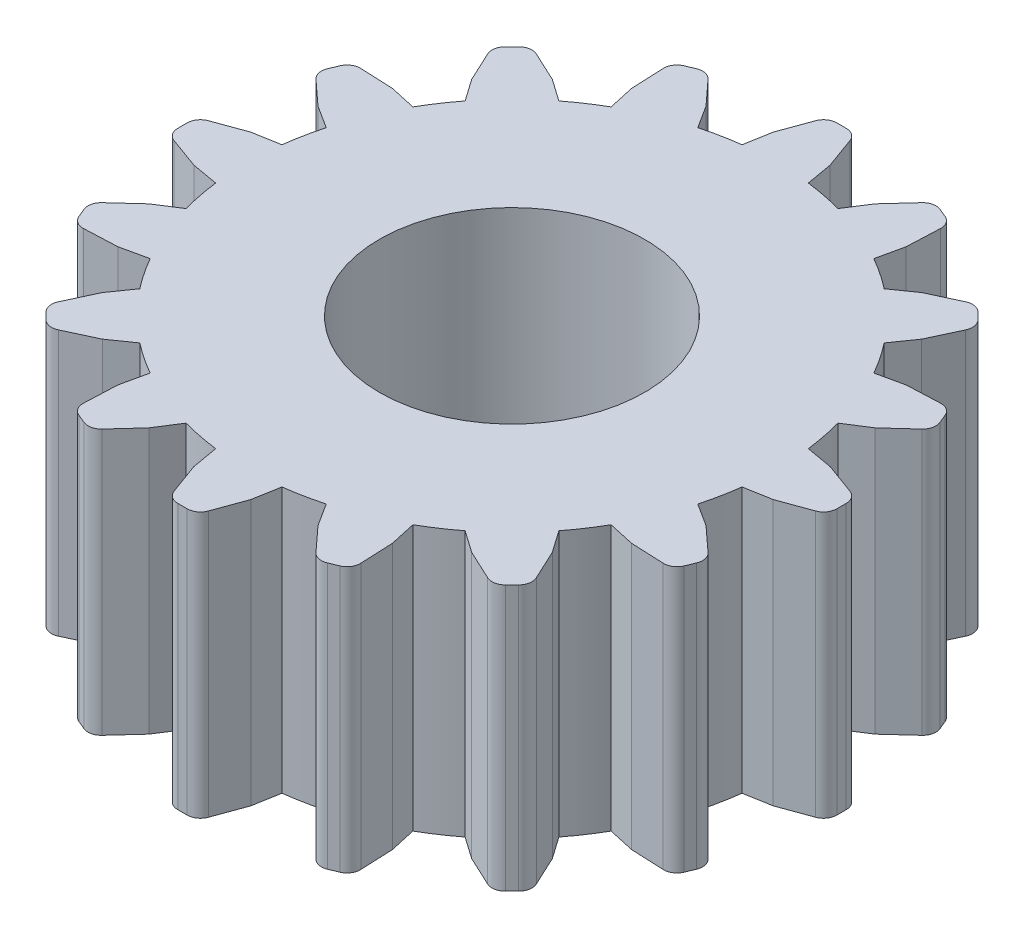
ISO-10303-21;
HEADER;
FILE_DESCRIPTION(('STEP AP214'),'2;1');
FILE_NAME('part.step','',(''),(''),'','','');
FILE_SCHEMA(('AUTOMOTIVE_DESIGN { 1 0 10303 214 1 1 1 1 }'));
ENDSEC;
DATA;
#1=APPLICATION_CONTEXT('core data for automotive mechanical design processes');
#2=APPLICATION_PROTOCOL_DEFINITION('international standard','automotive_design',2000,#1);
#3=PRODUCT_CONTEXT('',#1,'mechanical');
#4=PRODUCT('Part','Part','',(#3));
#5=PRODUCT_RELATED_PRODUCT_CATEGORY('part','',(#4));
#6=PRODUCT_DEFINITION_FORMATION('','',#4);
#7=PRODUCT_DEFINITION_CONTEXT('part definition',#1,'design');
#8=PRODUCT_DEFINITION('design','',#6,#7);
#9=PRODUCT_DEFINITION_SHAPE('','',#8);
#10=(LENGTH_UNIT() NAMED_UNIT(*) SI_UNIT(.MILLI.,.METRE.));
#11=(NAMED_UNIT(*) PLANE_ANGLE_UNIT() SI_UNIT($,.RADIAN.));
#12=(NAMED_UNIT(*) SI_UNIT($,.STERADIAN.) SOLID_ANGLE_UNIT());
#13=UNCERTAINTY_MEASURE_WITH_UNIT(LENGTH_MEASURE(1.E-05),#10,'distance_accuracy_value','');
#14=(GEOMETRIC_REPRESENTATION_CONTEXT(3) GLOBAL_UNCERTAINTY_ASSIGNED_CONTEXT((#13)) GLOBAL_UNIT_ASSIGNED_CONTEXT((#10,
#11,#12)) REPRESENTATION_CONTEXT('',''));
#15=CARTESIAN_POINT('',(0.,0.,0.));
#16=DIRECTION('',(0.,0.,1.));
#17=DIRECTION('',(1.,0.,0.));
#18=AXIS2_PLACEMENT_3D('',#15,#16,#17);
#19=CARTESIAN_POINT('',(0.,25.4,0.));
#20=DIRECTION('',(0.,-1.,0.));
#21=DIRECTION('',(0.,0.,-1.));
#22=AXIS2_PLACEMENT_3D('',#19,#20,#21);
#23=CYLINDRICAL_SURFACE('',#22,25.4);
#24=CARTESIAN_POINT('',(0.,25.4,0.));
#25=DIRECTION('',(0.,1.,0.));
#26=DIRECTION('',(0.,0.,1.));
#27=AXIS2_PLACEMENT_3D('',#24,#25,#26);
#28=CIRCLE('',#27,25.4);
#29=CARTESIAN_POINT('',(6.71060394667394,25.4,-24.4975058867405));
#30=VERTEX_POINT('',#29);
#31=CARTESIAN_POINT('',(3.175,25.4,-25.2007812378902));
#32=VERTEX_POINT('',#31);
#33=EDGE_CURVE('E851',#30,#32,#28,.T.);
#34=ORIENTED_EDGE('',*,*,#33,.F.);
#35=DIRECTION('',(0.,1.,0.));
#36=VECTOR('',#35,1.);
#37=CARTESIAN_POINT('',(6.71060394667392,0.,-24.4975058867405));
#38=LINE('',#37,#36);
#39=CARTESIAN_POINT('',(6.71060394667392,0.,-24.4975058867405));
#40=VERTEX_POINT('',#39);
#41=EDGE_CURVE('E839',#40,#30,#38,.T.);
#42=ORIENTED_EDGE('',*,*,#41,.F.);
#43=CARTESIAN_POINT('',(0.,0.,0.));
#44=DIRECTION('',(0.,1.,0.));
#45=DIRECTION('',(0.,0.,1.));
#46=AXIS2_PLACEMENT_3D('',#43,#44,#45);
#47=CIRCLE('',#46,25.4);
#48=CARTESIAN_POINT('',(3.175,0.,-25.2007812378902));
#49=VERTEX_POINT('',#48);
#50=EDGE_CURVE('E849',#40,#49,#47,.T.);
#51=ORIENTED_EDGE('',*,*,#50,.T.);
#52=DIRECTION('',(0.,1.,0.));
#53=VECTOR('',#52,1.);
#54=CARTESIAN_POINT('',(3.175,0.,-25.2007812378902));
#55=LINE('',#54,#53);
#56=EDGE_CURVE('E1499',#49,#32,#55,.T.);
#57=ORIENTED_EDGE('',*,*,#56,.T.);
#58=EDGE_LOOP('',(#34,#42,#51,#57));
#59=FACE_BOUND('',#58,.T.);
#60=ADVANCED_FACE('F49',(#59),#23,.T.);
#61=CARTESIAN_POINT('',(15.5745792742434,0.,-20.0647073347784));
#62=VERTEX_POINT('',#61);
#63=CARTESIAN_POINT('',(12.5772389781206,0.,-22.0674660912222));
#64=VERTEX_POINT('',#63);
#65=EDGE_CURVE('E861',#62,#64,#47,.T.);
#66=ORIENTED_EDGE('',*,*,#65,.T.);
#67=DIRECTION('',(0.,1.,0.));
#68=VECTOR('',#67,1.);
#69=CARTESIAN_POINT('',(12.5772389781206,0.,-22.0674660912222));
#70=LINE('',#69,#68);
#71=CARTESIAN_POINT('',(12.5772389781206,25.4,-22.0674660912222));
#72=VERTEX_POINT('',#71);
#73=EDGE_CURVE('E852',#64,#72,#70,.T.);
#74=ORIENTED_EDGE('',*,*,#73,.T.);
#75=CARTESIAN_POINT('',(15.5745792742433,25.4,-20.0647073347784));
#76=VERTEX_POINT('',#75);
#77=EDGE_CURVE('E878',#76,#72,#28,.T.);
#78=ORIENTED_EDGE('',*,*,#77,.F.);
#79=DIRECTION('',(0.,1.,0.));
#80=VECTOR('',#79,1.);
#81=CARTESIAN_POINT('',(15.5745792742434,0.,-20.0647073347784));
#82=LINE('',#81,#80);
#83=EDGE_CURVE('E983',#62,#76,#82,.T.);
#84=ORIENTED_EDGE('',*,*,#83,.F.);
#85=EDGE_LOOP('',(#66,#74,#78,#84));
#86=FACE_BOUND('',#85,.T.);
#87=ADVANCED_FACE('F1558',(#86),#23,.T.);
#88=CARTESIAN_POINT('',(22.0674660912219,0.,-12.5772389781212));
#89=VERTEX_POINT('',#88);
#90=CARTESIAN_POINT('',(20.064707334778,0.,-15.5745792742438));
#91=VERTEX_POINT('',#90);
#92=EDGE_CURVE('E866',#89,#91,#47,.T.);
#93=ORIENTED_EDGE('',*,*,#92,.T.);
#94=DIRECTION('',(0.,1.,0.));
#95=VECTOR('',#94,1.);
#96=CARTESIAN_POINT('',(20.064707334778,0.,-15.5745792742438));
#97=LINE('',#96,#95);
#98=CARTESIAN_POINT('',(20.064707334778,25.4,-15.5745792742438));
#99=VERTEX_POINT('',#98);
#100=EDGE_CURVE('E958',#91,#99,#97,.T.);
#101=ORIENTED_EDGE('',*,*,#100,.T.);
#102=CARTESIAN_POINT('',(22.0674660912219,25.4,-12.5772389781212));
#103=VERTEX_POINT('',#102);
#104=EDGE_CURVE('E1545',#103,#99,#28,.T.);
#105=ORIENTED_EDGE('',*,*,#104,.F.);
#106=DIRECTION('',(0.,1.,0.));
#107=VECTOR('',#106,1.);
#108=CARTESIAN_POINT('',(22.0674660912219,0.,-12.5772389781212));
#109=LINE('',#108,#107);
#110=EDGE_CURVE('E961',#89,#103,#109,.T.);
#111=ORIENTED_EDGE('',*,*,#110,.F.);
#112=EDGE_LOOP('',(#93,#101,#105,#111));
#113=FACE_BOUND('',#112,.T.);
#114=ADVANCED_FACE('F956',(#113),#23,.T.);
#115=CARTESIAN_POINT('',(25.2007812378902,0.,-3.17500000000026));
#116=VERTEX_POINT('',#115);
#117=CARTESIAN_POINT('',(24.4975058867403,0.,-6.71060394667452));
#118=VERTEX_POINT('',#117);
#119=EDGE_CURVE('E941',#116,#118,#47,.T.);
#120=ORIENTED_EDGE('',*,*,#119,.T.);
#121=DIRECTION('',(0.,1.,0.));
#122=VECTOR('',#121,1.);
#123=CARTESIAN_POINT('',(24.4975058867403,0.,-6.71060394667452));
#124=LINE('',#123,#122);
#125=CARTESIAN_POINT('',(24.4975058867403,25.4,-6.71060394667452));
#126=VERTEX_POINT('',#125);
#127=EDGE_CURVE('E1035',#118,#126,#124,.T.);
#128=ORIENTED_EDGE('',*,*,#127,.T.);
#129=CARTESIAN_POINT('',(25.2007812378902,25.4,-3.17500000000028));
#130=VERTEX_POINT('',#129);
#131=EDGE_CURVE('E1542',#130,#126,#28,.T.);
#132=ORIENTED_EDGE('',*,*,#131,.F.);
#133=DIRECTION('',(0.,1.,0.));
#134=VECTOR('',#133,1.);
#135=CARTESIAN_POINT('',(25.2007812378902,0.,-3.17500000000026));
#136=LINE('',#135,#134);
#137=EDGE_CURVE('E1052',#116,#130,#136,.T.);
#138=ORIENTED_EDGE('',*,*,#137,.F.);
#139=EDGE_LOOP('',(#120,#128,#132,#138));
#140=FACE_BOUND('',#139,.T.);
#141=ADVANCED_FACE('F1683',(#140),#23,.T.);
#142=CARTESIAN_POINT('',(24.4975058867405,0.,6.71060394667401));
#143=VERTEX_POINT('',#142);
#144=CARTESIAN_POINT('',(25.2007812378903,0.,3.17499999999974));
#145=VERTEX_POINT('',#144);
#146=EDGE_CURVE('E935',#143,#145,#47,.T.);
#147=ORIENTED_EDGE('',*,*,#146,.T.);
#148=DIRECTION('',(0.,1.,0.));
#149=VECTOR('',#148,1.);
#150=CARTESIAN_POINT('',(25.2007812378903,0.,3.17499999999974));
#151=LINE('',#150,#149);
#152=CARTESIAN_POINT('',(25.2007812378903,25.4,3.17499999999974));
#153=VERTEX_POINT('',#152);
#154=EDGE_CURVE('E1070',#145,#153,#151,.T.);
#155=ORIENTED_EDGE('',*,*,#154,.T.);
#156=CARTESIAN_POINT('',(24.4975058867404,25.4,6.71060394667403));
#157=VERTEX_POINT('',#156);
#158=EDGE_CURVE('E1539',#157,#153,#28,.T.);
#159=ORIENTED_EDGE('',*,*,#158,.F.);
#160=DIRECTION('',(0.,1.,0.));
#161=VECTOR('',#160,1.);
#162=CARTESIAN_POINT('',(24.4975058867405,0.,6.71060394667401));
#163=LINE('',#162,#161);
#164=EDGE_CURVE('E1088',#143,#157,#163,.T.);
#165=ORIENTED_EDGE('',*,*,#164,.F.);
#166=EDGE_LOOP('',(#147,#155,#159,#165));
#167=FACE_BOUND('',#166,.T.);
#168=ADVANCED_FACE('F1679',(#167),#23,.T.);
#169=CARTESIAN_POINT('',(20.0647073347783,0.,15.5745792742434));
#170=VERTEX_POINT('',#169);
#171=CARTESIAN_POINT('',(22.0674660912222,0.,12.5772389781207));
#172=VERTEX_POINT('',#171);
#173=EDGE_CURVE('E929',#170,#172,#47,.T.);
#174=ORIENTED_EDGE('',*,*,#173,.T.);
#175=DIRECTION('',(0.,1.,0.));
#176=VECTOR('',#175,1.);
#177=CARTESIAN_POINT('',(22.0674660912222,0.,12.5772389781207));
#178=LINE('',#177,#176);
#179=CARTESIAN_POINT('',(22.0674660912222,25.4,12.5772389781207));
#180=VERTEX_POINT('',#179);
#181=EDGE_CURVE('E1106',#172,#180,#178,.T.);
#182=ORIENTED_EDGE('',*,*,#181,.T.);
#183=CARTESIAN_POINT('',(20.0647073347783,25.4,15.5745792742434));
#184=VERTEX_POINT('',#183);
#185=EDGE_CURVE('E1536',#184,#180,#28,.T.);
#186=ORIENTED_EDGE('',*,*,#185,.F.);
#187=DIRECTION('',(0.,1.,0.));
#188=VECTOR('',#187,1.);
#189=CARTESIAN_POINT('',(20.0647073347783,0.,15.5745792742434));
#190=LINE('',#189,#188);
#191=EDGE_CURVE('E1124',#170,#184,#190,.T.);
#192=ORIENTED_EDGE('',*,*,#191,.F.);
#193=EDGE_LOOP('',(#174,#182,#186,#192));
#194=FACE_BOUND('',#193,.T.);
#195=ADVANCED_FACE('F1675',(#194),#23,.T.);
#196=CARTESIAN_POINT('',(12.5772389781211,0.,22.067466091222));
#197=VERTEX_POINT('',#196);
#198=CARTESIAN_POINT('',(15.5745792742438,0.,20.064707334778));
#199=VERTEX_POINT('',#198);
#200=EDGE_CURVE('E923',#197,#199,#47,.T.);
#201=ORIENTED_EDGE('',*,*,#200,.T.);
#202=DIRECTION('',(0.,1.,0.));
#203=VECTOR('',#202,1.);
#204=CARTESIAN_POINT('',(15.5745792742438,0.,20.064707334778));
#205=LINE('',#204,#203);
#206=CARTESIAN_POINT('',(15.5745792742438,25.4,20.064707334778));
#207=VERTEX_POINT('',#206);
#208=EDGE_CURVE('E1142',#199,#207,#205,.T.);
#209=ORIENTED_EDGE('',*,*,#208,.T.);
#210=CARTESIAN_POINT('',(12.5772389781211,25.4,22.067466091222));
#211=VERTEX_POINT('',#210);
#212=EDGE_CURVE('E1533',#211,#207,#28,.T.);
#213=ORIENTED_EDGE('',*,*,#212,.F.);
#214=DIRECTION('',(0.,1.,0.));
#215=VECTOR('',#214,1.);
#216=CARTESIAN_POINT('',(12.5772389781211,0.,22.067466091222));
#217=LINE('',#216,#215);
#218=EDGE_CURVE('E1160',#197,#211,#217,.T.);
#219=ORIENTED_EDGE('',*,*,#218,.F.);
#220=EDGE_LOOP('',(#201,#209,#213,#219));
#221=FACE_BOUND('',#220,.T.);
#222=ADVANCED_FACE('F1671',(#221),#23,.T.);
#223=CARTESIAN_POINT('',(3.175,0.,25.2007812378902));
#224=VERTEX_POINT('',#223);
#225=CARTESIAN_POINT('',(6.71060394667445,0.,24.4975058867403));
#226=VERTEX_POINT('',#225);
#227=EDGE_CURVE('E917',#224,#226,#47,.T.);
#228=ORIENTED_EDGE('',*,*,#227,.T.);
#229=DIRECTION('',(0.,1.,0.));
#230=VECTOR('',#229,1.);
#231=CARTESIAN_POINT('',(6.71060394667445,0.,24.4975058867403));
#232=LINE('',#231,#230);
#233=CARTESIAN_POINT('',(6.71060394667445,25.4,24.4975058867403));
#234=VERTEX_POINT('',#233);
#235=EDGE_CURVE('E1178',#226,#234,#232,.T.);
#236=ORIENTED_EDGE('',*,*,#235,.T.);
#237=CARTESIAN_POINT('',(3.17500000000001,25.4,25.2007812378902));
#238=VERTEX_POINT('',#237);
#239=EDGE_CURVE('E1530',#238,#234,#28,.T.);
#240=ORIENTED_EDGE('',*,*,#239,.F.);
#241=DIRECTION('',(0.,1.,0.));
#242=VECTOR('',#241,1.);
#243=CARTESIAN_POINT('',(3.175,0.,25.2007812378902));
#244=LINE('',#243,#242);
#245=EDGE_CURVE('E1196',#224,#238,#244,.T.);
#246=ORIENTED_EDGE('',*,*,#245,.F.);
#247=EDGE_LOOP('',(#228,#236,#240,#246));
#248=FACE_BOUND('',#247,.T.);
#249=ADVANCED_FACE('F1667',(#248),#23,.T.);
#250=CARTESIAN_POINT('',(-6.7106039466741,0.,24.4975058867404));
#251=VERTEX_POINT('',#250);
#252=CARTESIAN_POINT('',(-3.175,0.,25.2007812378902));
#253=VERTEX_POINT('',#252);
#254=EDGE_CURVE('E911',#251,#253,#47,.T.);
#255=ORIENTED_EDGE('',*,*,#254,.T.);
#256=DIRECTION('',(0.,1.,0.));
#257=VECTOR('',#256,1.);
#258=CARTESIAN_POINT('',(-3.175,0.,25.2007812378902));
#259=LINE('',#258,#257);
#260=CARTESIAN_POINT('',(-3.175,25.4,25.2007812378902));
#261=VERTEX_POINT('',#260);
#262=EDGE_CURVE('E1214',#253,#261,#259,.T.);
#263=ORIENTED_EDGE('',*,*,#262,.T.);
#264=CARTESIAN_POINT('',(-6.71060394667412,25.4,24.4975058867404));
#265=VERTEX_POINT('',#264);
#266=EDGE_CURVE('E1527',#265,#261,#28,.T.);
#267=ORIENTED_EDGE('',*,*,#266,.F.);
#268=DIRECTION('',(0.,1.,0.));
#269=VECTOR('',#268,1.);
#270=CARTESIAN_POINT('',(-6.7106039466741,0.,24.4975058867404));
#271=LINE('',#270,#269);
#272=EDGE_CURVE('E1232',#251,#265,#271,.T.);
#273=ORIENTED_EDGE('',*,*,#272,.F.);
#274=EDGE_LOOP('',(#255,#263,#267,#273));
#275=FACE_BOUND('',#274,.T.);
#276=ADVANCED_FACE('F1663',(#275),#23,.T.);
#277=CARTESIAN_POINT('',(-15.5745792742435,0.,20.0647073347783));
#278=VERTEX_POINT('',#277);
#279=CARTESIAN_POINT('',(-12.5772389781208,0.,22.0674660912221));
#280=VERTEX_POINT('',#279);
#281=EDGE_CURVE('E905',#278,#280,#47,.T.);
#282=ORIENTED_EDGE('',*,*,#281,.T.);
#283=DIRECTION('',(0.,1.,0.));
#284=VECTOR('',#283,1.);
#285=CARTESIAN_POINT('',(-12.5772389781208,0.,22.0674660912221));
#286=LINE('',#285,#284);
#287=CARTESIAN_POINT('',(-12.5772389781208,25.4,22.0674660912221));
#288=VERTEX_POINT('',#287);
#289=EDGE_CURVE('E1250',#280,#288,#286,.T.);
#290=ORIENTED_EDGE('',*,*,#289,.T.);
#291=CARTESIAN_POINT('',(-15.5745792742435,25.4,20.0647073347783));
#292=VERTEX_POINT('',#291);
#293=EDGE_CURVE('E1524',#292,#288,#28,.T.);
#294=ORIENTED_EDGE('',*,*,#293,.F.);
#295=DIRECTION('',(0.,1.,0.));
#296=VECTOR('',#295,1.);
#297=CARTESIAN_POINT('',(-15.5745792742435,0.,20.0647073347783));
#298=LINE('',#297,#296);
#299=EDGE_CURVE('E1268',#278,#292,#298,.T.);
#300=ORIENTED_EDGE('',*,*,#299,.F.);
#301=EDGE_LOOP('',(#282,#290,#294,#300));
#302=FACE_BOUND('',#301,.T.);
#303=ADVANCED_FACE('F1659',(#302),#23,.T.);
#304=CARTESIAN_POINT('',(-22.067466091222,0.,12.577238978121));
#305=VERTEX_POINT('',#304);
#306=CARTESIAN_POINT('',(-20.0647073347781,0.,15.5745792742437));
#307=VERTEX_POINT('',#306);
#308=EDGE_CURVE('E899',#305,#307,#47,.T.);
#309=ORIENTED_EDGE('',*,*,#308,.T.);
#310=DIRECTION('',(0.,1.,0.));
#311=VECTOR('',#310,1.);
#312=CARTESIAN_POINT('',(-20.0647073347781,0.,15.5745792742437));
#313=LINE('',#312,#311);
#314=CARTESIAN_POINT('',(-20.0647073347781,25.4,15.5745792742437));
#315=VERTEX_POINT('',#314);
#316=EDGE_CURVE('E1286',#307,#315,#313,.T.);
#317=ORIENTED_EDGE('',*,*,#316,.T.);
#318=CARTESIAN_POINT('',(-22.0674660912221,25.4,12.577238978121));
#319=VERTEX_POINT('',#318);
#320=EDGE_CURVE('E1521',#319,#315,#28,.T.);
#321=ORIENTED_EDGE('',*,*,#320,.F.);
#322=DIRECTION('',(0.,1.,0.));
#323=VECTOR('',#322,1.);
#324=CARTESIAN_POINT('',(-22.067466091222,0.,12.577238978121));
#325=LINE('',#324,#323);
#326=EDGE_CURVE('E1304',#305,#319,#325,.T.);
#327=ORIENTED_EDGE('',*,*,#326,.F.);
#328=EDGE_LOOP('',(#309,#317,#321,#327));
#329=FACE_BOUND('',#328,.T.);
#330=ADVANCED_FACE('F1655',(#329),#23,.T.);
#331=CARTESIAN_POINT('',(-25.2007812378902,0.,3.17500000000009));
#332=VERTEX_POINT('',#331);
#333=CARTESIAN_POINT('',(-24.4975058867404,0.,6.71060394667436));
#334=VERTEX_POINT('',#333);
#335=EDGE_CURVE('E893',#332,#334,#47,.T.);
#336=ORIENTED_EDGE('',*,*,#335,.T.);
#337=DIRECTION('',(0.,1.,0.));
#338=VECTOR('',#337,1.);
#339=CARTESIAN_POINT('',(-24.4975058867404,0.,6.71060394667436));
#340=LINE('',#339,#338);
#341=CARTESIAN_POINT('',(-24.4975058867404,25.4,6.71060394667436));
#342=VERTEX_POINT('',#341);
#343=EDGE_CURVE('E1322',#334,#342,#340,.T.);
#344=ORIENTED_EDGE('',*,*,#343,.T.);
#345=CARTESIAN_POINT('',(-25.2007812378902,25.4,3.1750000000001));
#346=VERTEX_POINT('',#345);
#347=EDGE_CURVE('E1518',#346,#342,#28,.T.);
#348=ORIENTED_EDGE('',*,*,#347,.F.);
#349=DIRECTION('',(0.,1.,0.));
#350=VECTOR('',#349,1.);
#351=CARTESIAN_POINT('',(-25.2007812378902,0.,3.17500000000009));
#352=LINE('',#351,#350);
#353=EDGE_CURVE('E1340',#332,#346,#352,.T.);
#354=ORIENTED_EDGE('',*,*,#353,.F.);
#355=EDGE_LOOP('',(#336,#344,#348,#354));
#356=FACE_BOUND('',#355,.T.);
#357=ADVANCED_FACE('F1651',(#356),#23,.T.);
#358=CARTESIAN_POINT('',(-24.4975058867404,0.,-6.71060394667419));
#359=VERTEX_POINT('',#358);
#360=CARTESIAN_POINT('',(-25.2007812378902,0.,-3.17499999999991));
#361=VERTEX_POINT('',#360);
#362=EDGE_CURVE('E887',#359,#361,#47,.T.);
#363=ORIENTED_EDGE('',*,*,#362,.T.);
#364=DIRECTION('',(0.,1.,0.));
#365=VECTOR('',#364,1.);
#366=CARTESIAN_POINT('',(-25.2007812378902,0.,-3.17499999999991));
#367=LINE('',#366,#365);
#368=CARTESIAN_POINT('',(-25.2007812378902,25.4,-3.17499999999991));
#369=VERTEX_POINT('',#368);
#370=EDGE_CURVE('E1358',#361,#369,#367,.T.);
#371=ORIENTED_EDGE('',*,*,#370,.T.);
#372=CARTESIAN_POINT('',(-24.4975058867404,25.4,-6.71060394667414));
#373=VERTEX_POINT('',#372);
#374=EDGE_CURVE('E1515',#373,#369,#28,.T.);
#375=ORIENTED_EDGE('',*,*,#374,.F.);
#376=DIRECTION('',(0.,1.,0.));
#377=VECTOR('',#376,1.);
#378=CARTESIAN_POINT('',(-24.4975058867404,0.,-6.71060394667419));
#379=LINE('',#378,#377);
#380=EDGE_CURVE('E1376',#359,#373,#379,.T.);
#381=ORIENTED_EDGE('',*,*,#380,.F.);
#382=EDGE_LOOP('',(#363,#371,#375,#381));
#383=FACE_BOUND('',#382,.T.);
#384=ADVANCED_FACE('F1647',(#383),#23,.T.);
#385=CARTESIAN_POINT('',(-20.0647073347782,0.,-15.5745792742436));
#386=VERTEX_POINT('',#385);
#387=CARTESIAN_POINT('',(-22.0674660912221,0.,-12.5772389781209));
#388=VERTEX_POINT('',#387);
#389=EDGE_CURVE('E881',#386,#388,#47,.T.);
#390=ORIENTED_EDGE('',*,*,#389,.T.);
#391=DIRECTION('',(0.,1.,0.));
#392=VECTOR('',#391,1.);
#393=CARTESIAN_POINT('',(-22.0674660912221,0.,-12.5772389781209));
#394=LINE('',#393,#392);
#395=CARTESIAN_POINT('',(-22.0674660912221,25.4,-12.5772389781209));
#396=VERTEX_POINT('',#395);
#397=EDGE_CURVE('E1394',#388,#396,#394,.T.);
#398=ORIENTED_EDGE('',*,*,#397,.T.);
#399=CARTESIAN_POINT('',(-20.0647073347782,25.4,-15.5745792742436));
#400=VERTEX_POINT('',#399);
#401=EDGE_CURVE('E1512',#400,#396,#28,.T.);
#402=ORIENTED_EDGE('',*,*,#401,.F.);
#403=DIRECTION('',(0.,1.,0.));
#404=VECTOR('',#403,1.);
#405=CARTESIAN_POINT('',(-20.0647073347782,0.,-15.5745792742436));
#406=LINE('',#405,#404);
#407=EDGE_CURVE('E1412',#386,#400,#406,.T.);
#408=ORIENTED_EDGE('',*,*,#407,.F.);
#409=EDGE_LOOP('',(#390,#398,#402,#408));
#410=FACE_BOUND('',#409,.T.);
#411=ADVANCED_FACE('F1641',(#410),#23,.T.);
#412=CARTESIAN_POINT('',(-12.5772389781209,0.,-22.0674660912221));
#413=VERTEX_POINT('',#412);
#414=CARTESIAN_POINT('',(-15.5745792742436,0.,-20.0647073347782));
#415=VERTEX_POINT('',#414);
#416=EDGE_CURVE('E873',#413,#415,#47,.T.);
#417=ORIENTED_EDGE('',*,*,#416,.T.);
#418=DIRECTION('',(0.,1.,0.));
#419=VECTOR('',#418,1.);
#420=CARTESIAN_POINT('',(-15.5745792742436,0.,-20.0647073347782));
#421=LINE('',#420,#419);
#422=CARTESIAN_POINT('',(-15.5745792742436,25.4,-20.0647073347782));
#423=VERTEX_POINT('',#422);
#424=EDGE_CURVE('E1430',#415,#423,#421,.T.);
#425=ORIENTED_EDGE('',*,*,#424,.T.);
#426=CARTESIAN_POINT('',(-12.5772389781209,25.4,-22.0674660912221));
#427=VERTEX_POINT('',#426);
#428=EDGE_CURVE('E1506',#427,#423,#28,.T.);
#429=ORIENTED_EDGE('',*,*,#428,.F.);
#430=DIRECTION('',(0.,1.,0.));
#431=VECTOR('',#430,1.);
#432=CARTESIAN_POINT('',(-12.5772389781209,0.,-22.0674660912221));
#433=LINE('',#432,#431);
#434=EDGE_CURVE('E1448',#413,#427,#433,.T.);
#435=ORIENTED_EDGE('',*,*,#434,.F.);
#436=EDGE_LOOP('',(#417,#425,#429,#435));
#437=FACE_BOUND('',#436,.T.);
#438=ADVANCED_FACE('F1632',(#437),#23,.T.);
#439=CARTESIAN_POINT('',(0.,25.4,0.));
#440=DIRECTION('',(0.,1.,0.));
#441=DIRECTION('',(0.,0.,1.));
#442=AXIS2_PLACEMENT_3D('',#439,#440,#441);
#443=PLANE('',#442);
#444=DIRECTION('',(0.0436193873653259,0.,-0.999048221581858));
#445=VECTOR('',#444,1.);
#446=CARTESIAN_POINT('',(13.1354764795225,25.4,-24.585512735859));
#447=LINE('',#446,#445);
#448=CARTESIAN_POINT('',(13.1354764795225,25.4,-24.585512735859));
#449=VERTEX_POINT('',#448);
#450=CARTESIAN_POINT('',(13.2735429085,25.4,-27.7477538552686));
#451=VERTEX_POINT('',#450);
#452=EDGE_CURVE('E1572',#449,#451,#447,.T.);
#453=ORIENTED_EDGE('',*,*,#452,.T.);
#454=CARTESIAN_POINT('',(12.004751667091,25.4,-27.8031504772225));
#455=DIRECTION('',(0.,1.,0.));
#456=DIRECTION('',(0.,0.,1.));
#457=AXIS2_PLACEMENT_3D('',#454,#455,#456);
#458=CIRCLE('',#457,1.27);
#459=CARTESIAN_POINT('',(12.4907596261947,25.4,-28.9764774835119));
#460=VERTEX_POINT('',#459);
#461=EDGE_CURVE('E1596',#451,#460,#458,.T.);
#462=ORIENTED_EDGE('',*,*,#461,.T.);
#463=DIRECTION('',(-0.923879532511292,0.,-0.382683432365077));
#464=VECTOR('',#463,1.);
#465=CARTESIAN_POINT('',(13.3123320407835,25.4,-28.6361710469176));
#466=LINE('',#465,#464);
#467=CARTESIAN_POINT('',(11.6571628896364,25.4,-29.3217645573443));
#468=VERTEX_POINT('',#467);
#469=EDGE_CURVE('E1569',#460,#468,#466,.T.);
#470=ORIENTED_EDGE('',*,*,#469,.T.);
#471=CARTESIAN_POINT('',(11.1711549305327,25.4,-28.1484375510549));
#472=DIRECTION('',(0.,1.,0.));
#473=DIRECTION('',(0.,0.,1.));
#474=AXIS2_PLACEMENT_3D('',#471,#472,#473);
#475=CIRCLE('',#474,1.27);
#476=CARTESIAN_POINT('',(10.2348127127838,25.4,-29.0064371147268));
#477=VERTEX_POINT('',#476);
#478=EDGE_CURVE('E1597',#468,#477,#475,.T.);
#479=ORIENTED_EDGE('',*,*,#478,.T.);
#480=DIRECTION('',(-0.675590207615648,0.,0.737277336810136));
#481=VECTOR('',#480,1.);
#482=CARTESIAN_POINT('',(10.8355904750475,25.4,-29.6620709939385));
#483=LINE('',#482,#481);
#484=CARTESIAN_POINT('',(8.09639828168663,25.4,-26.6727672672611));
#485=VERTEX_POINT('',#484);
#486=EDGE_CURVE('E845',#477,#485,#483,.T.);
#487=ORIENTED_EDGE('',*,*,#486,.T.);
#488=DIRECTION('',(-0.537299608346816,0.,0.843391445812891));
#489=VECTOR('',#488,1.);
#490=CARTESIAN_POINT('',(8.09639828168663,25.4,-26.6727672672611));
#491=LINE('',#490,#489);
#492=EDGE_CURVE('E1575',#485,#30,#491,.T.);
#493=ORIENTED_EDGE('',*,*,#492,.T.);
#494=ORIENTED_EDGE('',*,*,#33,.T.);
#495=DIRECTION('',(-0.173648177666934,0.,-0.984807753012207));
#496=VECTOR('',#495,1.);
#497=CARTESIAN_POINT('',(3.175,25.4,-25.2007812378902));
#498=LINE('',#497,#496);
#499=CARTESIAN_POINT('',(2.72712946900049,25.4,-27.7407812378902));
#500=VERTEX_POINT('',#499);
#501=EDGE_CURVE('E1484',#32,#500,#498,.T.);
#502=ORIENTED_EDGE('',*,*,#501,.T.);
#503=DIRECTION('',(-0.342020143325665,0.,-0.93969262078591));
#504=VECTOR('',#503,1.);
#505=CARTESIAN_POINT('',(2.72712946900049,25.4,-27.7407812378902));
#506=LINE('',#505,#504);
#507=CARTESIAN_POINT('',(1.64454893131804,25.4,-30.7151468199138));
#508=VERTEX_POINT('',#507);
#509=EDGE_CURVE('E1487',#500,#508,#506,.T.);
#510=ORIENTED_EDGE('',*,*,#509,.T.);
#511=CARTESIAN_POINT('',(0.451139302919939,25.4,-30.2807812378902));
#512=DIRECTION('',(0.,1.,0.));
#513=DIRECTION('',(0.,0.,1.));
#514=AXIS2_PLACEMENT_3D('',#511,#512,#513);
#515=CIRCLE('',#514,1.27);
#516=CARTESIAN_POINT('',(0.451139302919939,25.4,-31.5507812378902));
#517=VERTEX_POINT('',#516);
#518=EDGE_CURVE('E3127',#508,#517,#515,.T.);
#519=ORIENTED_EDGE('',*,*,#518,.T.);
#520=DIRECTION('',(-1.,0.,0.));
#521=VECTOR('',#520,1.);
#522=CARTESIAN_POINT('',(1.34040287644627,25.4,-31.5507812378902));
#523=LINE('',#522,#521);
#524=CARTESIAN_POINT('',(-0.451139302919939,25.4,-31.5507812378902));
#525=VERTEX_POINT('',#524);
#526=EDGE_CURVE('E1490',#517,#525,#523,.T.);
#527=ORIENTED_EDGE('',*,*,#526,.T.);
#528=CARTESIAN_POINT('',(-0.451139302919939,25.4,-30.2807812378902));
#529=DIRECTION('',(0.,1.,0.));
#530=DIRECTION('',(0.,0.,1.));
#531=AXIS2_PLACEMENT_3D('',#528,#529,#530);
#532=CIRCLE('',#531,1.27);
#533=CARTESIAN_POINT('',(-1.64454893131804,25.4,-30.7151468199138));
#534=VERTEX_POINT('',#533);
#535=EDGE_CURVE('E1510',#525,#534,#532,.T.);
#536=ORIENTED_EDGE('',*,*,#535,.T.);
#537=DIRECTION('',(-0.342020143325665,0.,0.93969262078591));
#538=VECTOR('',#537,1.);
#539=CARTESIAN_POINT('',(-1.34040287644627,25.4,-31.5507812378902));
#540=LINE('',#539,#538);
#541=CARTESIAN_POINT('',(-2.72712946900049,25.4,-27.7407812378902));
#542=VERTEX_POINT('',#541);
#543=EDGE_CURVE('E1472',#534,#542,#540,.T.);
#544=ORIENTED_EDGE('',*,*,#543,.T.);
#545=DIRECTION('',(-0.173648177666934,0.,0.984807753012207));
#546=VECTOR('',#545,1.);
#547=CARTESIAN_POINT('',(-2.72712946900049,25.4,-27.7407812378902));
#548=LINE('',#547,#546);
#549=CARTESIAN_POINT('',(-3.17500000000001,25.4,-25.2007812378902));
#550=VERTEX_POINT('',#549);
#551=EDGE_CURVE('E1463',#542,#550,#548,.T.);
#552=ORIENTED_EDGE('',*,*,#551,.T.);
#553=CARTESIAN_POINT('',(-6.71060394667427,25.4,-24.4975058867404));
#554=VERTEX_POINT('',#553);
#555=EDGE_CURVE('E879',#550,#554,#28,.T.);
#556=ORIENTED_EDGE('',*,*,#555,.T.);
#557=DIRECTION('',(-0.537299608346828,0.,-0.843391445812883));
#558=VECTOR('',#557,1.);
#559=CARTESIAN_POINT('',(-6.71060394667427,25.4,-24.4975058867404));
#560=LINE('',#559,#558);
#561=CARTESIAN_POINT('',(-8.09639828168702,25.4,-26.672767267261));
#562=VERTEX_POINT('',#561);
#563=EDGE_CURVE('E1450',#554,#562,#560,.T.);
#564=ORIENTED_EDGE('',*,*,#563,.T.);
#565=DIRECTION('',(-0.675590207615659,0.,-0.737277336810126));
#566=VECTOR('',#565,1.);
#567=CARTESIAN_POINT('',(-8.09639828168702,25.4,-26.672767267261));
#568=LINE('',#567,#566);
#569=CARTESIAN_POINT('',(-10.2348127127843,25.4,-29.0064371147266));
#570=VERTEX_POINT('',#569);
#571=EDGE_CURVE('E1453',#562,#570,#568,.T.);
#572=ORIENTED_EDGE('',*,*,#571,.T.);
#573=CARTESIAN_POINT('',(-11.1711549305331,25.4,-28.1484375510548));
#574=DIRECTION('',(0.,1.,0.));
#575=DIRECTION('',(0.,0.,1.));
#576=AXIS2_PLACEMENT_3D('',#573,#574,#575);
#577=CIRCLE('',#576,1.27);
#578=CARTESIAN_POINT('',(-11.6571628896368,25.4,-29.3217645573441));
#579=VERTEX_POINT('',#578);
#580=EDGE_CURVE('E2653',#570,#579,#577,.T.);
#581=ORIENTED_EDGE('',*,*,#580,.T.);
#582=DIRECTION('',(-0.923879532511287,0.,0.382683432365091));
#583=VECTOR('',#582,1.);
#584=CARTESIAN_POINT('',(-10.835590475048,25.4,-29.6620709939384));
#585=LINE('',#584,#583);
#586=CARTESIAN_POINT('',(-12.4907596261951,25.4,-28.9764774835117));
#587=VERTEX_POINT('',#586);
#588=EDGE_CURVE('E1456',#579,#587,#585,.T.);
#589=ORIENTED_EDGE('',*,*,#588,.T.);
#590=CARTESIAN_POINT('',(-12.0047516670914,25.4,-27.8031504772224));
#591=DIRECTION('',(0.,1.,0.));
#592=DIRECTION('',(0.,0.,1.));
#593=AXIS2_PLACEMENT_3D('',#590,#591,#592);
#594=CIRCLE('',#593,1.27);
#595=CARTESIAN_POINT('',(-13.2735429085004,25.4,-27.7477538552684));
#596=VERTEX_POINT('',#595);
#597=EDGE_CURVE('E2651',#587,#596,#594,.T.);
#598=ORIENTED_EDGE('',*,*,#597,.T.);
#599=DIRECTION('',(0.0436193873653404,0.,0.999048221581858));
#600=VECTOR('',#599,1.);
#601=CARTESIAN_POINT('',(-13.3123320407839,25.4,-28.6361710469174));
#602=LINE('',#601,#600);
#603=CARTESIAN_POINT('',(-13.1354764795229,25.4,-24.5855127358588));
#604=VERTEX_POINT('',#603);
#605=EDGE_CURVE('E1437',#596,#604,#602,.T.);
#606=ORIENTED_EDGE('',*,*,#605,.T.);
#607=DIRECTION('',(0.2164396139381,0.,0.976296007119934));
#608=VECTOR('',#607,1.);
#609=CARTESIAN_POINT('',(-13.1354764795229,25.4,-24.5855127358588));
#610=LINE('',#609,#608);
#611=EDGE_CURVE('E1427',#604,#427,#610,.T.);
#612=ORIENTED_EDGE('',*,*,#611,.T.);
#613=ORIENTED_EDGE('',*,*,#428,.T.);
#614=DIRECTION('',(-0.819152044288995,0.,-0.573576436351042));
#615=VECTOR('',#614,1.);
#616=CARTESIAN_POINT('',(-15.5745792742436,25.4,-20.0647073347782));
#617=LINE('',#616,#615);
#618=CARTESIAN_POINT('',(-17.6873227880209,25.4,-21.5440662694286));
#619=VERTEX_POINT('',#618);
#620=EDGE_CURVE('E1414',#423,#619,#617,.T.);
#621=ORIENTED_EDGE('',*,*,#620,.T.);
#622=DIRECTION('',(-0.906307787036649,0.,-0.422618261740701));
#623=VECTOR('',#622,1.);
#624=CARTESIAN_POINT('',(-17.6873227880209,25.4,-21.5440662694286));
#625=LINE('',#624,#623);
#626=CARTESIAN_POINT('',(-20.5560169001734,25.4,-22.8817603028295));
#627=VERTEX_POINT('',#626);
#628=EDGE_CURVE('E1417',#619,#627,#625,.T.);
#629=ORIENTED_EDGE('',*,*,#628,.T.);
#630=CARTESIAN_POINT('',(-21.0927420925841,25.4,-21.730749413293));
#631=DIRECTION('',(0.,1.,0.));
#632=DIRECTION('',(0.,0.,1.));
#633=AXIS2_PLACEMENT_3D('',#630,#631,#632);
#634=CIRCLE('',#633,1.27);
#635=CARTESIAN_POINT('',(-21.9907677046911,25.4,-22.6287750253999));
#636=VERTEX_POINT('',#635);
#637=EDGE_CURVE('E2671',#627,#636,#634,.T.);
#638=ORIENTED_EDGE('',*,*,#637,.T.);
#639=DIRECTION('',(-0.707106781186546,0.,0.707106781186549));
#640=VECTOR('',#639,1.);
#641=CARTESIAN_POINT('',(-21.3619634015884,25.4,-23.2575793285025));
#642=LINE('',#641,#640);
#643=CARTESIAN_POINT('',(-22.6287750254,25.4,-21.990767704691));
#644=VERTEX_POINT('',#643);
#645=EDGE_CURVE('E1420',#636,#644,#642,.T.);
#646=ORIENTED_EDGE('',*,*,#645,.T.);
#647=CARTESIAN_POINT('',(-21.7307494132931,25.4,-21.0927420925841));
#648=DIRECTION('',(0.,1.,0.));
#649=DIRECTION('',(0.,0.,1.));
#650=AXIS2_PLACEMENT_3D('',#647,#648,#649);
#651=CIRCLE('',#650,1.27);
#652=CARTESIAN_POINT('',(-22.8817603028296,25.4,-20.5560169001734));
#653=VERTEX_POINT('',#652);
#654=EDGE_CURVE('E2669',#644,#653,#651,.T.);
#655=ORIENTED_EDGE('',*,*,#654,.T.);
#656=DIRECTION('',(0.422618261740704,0.,0.906307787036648));
#657=VECTOR('',#656,1.);
#658=CARTESIAN_POINT('',(-23.2575793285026,25.4,-21.3619634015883));
#659=LINE('',#658,#657);
#660=CARTESIAN_POINT('',(-21.5440662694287,25.4,-17.6873227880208));
#661=VERTEX_POINT('',#660);
#662=EDGE_CURVE('E1401',#653,#661,#659,.T.);
#663=ORIENTED_EDGE('',*,*,#662,.T.);
#664=DIRECTION('',(0.573576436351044,0.,0.819152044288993));
#665=VECTOR('',#664,1.);
#666=CARTESIAN_POINT('',(-21.5440662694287,25.4,-17.6873227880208));
#667=LINE('',#666,#665);
#668=EDGE_CURVE('E1391',#661,#400,#667,.T.);
#669=ORIENTED_EDGE('',*,*,#668,.T.);
#670=ORIENTED_EDGE('',*,*,#401,.T.);
#671=DIRECTION('',(-0.976296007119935,0.,-0.216439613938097));
#672=VECTOR('',#671,1.);
#673=CARTESIAN_POINT('',(-22.0674660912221,25.4,-12.5772389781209));
#674=LINE('',#673,#672);
#675=CARTESIAN_POINT('',(-24.5855127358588,25.4,-13.1354764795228));
#676=VERTEX_POINT('',#675);
#677=EDGE_CURVE('E1378',#396,#676,#674,.T.);
#678=ORIENTED_EDGE('',*,*,#677,.T.);
#679=DIRECTION('',(-0.999048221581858,0.,-0.0436193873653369));
#680=VECTOR('',#679,1.);
#681=CARTESIAN_POINT('',(-24.5855127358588,25.4,-13.1354764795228));
#682=LINE('',#681,#680);
#683=CARTESIAN_POINT('',(-27.7477538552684,25.4,-13.2735429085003));
#684=VERTEX_POINT('',#683);
#685=EDGE_CURVE('E1381',#676,#684,#682,.T.);
#686=ORIENTED_EDGE('',*,*,#685,.T.);
#687=CARTESIAN_POINT('',(-27.8031504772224,25.4,-12.0047516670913));
#688=DIRECTION('',(0.,1.,0.));
#689=DIRECTION('',(0.,0.,1.));
#690=AXIS2_PLACEMENT_3D('',#687,#688,#689);
#691=CIRCLE('',#690,1.27);
#692=CARTESIAN_POINT('',(-28.9764774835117,25.4,-12.490759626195));
#693=VERTEX_POINT('',#692);
#694=EDGE_CURVE('E2689',#684,#693,#691,.T.);
#695=ORIENTED_EDGE('',*,*,#694,.T.);
#696=DIRECTION('',(-0.382683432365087,0.,0.923879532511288));
#697=VECTOR('',#696,1.);
#698=CARTESIAN_POINT('',(-28.6361710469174,25.4,-13.3123320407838));
#699=LINE('',#698,#697);
#700=CARTESIAN_POINT('',(-29.3217645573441,25.4,-11.6571628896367));
#701=VERTEX_POINT('',#700);
#702=EDGE_CURVE('E1384',#693,#701,#699,.T.);
#703=ORIENTED_EDGE('',*,*,#702,.T.);
#704=CARTESIAN_POINT('',(-28.1484375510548,25.4,-11.171154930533));
#705=DIRECTION('',(0.,1.,0.));
#706=DIRECTION('',(0.,0.,1.));
#707=AXIS2_PLACEMENT_3D('',#704,#705,#706);
#708=CIRCLE('',#707,1.27);
#709=CARTESIAN_POINT('',(-29.0064371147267,25.4,-10.2348127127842));
#710=VERTEX_POINT('',#709);
#711=EDGE_CURVE('E2687',#701,#710,#708,.T.);
#712=ORIENTED_EDGE('',*,*,#711,.T.);
#713=DIRECTION('',(0.737277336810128,0.,0.675590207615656));
#714=VECTOR('',#713,1.);
#715=CARTESIAN_POINT('',(-29.6620709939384,25.4,-10.8355904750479));
#716=LINE('',#715,#714);
#717=CARTESIAN_POINT('',(-26.672767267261,25.4,-8.09639828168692));
#718=VERTEX_POINT('',#717);
#719=EDGE_CURVE('E1365',#710,#718,#716,.T.);
#720=ORIENTED_EDGE('',*,*,#719,.T.);
#721=DIRECTION('',(0.843391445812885,0.,0.537299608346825));
#722=VECTOR('',#721,1.);
#723=CARTESIAN_POINT('',(-26.672767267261,25.4,-8.09639828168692));
#724=LINE('',#723,#722);
#725=EDGE_CURVE('E1355',#718,#373,#724,.T.);
#726=ORIENTED_EDGE('',*,*,#725,.T.);
#727=ORIENTED_EDGE('',*,*,#374,.T.);
#728=DIRECTION('',(-0.984807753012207,0.,0.173648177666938));
#729=VECTOR('',#728,1.);
#730=CARTESIAN_POINT('',(-25.2007812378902,25.4,-3.17499999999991));
#731=LINE('',#730,#729);
#732=CARTESIAN_POINT('',(-27.7407812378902,25.4,-2.72712946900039));
#733=VERTEX_POINT('',#732);
#734=EDGE_CURVE('E1342',#369,#733,#731,.T.);
#735=ORIENTED_EDGE('',*,*,#734,.T.);
#736=DIRECTION('',(-0.939692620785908,0.,0.342020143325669));
#737=VECTOR('',#736,1.);
#738=CARTESIAN_POINT('',(-27.7407812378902,25.4,-2.72712946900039));
#739=LINE('',#738,#737);
#740=CARTESIAN_POINT('',(-30.7151468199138,25.4,-1.64454893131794));
#741=VERTEX_POINT('',#740);
#742=EDGE_CURVE('E1345',#733,#741,#739,.T.);
#743=ORIENTED_EDGE('',*,*,#742,.T.);
#744=CARTESIAN_POINT('',(-30.2807812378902,25.4,-0.451139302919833));
#745=DIRECTION('',(0.,1.,0.));
#746=DIRECTION('',(0.,0.,1.));
#747=AXIS2_PLACEMENT_3D('',#744,#745,#746);
#748=CIRCLE('',#747,1.27);
#749=CARTESIAN_POINT('',(-31.5507812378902,25.4,-0.451139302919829));
#750=VERTEX_POINT('',#749);
#751=EDGE_CURVE('E2707',#741,#750,#748,.T.);
#752=ORIENTED_EDGE('',*,*,#751,.T.);
#753=DIRECTION('',(0.,0.,1.));
#754=VECTOR('',#753,1.);
#755=CARTESIAN_POINT('',(-31.5507812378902,25.4,-1.34040287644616));
#756=LINE('',#755,#754);
#757=CARTESIAN_POINT('',(-31.5507812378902,25.4,0.451139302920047));
#758=VERTEX_POINT('',#757);
#759=EDGE_CURVE('E1348',#750,#758,#756,.T.);
#760=ORIENTED_EDGE('',*,*,#759,.T.);
#761=CARTESIAN_POINT('',(-30.2807812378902,25.4,0.451139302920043));
#762=DIRECTION('',(0.,1.,0.));
#763=DIRECTION('',(0.,0.,1.));
#764=AXIS2_PLACEMENT_3D('',#761,#762,#763);
#765=CIRCLE('',#764,1.27);
#766=CARTESIAN_POINT('',(-30.7151468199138,25.4,1.64454893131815));
#767=VERTEX_POINT('',#766);
#768=EDGE_CURVE('E2705',#758,#767,#765,.T.);
#769=ORIENTED_EDGE('',*,*,#768,.T.);
#770=DIRECTION('',(0.939692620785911,0.,0.342020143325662));
#771=VECTOR('',#770,1.);
#772=CARTESIAN_POINT('',(-31.5507812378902,25.4,1.34040287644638));
#773=LINE('',#772,#771);
#774=CARTESIAN_POINT('',(-27.7407812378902,25.4,2.72712946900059));
#775=VERTEX_POINT('',#774);
#776=EDGE_CURVE('E1329',#767,#775,#773,.T.);
#777=ORIENTED_EDGE('',*,*,#776,.T.);
#778=DIRECTION('',(0.984807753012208,0.,0.173648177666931));
#779=VECTOR('',#778,1.);
#780=CARTESIAN_POINT('',(-27.7407812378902,25.4,2.72712946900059));
#781=LINE('',#780,#779);
#782=EDGE_CURVE('E1319',#775,#346,#781,.T.);
#783=ORIENTED_EDGE('',*,*,#782,.T.);
#784=ORIENTED_EDGE('',*,*,#347,.T.);
#785=DIRECTION('',(-0.843391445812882,0.,0.537299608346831));
#786=VECTOR('',#785,1.);
#787=CARTESIAN_POINT('',(-24.4975058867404,25.4,6.71060394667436));
#788=LINE('',#787,#786);
#789=CARTESIAN_POINT('',(-26.672767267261,25.4,8.09639828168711));
#790=VERTEX_POINT('',#789);
#791=EDGE_CURVE('E1306',#342,#790,#788,.T.);
#792=ORIENTED_EDGE('',*,*,#791,.T.);
#793=DIRECTION('',(-0.737277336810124,0.,0.675590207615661));
#794=VECTOR('',#793,1.);
#795=CARTESIAN_POINT('',(-26.672767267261,25.4,8.09639828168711));
#796=LINE('',#795,#794);
#797=CARTESIAN_POINT('',(-29.0064371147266,25.4,10.2348127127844));
#798=VERTEX_POINT('',#797);
#799=EDGE_CURVE('E1309',#790,#798,#796,.T.);
#800=ORIENTED_EDGE('',*,*,#799,.T.);
#801=CARTESIAN_POINT('',(-28.1484375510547,25.4,11.1711549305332));
#802=DIRECTION('',(0.,1.,0.));
#803=DIRECTION('',(0.,0.,1.));
#804=AXIS2_PLACEMENT_3D('',#801,#802,#803);
#805=CIRCLE('',#804,1.27);
#806=CARTESIAN_POINT('',(-29.321764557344,25.4,11.6571628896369));
#807=VERTEX_POINT('',#806);
#808=EDGE_CURVE('E2725',#798,#807,#805,.T.);
#809=ORIENTED_EDGE('',*,*,#808,.T.);
#810=DIRECTION('',(0.382683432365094,0.,0.923879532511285));
#811=VECTOR('',#810,1.);
#812=CARTESIAN_POINT('',(-29.6620709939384,25.4,10.8355904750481));
#813=LINE('',#812,#811);
#814=CARTESIAN_POINT('',(-28.9764774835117,25.4,12.4907596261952));
#815=VERTEX_POINT('',#814);
#816=EDGE_CURVE('E1312',#807,#815,#813,.T.);
#817=ORIENTED_EDGE('',*,*,#816,.T.);
#818=CARTESIAN_POINT('',(-27.8031504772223,25.4,12.0047516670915));
#819=DIRECTION('',(0.,1.,0.));
#820=DIRECTION('',(0.,0.,1.));
#821=AXIS2_PLACEMENT_3D('',#818,#819,#820);
#822=CIRCLE('',#821,1.27);
#823=CARTESIAN_POINT('',(-27.7477538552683,25.4,13.2735429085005));
#824=VERTEX_POINT('',#823);
#825=EDGE_CURVE('E2723',#815,#824,#822,.T.);
#826=ORIENTED_EDGE('',*,*,#825,.T.);
#827=DIRECTION('',(0.999048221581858,0.,-0.0436193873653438));
#828=VECTOR('',#827,1.);
#829=CARTESIAN_POINT('',(-28.6361710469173,25.4,13.312332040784));
#830=LINE('',#829,#828);
#831=CARTESIAN_POINT('',(-24.5855127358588,25.4,13.1354764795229));
#832=VERTEX_POINT('',#831);
#833=EDGE_CURVE('E1293',#824,#832,#830,.T.);
#834=ORIENTED_EDGE('',*,*,#833,.T.);
#835=DIRECTION('',(0.976296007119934,0.,-0.216439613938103));
#836=VECTOR('',#835,1.);
#837=CARTESIAN_POINT('',(-24.5855127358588,25.4,13.1354764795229));
#838=LINE('',#837,#836);
#839=EDGE_CURVE('E1283',#832,#319,#838,.T.);
#840=ORIENTED_EDGE('',*,*,#839,.T.);
#841=ORIENTED_EDGE('',*,*,#320,.T.);
#842=DIRECTION('',(-0.573576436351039,0.,0.819152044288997));
#843=VECTOR('',#842,1.);
#844=CARTESIAN_POINT('',(-20.0647073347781,25.4,15.5745792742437));
#845=LINE('',#844,#843);
#846=CARTESIAN_POINT('',(-21.5440662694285,25.4,17.6873227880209));
#847=VERTEX_POINT('',#846);
#848=EDGE_CURVE('E1270',#315,#847,#845,.T.);
#849=ORIENTED_EDGE('',*,*,#848,.T.);
#850=DIRECTION('',(-0.422618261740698,0.,0.906307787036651));
#851=VECTOR('',#850,1.);
#852=CARTESIAN_POINT('',(-21.5440662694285,25.4,17.6873227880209));
#853=LINE('',#852,#851);
#854=CARTESIAN_POINT('',(-22.8817603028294,25.4,20.5560169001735));
#855=VERTEX_POINT('',#854);
#856=EDGE_CURVE('E1273',#847,#855,#853,.T.);
#857=ORIENTED_EDGE('',*,*,#856,.T.);
#858=CARTESIAN_POINT('',(-21.7307494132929,25.4,21.0927420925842));
#859=DIRECTION('',(0.,1.,0.));
#860=DIRECTION('',(0.,0.,1.));
#861=AXIS2_PLACEMENT_3D('',#858,#859,#860);
#862=CIRCLE('',#861,1.27);
#863=CARTESIAN_POINT('',(-22.6287750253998,25.4,21.9907677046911));
#864=VERTEX_POINT('',#863);
#865=EDGE_CURVE('E2743',#855,#864,#862,.T.);
#866=ORIENTED_EDGE('',*,*,#865,.T.);
#867=DIRECTION('',(0.707106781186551,0.,0.707106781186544));
#868=VECTOR('',#867,1.);
#869=CARTESIAN_POINT('',(-23.2575793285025,25.4,21.3619634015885));
#870=LINE('',#869,#868);
#871=CARTESIAN_POINT('',(-21.9907677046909,25.4,22.6287750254));
#872=VERTEX_POINT('',#871);
#873=EDGE_CURVE('E1276',#864,#872,#870,.T.);
#874=ORIENTED_EDGE('',*,*,#873,.T.);
#875=CARTESIAN_POINT('',(-21.092742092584,25.4,21.7307494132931));
#876=DIRECTION('',(0.,1.,0.));
#877=DIRECTION('',(0.,0.,1.));
#878=AXIS2_PLACEMENT_3D('',#875,#876,#877);
#879=CIRCLE('',#878,1.27);
#880=CARTESIAN_POINT('',(-20.5560169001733,25.4,22.8817603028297));
#881=VERTEX_POINT('',#880);
#882=EDGE_CURVE('E2741',#872,#881,#879,.T.);
#883=ORIENTED_EDGE('',*,*,#882,.T.);
#884=DIRECTION('',(0.906307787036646,0.,-0.422618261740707));
#885=VECTOR('',#884,1.);
#886=CARTESIAN_POINT('',(-21.3619634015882,25.4,23.2575793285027));
#887=LINE('',#886,#885);
#888=CARTESIAN_POINT('',(-17.6873227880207,25.4,21.5440662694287));
#889=VERTEX_POINT('',#888);
#890=EDGE_CURVE('E1257',#881,#889,#887,.T.);
#891=ORIENTED_EDGE('',*,*,#890,.T.);
#892=DIRECTION('',(0.819152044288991,0.,-0.573576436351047));
#893=VECTOR('',#892,1.);
#894=CARTESIAN_POINT('',(-17.6873227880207,25.4,21.5440662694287));
#895=LINE('',#894,#893);
#896=EDGE_CURVE('E1247',#889,#292,#895,.T.);
#897=ORIENTED_EDGE('',*,*,#896,.T.);
#898=ORIENTED_EDGE('',*,*,#293,.T.);
#899=DIRECTION('',(-0.216439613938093,0.,0.976296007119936));
#900=VECTOR('',#899,1.);
#901=CARTESIAN_POINT('',(-12.5772389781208,25.4,22.0674660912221));
#902=LINE('',#901,#900);
#903=CARTESIAN_POINT('',(-13.1354764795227,25.4,24.5855127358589));
#904=VERTEX_POINT('',#903);
#905=EDGE_CURVE('E1234',#288,#904,#902,.T.);
#906=ORIENTED_EDGE('',*,*,#905,.T.);
#907=DIRECTION('',(-0.0436193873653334,0.,0.999048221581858));
#908=VECTOR('',#907,1.);
#909=CARTESIAN_POINT('',(-13.1354764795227,25.4,24.5855127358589));
#910=LINE('',#909,#908);
#911=CARTESIAN_POINT('',(-13.2735429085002,25.4,27.7477538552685));
#912=VERTEX_POINT('',#911);
#913=EDGE_CURVE('E1237',#904,#912,#910,.T.);
#914=ORIENTED_EDGE('',*,*,#913,.T.);
#915=CARTESIAN_POINT('',(-12.0047516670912,25.4,27.8031504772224));
#916=DIRECTION('',(0.,1.,0.));
#917=DIRECTION('',(0.,0.,1.));
#918=AXIS2_PLACEMENT_3D('',#915,#916,#917);
#919=CIRCLE('',#918,1.27);
#920=CARTESIAN_POINT('',(-12.4907596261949,25.4,28.9764774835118));
#921=VERTEX_POINT('',#920);
#922=EDGE_CURVE('E2761',#912,#921,#919,.T.);
#923=ORIENTED_EDGE('',*,*,#922,.T.);
#924=DIRECTION('',(0.923879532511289,0.,0.382683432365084));
#925=VECTOR('',#924,1.);
#926=CARTESIAN_POINT('',(-13.3123320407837,25.4,28.6361710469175));
#927=LINE('',#926,#925);
#928=CARTESIAN_POINT('',(-11.6571628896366,25.4,29.3217645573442));
#929=VERTEX_POINT('',#928);
#930=EDGE_CURVE('E1240',#921,#929,#927,.T.);
#931=ORIENTED_EDGE('',*,*,#930,.T.);
#932=CARTESIAN_POINT('',(-11.1711549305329,25.4,28.1484375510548));
#933=DIRECTION('',(0.,1.,0.));
#934=DIRECTION('',(0.,0.,1.));
#935=AXIS2_PLACEMENT_3D('',#932,#933,#934);
#936=CIRCLE('',#935,1.27);
#937=CARTESIAN_POINT('',(-10.2348127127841,25.4,29.0064371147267));
#938=VERTEX_POINT('',#937);
#939=EDGE_CURVE('E2759',#929,#938,#936,.T.);
#940=ORIENTED_EDGE('',*,*,#939,.T.);
#941=DIRECTION('',(0.675590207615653,0.,-0.737277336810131));
#942=VECTOR('',#941,1.);
#943=CARTESIAN_POINT('',(-10.8355904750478,25.4,29.6620709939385));
#944=LINE('',#943,#942);
#945=CARTESIAN_POINT('',(-8.09639828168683,25.4,26.672767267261));
#946=VERTEX_POINT('',#945);
#947=EDGE_CURVE('E1221',#938,#946,#944,.T.);
#948=ORIENTED_EDGE('',*,*,#947,.T.);
#949=DIRECTION('',(0.537299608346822,0.,-0.843391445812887));
#950=VECTOR('',#949,1.);
#951=CARTESIAN_POINT('',(-8.09639828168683,25.4,26.672767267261));
#952=LINE('',#951,#950);
#953=EDGE_CURVE('E1211',#946,#265,#952,.T.);
#954=ORIENTED_EDGE('',*,*,#953,.T.);
#955=ORIENTED_EDGE('',*,*,#266,.T.);
#956=DIRECTION('',(0.173648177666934,0.,0.984807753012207));
#957=VECTOR('',#956,1.);
#958=CARTESIAN_POINT('',(-3.175,25.4,25.2007812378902));
#959=LINE('',#958,#957);
#960=CARTESIAN_POINT('',(-2.72712946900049,25.4,27.7407812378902));
#961=VERTEX_POINT('',#960);
#962=EDGE_CURVE('E1198',#261,#961,#959,.T.);
#963=ORIENTED_EDGE('',*,*,#962,.T.);
#964=DIRECTION('',(0.342020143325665,0.,0.93969262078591));
#965=VECTOR('',#964,1.);
#966=CARTESIAN_POINT('',(-2.72712946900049,25.4,27.7407812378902));
#967=LINE('',#966,#965);
#968=CARTESIAN_POINT('',(-1.64454893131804,25.4,30.7151468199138));
#969=VERTEX_POINT('',#968);
#970=EDGE_CURVE('E1201',#961,#969,#967,.T.);
#971=ORIENTED_EDGE('',*,*,#970,.T.);
#972=CARTESIAN_POINT('',(-0.451139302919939,25.4,30.2807812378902));
#973=DIRECTION('',(0.,1.,0.));
#974=DIRECTION('',(0.,0.,1.));
#975=AXIS2_PLACEMENT_3D('',#972,#973,#974);
#976=CIRCLE('',#975,1.27);
#977=CARTESIAN_POINT('',(-0.451139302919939,25.4,31.5507812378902));
#978=VERTEX_POINT('',#977);
#979=EDGE_CURVE('E2779',#969,#978,#976,.T.);
#980=ORIENTED_EDGE('',*,*,#979,.T.);
#981=DIRECTION('',(1.,0.,0.));
#982=VECTOR('',#981,1.);
#983=CARTESIAN_POINT('',(-1.34040287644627,25.4,31.5507812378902));
#984=LINE('',#983,#982);
#985=CARTESIAN_POINT('',(0.451139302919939,25.4,31.5507812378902));
#986=VERTEX_POINT('',#985);
#987=EDGE_CURVE('E1204',#978,#986,#984,.T.);
#988=ORIENTED_EDGE('',*,*,#987,.T.);
#989=CARTESIAN_POINT('',(0.451139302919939,25.4,30.2807812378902));
#990=DIRECTION('',(0.,1.,0.));
#991=DIRECTION('',(0.,0.,1.));
#992=AXIS2_PLACEMENT_3D('',#989,#990,#991);
#993=CIRCLE('',#992,1.27);
#994=CARTESIAN_POINT('',(1.64454893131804,25.4,30.7151468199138));
#995=VERTEX_POINT('',#994);
#996=EDGE_CURVE('E2777',#986,#995,#993,.T.);
#997=ORIENTED_EDGE('',*,*,#996,.T.);
#998=DIRECTION('',(0.342020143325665,0.,-0.93969262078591));
#999=VECTOR('',#998,1.);
#1000=CARTESIAN_POINT('',(1.34040287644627,25.4,31.5507812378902));
#1001=LINE('',#1000,#999);
#1002=CARTESIAN_POINT('',(2.72712946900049,25.4,27.7407812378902));
#1003=VERTEX_POINT('',#1002);
#1004=EDGE_CURVE('E1185',#995,#1003,#1001,.T.);
#1005=ORIENTED_EDGE('',*,*,#1004,.T.);
#1006=DIRECTION('',(0.173648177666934,0.,-0.984807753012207));
#1007=VECTOR('',#1006,1.);
#1008=CARTESIAN_POINT('',(2.72712946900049,25.4,27.7407812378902));
#1009=LINE('',#1008,#1007);
#1010=EDGE_CURVE('E1175',#1003,#238,#1009,.T.);
#1011=ORIENTED_EDGE('',*,*,#1010,.T.);
#1012=ORIENTED_EDGE('',*,*,#239,.T.);
#1013=DIRECTION('',(0.537299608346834,0.,0.843391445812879));
#1014=VECTOR('',#1013,1.);
#1015=CARTESIAN_POINT('',(6.71060394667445,25.4,24.4975058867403));
#1016=LINE('',#1015,#1014);
#1017=CARTESIAN_POINT('',(8.0963982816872,25.4,26.6727672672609));
#1018=VERTEX_POINT('',#1017);
#1019=EDGE_CURVE('E1162',#234,#1018,#1016,.T.);
#1020=ORIENTED_EDGE('',*,*,#1019,.T.);
#1021=DIRECTION('',(0.675590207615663,0.,0.737277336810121));
#1022=VECTOR('',#1021,1.);
#1023=CARTESIAN_POINT('',(8.0963982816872,25.4,26.6727672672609));
#1024=LINE('',#1023,#1022);
#1025=CARTESIAN_POINT('',(10.2348127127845,25.4,29.0064371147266));
#1026=VERTEX_POINT('',#1025);
#1027=EDGE_CURVE('E1165',#1018,#1026,#1024,.T.);
#1028=ORIENTED_EDGE('',*,*,#1027,.T.);
#1029=CARTESIAN_POINT('',(11.1711549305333,25.4,28.1484375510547));
#1030=DIRECTION('',(0.,1.,0.));
#1031=DIRECTION('',(0.,0.,1.));
#1032=AXIS2_PLACEMENT_3D('',#1029,#1030,#1031);
#1033=CIRCLE('',#1032,1.27);
#1034=CARTESIAN_POINT('',(11.657162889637,25.4,29.321764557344));
#1035=VERTEX_POINT('',#1034);
#1036=EDGE_CURVE('E2797',#1026,#1035,#1033,.T.);
#1037=ORIENTED_EDGE('',*,*,#1036,.T.);
#1038=DIRECTION('',(0.923879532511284,0.,-0.382683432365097));
#1039=VECTOR('',#1038,1.);
#1040=CARTESIAN_POINT('',(10.8355904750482,25.4,29.6620709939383));
#1041=LINE('',#1040,#1039);
#1042=CARTESIAN_POINT('',(12.4907596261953,25.4,28.9764774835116));
#1043=VERTEX_POINT('',#1042);
#1044=EDGE_CURVE('E1168',#1035,#1043,#1041,.T.);
#1045=ORIENTED_EDGE('',*,*,#1044,.T.);
#1046=CARTESIAN_POINT('',(12.0047516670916,25.4,27.8031504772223));
#1047=DIRECTION('',(0.,1.,0.));
#1048=DIRECTION('',(0.,0.,1.));
#1049=AXIS2_PLACEMENT_3D('',#1046,#1047,#1048);
#1050=CIRCLE('',#1049,1.27);
#1051=CARTESIAN_POINT('',(13.2735429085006,25.4,27.7477538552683));
#1052=VERTEX_POINT('',#1051);
#1053=EDGE_CURVE('E2795',#1043,#1052,#1050,.T.);
#1054=ORIENTED_EDGE('',*,*,#1053,.T.);
#1055=DIRECTION('',(-0.0436193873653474,0.,-0.999048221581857));
#1056=VECTOR('',#1055,1.);
#1057=CARTESIAN_POINT('',(13.3123320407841,25.4,28.6361710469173));
#1058=LINE('',#1057,#1056);
#1059=CARTESIAN_POINT('',(13.135476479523,25.4,24.5855127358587));
#1060=VERTEX_POINT('',#1059);
#1061=EDGE_CURVE('E1149',#1052,#1060,#1058,.T.);
#1062=ORIENTED_EDGE('',*,*,#1061,.T.);
#1063=DIRECTION('',(-0.216439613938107,0.,-0.976296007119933));
#1064=VECTOR('',#1063,1.);
#1065=CARTESIAN_POINT('',(13.135476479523,25.4,24.5855127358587));
#1066=LINE('',#1065,#1064);
#1067=EDGE_CURVE('E1139',#1060,#211,#1066,.T.);
#1068=ORIENTED_EDGE('',*,*,#1067,.T.);
#1069=ORIENTED_EDGE('',*,*,#212,.T.);
#1070=DIRECTION('',(0.819152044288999,0.,0.573576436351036));
#1071=VECTOR('',#1070,1.);
#1072=CARTESIAN_POINT('',(15.5745792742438,25.4,20.064707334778));
#1073=LINE('',#1072,#1071);
#1074=CARTESIAN_POINT('',(17.687322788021,25.4,21.5440662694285));
#1075=VERTEX_POINT('',#1074);
#1076=EDGE_CURVE('E1126',#207,#1075,#1073,.T.);
#1077=ORIENTED_EDGE('',*,*,#1076,.T.);
#1078=DIRECTION('',(0.906307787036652,0.,0.422618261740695));
#1079=VECTOR('',#1078,1.);
#1080=CARTESIAN_POINT('',(17.687322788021,25.4,21.5440662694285));
#1081=LINE('',#1080,#1079);
#1082=CARTESIAN_POINT('',(20.5560169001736,25.4,22.8817603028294));
#1083=VERTEX_POINT('',#1082);
#1084=EDGE_CURVE('E1129',#1075,#1083,#1081,.T.);
#1085=ORIENTED_EDGE('',*,*,#1084,.T.);
#1086=CARTESIAN_POINT('',(21.0927420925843,25.4,21.7307494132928));
#1087=DIRECTION('',(0.,1.,0.));
#1088=DIRECTION('',(0.,0.,1.));
#1089=AXIS2_PLACEMENT_3D('',#1086,#1087,#1088);
#1090=CIRCLE('',#1089,1.27);
#1091=CARTESIAN_POINT('',(21.9907677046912,25.4,22.6287750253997));
#1092=VERTEX_POINT('',#1091);
#1093=EDGE_CURVE('E2815',#1083,#1092,#1090,.T.);
#1094=ORIENTED_EDGE('',*,*,#1093,.T.);
#1095=DIRECTION('',(0.707106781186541,0.,-0.707106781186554));
#1096=VECTOR('',#1095,1.);
#1097=CARTESIAN_POINT('',(21.3619634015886,25.4,23.2575793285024));
#1098=LINE('',#1097,#1096);
#1099=CARTESIAN_POINT('',(22.6287750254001,25.4,21.9907677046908));
#1100=VERTEX_POINT('',#1099);
#1101=EDGE_CURVE('E1132',#1092,#1100,#1098,.T.);
#1102=ORIENTED_EDGE('',*,*,#1101,.T.);
#1103=CARTESIAN_POINT('',(21.7307494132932,25.4,21.0927420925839));
#1104=DIRECTION('',(0.,1.,0.));
#1105=DIRECTION('',(0.,0.,1.));
#1106=AXIS2_PLACEMENT_3D('',#1103,#1104,#1105);
#1107=CIRCLE('',#1106,1.27);
#1108=CARTESIAN_POINT('',(22.8817603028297,25.4,20.5560169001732));
#1109=VERTEX_POINT('',#1108);
#1110=EDGE_CURVE('E2813',#1100,#1109,#1107,.T.);
#1111=ORIENTED_EDGE('',*,*,#1110,.T.);
#1112=DIRECTION('',(-0.42261826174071,0.,-0.906307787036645));
#1113=VECTOR('',#1112,1.);
#1114=CARTESIAN_POINT('',(23.2575793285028,25.4,21.3619634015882));
#1115=LINE('',#1114,#1113);
#1116=CARTESIAN_POINT('',(21.5440662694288,25.4,17.6873227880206));
#1117=VERTEX_POINT('',#1116);
#1118=EDGE_CURVE('E1113',#1109,#1117,#1115,.T.);
#1119=ORIENTED_EDGE('',*,*,#1118,.T.);
#1120=DIRECTION('',(-0.57357643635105,0.,-0.819152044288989));
#1121=VECTOR('',#1120,1.);
#1122=CARTESIAN_POINT('',(21.5440662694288,25.4,17.6873227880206));
#1123=LINE('',#1122,#1121);
#1124=EDGE_CURVE('E1103',#1117,#184,#1123,.T.);
#1125=ORIENTED_EDGE('',*,*,#1124,.T.);
#1126=ORIENTED_EDGE('',*,*,#185,.T.);
#1127=DIRECTION('',(0.976296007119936,0.,0.216439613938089));
#1128=VECTOR('',#1127,1.);
#1129=CARTESIAN_POINT('',(22.0674660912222,25.4,12.5772389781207));
#1130=LINE('',#1129,#1128);
#1131=CARTESIAN_POINT('',(24.5855127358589,25.4,13.1354764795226));
#1132=VERTEX_POINT('',#1131);
#1133=EDGE_CURVE('E1090',#180,#1132,#1130,.T.);
#1134=ORIENTED_EDGE('',*,*,#1133,.T.);
#1135=DIRECTION('',(0.999048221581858,0.,0.0436193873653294));
#1136=VECTOR('',#1135,1.);
#1137=CARTESIAN_POINT('',(24.5855127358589,25.4,13.1354764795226));
#1138=LINE('',#1137,#1136);
#1139=CARTESIAN_POINT('',(27.7477538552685,25.4,13.2735429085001));
#1140=VERTEX_POINT('',#1139);
#1141=EDGE_CURVE('E1093',#1132,#1140,#1138,.T.);
#1142=ORIENTED_EDGE('',*,*,#1141,.T.);
#1143=CARTESIAN_POINT('',(27.8031504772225,25.4,12.0047516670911));
#1144=DIRECTION('',(0.,1.,0.));
#1145=DIRECTION('',(0.,0.,1.));
#1146=AXIS2_PLACEMENT_3D('',#1143,#1144,#1145);
#1147=CIRCLE('',#1146,1.27);
#1148=CARTESIAN_POINT('',(28.9764774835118,25.4,12.4907596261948));
#1149=VERTEX_POINT('',#1148);
#1150=EDGE_CURVE('E2833',#1140,#1149,#1147,.T.);
#1151=ORIENTED_EDGE('',*,*,#1150,.T.);
#1152=DIRECTION('',(0.382683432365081,0.,-0.923879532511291));
#1153=VECTOR('',#1152,1.);
#1154=CARTESIAN_POINT('',(28.6361710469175,25.4,13.3123320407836));
#1155=LINE('',#1154,#1153);
#1156=CARTESIAN_POINT('',(29.3217645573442,25.4,11.6571628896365));
#1157=VERTEX_POINT('',#1156);
#1158=EDGE_CURVE('E1096',#1149,#1157,#1155,.T.);
#1159=ORIENTED_EDGE('',*,*,#1158,.T.);
#1160=CARTESIAN_POINT('',(28.1484375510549,25.4,11.1711549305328));
#1161=DIRECTION('',(0.,1.,0.));
#1162=DIRECTION('',(0.,0.,1.));
#1163=AXIS2_PLACEMENT_3D('',#1160,#1161,#1162);
#1164=CIRCLE('',#1163,1.27);
#1165=CARTESIAN_POINT('',(29.0064371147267,25.4,10.2348127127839));
#1166=VERTEX_POINT('',#1165);
#1167=EDGE_CURVE('E2831',#1157,#1166,#1164,.T.);
#1168=ORIENTED_EDGE('',*,*,#1167,.T.);
#1169=DIRECTION('',(-0.737277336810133,0.,-0.67559020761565));
#1170=VECTOR('',#1169,1.);
#1171=CARTESIAN_POINT('',(29.6620709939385,25.4,10.8355904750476));
#1172=LINE('',#1171,#1170);
#1173=CARTESIAN_POINT('',(26.6727672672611,25.4,8.09639828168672));
#1174=VERTEX_POINT('',#1173);
#1175=EDGE_CURVE('E1077',#1166,#1174,#1172,.T.);
#1176=ORIENTED_EDGE('',*,*,#1175,.T.);
#1177=DIRECTION('',(-0.843391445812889,0.,-0.537299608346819));
#1178=VECTOR('',#1177,1.);
#1179=CARTESIAN_POINT('',(26.6727672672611,25.4,8.09639828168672));
#1180=LINE('',#1179,#1178);
#1181=EDGE_CURVE('E1067',#1174,#157,#1180,.T.);
#1182=ORIENTED_EDGE('',*,*,#1181,.T.);
#1183=ORIENTED_EDGE('',*,*,#158,.T.);
#1184=DIRECTION('',(0.984807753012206,0.,-0.173648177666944));
#1185=VECTOR('',#1184,1.);
#1186=CARTESIAN_POINT('',(25.2007812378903,25.4,3.17499999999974));
#1187=LINE('',#1186,#1185);
#1188=CARTESIAN_POINT('',(27.7407812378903,25.4,2.7271294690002));
#1189=VERTEX_POINT('',#1188);
#1190=EDGE_CURVE('E1054',#153,#1189,#1187,.T.);
#1191=ORIENTED_EDGE('',*,*,#1190,.T.);
#1192=DIRECTION('',(0.939692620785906,0.,-0.342020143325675));
#1193=VECTOR('',#1192,1.);
#1194=CARTESIAN_POINT('',(27.7407812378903,25.4,2.7271294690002));
#1195=LINE('',#1194,#1193);
#1196=CARTESIAN_POINT('',(30.7151468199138,25.4,1.64454893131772));
#1197=VERTEX_POINT('',#1196);
#1198=EDGE_CURVE('E1057',#1189,#1197,#1195,.T.);
#1199=ORIENTED_EDGE('',*,*,#1198,.T.);
#1200=CARTESIAN_POINT('',(30.2807812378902,25.4,0.451139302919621));
#1201=DIRECTION('',(0.,1.,0.));
#1202=DIRECTION('',(0.,0.,1.));
#1203=AXIS2_PLACEMENT_3D('',#1200,#1201,#1202);
#1204=CIRCLE('',#1203,1.27);
#1205=CARTESIAN_POINT('',(31.5507812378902,25.4,0.451139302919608));
#1206=VERTEX_POINT('',#1205);
#1207=EDGE_CURVE('E2851',#1197,#1206,#1204,.T.);
#1208=ORIENTED_EDGE('',*,*,#1207,.T.);
#1209=DIRECTION('',(0.,0.,-1.));
#1210=VECTOR('',#1209,1.);
#1211=CARTESIAN_POINT('',(31.5507812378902,25.4,1.34040287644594));
#1212=LINE('',#1211,#1210);
#1213=CARTESIAN_POINT('',(31.5507812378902,25.4,-0.45113930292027));
#1214=VERTEX_POINT('',#1213);
#1215=EDGE_CURVE('E1060',#1206,#1214,#1212,.T.);
#1216=ORIENTED_EDGE('',*,*,#1215,.T.);
#1217=CARTESIAN_POINT('',(30.2807812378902,25.4,-0.451139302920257));
#1218=DIRECTION('',(0.,1.,0.));
#1219=DIRECTION('',(0.,0.,1.));
#1220=AXIS2_PLACEMENT_3D('',#1217,#1218,#1219);
#1221=CIRCLE('',#1220,1.27);
#1222=CARTESIAN_POINT('',(30.7151468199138,25.4,-1.64454893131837));
#1223=VERTEX_POINT('',#1222);
#1224=EDGE_CURVE('E2849',#1214,#1223,#1221,.T.);
#1225=ORIENTED_EDGE('',*,*,#1224,.T.);
#1226=DIRECTION('',(-0.939692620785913,0.,-0.342020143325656));
#1227=VECTOR('',#1226,1.);
#1228=CARTESIAN_POINT('',(31.5507812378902,25.4,-1.3404028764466));
#1229=LINE('',#1228,#1227);
#1230=CARTESIAN_POINT('',(27.7407812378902,25.4,-2.72712946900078));
#1231=VERTEX_POINT('',#1230);
#1232=EDGE_CURVE('E1041',#1223,#1231,#1229,.T.);
#1233=ORIENTED_EDGE('',*,*,#1232,.T.);
#1234=DIRECTION('',(-0.984807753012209,0.,-0.173648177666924));
#1235=VECTOR('',#1234,1.);
#1236=CARTESIAN_POINT('',(27.7407812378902,25.4,-2.72712946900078));
#1237=LINE('',#1236,#1235);
#1238=EDGE_CURVE('E1032',#1231,#130,#1237,.T.);
#1239=ORIENTED_EDGE('',*,*,#1238,.T.);
#1240=ORIENTED_EDGE('',*,*,#131,.T.);
#1241=DIRECTION('',(0.843391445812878,0.,-0.537299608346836));
#1242=VECTOR('',#1241,1.);
#1243=CARTESIAN_POINT('',(24.4975058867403,25.4,-6.71060394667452));
#1244=LINE('',#1243,#1242);
#1245=CARTESIAN_POINT('',(26.6727672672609,25.4,-8.09639828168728));
#1246=VERTEX_POINT('',#1245);
#1247=EDGE_CURVE('E1019',#126,#1246,#1244,.T.);
#1248=ORIENTED_EDGE('',*,*,#1247,.T.);
#1249=DIRECTION('',(0.737277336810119,0.,-0.675590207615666));
#1250=VECTOR('',#1249,1.);
#1251=CARTESIAN_POINT('',(26.6727672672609,25.4,-8.09639828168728));
#1252=LINE('',#1251,#1250);
#1253=CARTESIAN_POINT('',(29.0064371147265,25.4,-10.2348127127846));
#1254=VERTEX_POINT('',#1253);
#1255=EDGE_CURVE('E1022',#1246,#1254,#1252,.T.);
#1256=ORIENTED_EDGE('',*,*,#1255,.T.);
#1257=CARTESIAN_POINT('',(28.1484375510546,25.4,-11.1711549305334));
#1258=DIRECTION('',(0.,1.,0.));
#1259=DIRECTION('',(0.,0.,1.));
#1260=AXIS2_PLACEMENT_3D('',#1257,#1258,#1259);
#1261=CIRCLE('',#1260,1.27);
#1262=CARTESIAN_POINT('',(29.321764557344,25.4,-11.6571628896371));
#1263=VERTEX_POINT('',#1262);
#1264=EDGE_CURVE('E2869',#1254,#1263,#1261,.T.);
#1265=ORIENTED_EDGE('',*,*,#1264,.T.);
#1266=DIRECTION('',(-0.3826834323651,0.,-0.923879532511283));
#1267=VECTOR('',#1266,1.);
#1268=CARTESIAN_POINT('',(29.6620709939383,25.4,-10.8355904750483));
#1269=LINE('',#1268,#1267);
#1270=CARTESIAN_POINT('',(28.9764774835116,25.4,-12.4907596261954));
#1271=VERTEX_POINT('',#1270);
#1272=EDGE_CURVE('E1025',#1263,#1271,#1269,.T.);
#1273=ORIENTED_EDGE('',*,*,#1272,.T.);
#1274=CARTESIAN_POINT('',(27.8031504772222,25.4,-12.0047516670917));
#1275=DIRECTION('',(0.,1.,0.));
#1276=DIRECTION('',(0.,0.,1.));
#1277=AXIS2_PLACEMENT_3D('',#1274,#1275,#1276);
#1278=CIRCLE('',#1277,1.27);
#1279=CARTESIAN_POINT('',(27.7477538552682,25.4,-13.2735429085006));
#1280=VERTEX_POINT('',#1279);
#1281=EDGE_CURVE('E2867',#1271,#1280,#1278,.T.);
#1282=ORIENTED_EDGE('',*,*,#1281,.T.);
#1283=DIRECTION('',(-0.999048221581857,0.,0.0436193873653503));
#1284=VECTOR('',#1283,1.);
#1285=CARTESIAN_POINT('',(28.6361710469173,25.4,-13.3123320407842));
#1286=LINE('',#1285,#1284);
#1287=CARTESIAN_POINT('',(24.5855127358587,25.4,-13.1354764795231));
#1288=VERTEX_POINT('',#1287);
#1289=EDGE_CURVE('E1007',#1280,#1288,#1286,.T.);
#1290=ORIENTED_EDGE('',*,*,#1289,.T.);
#1291=DIRECTION('',(-0.976296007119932,0.,0.21643961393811));
#1292=VECTOR('',#1291,1.);
#1293=CARTESIAN_POINT('',(24.5855127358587,25.4,-13.1354764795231));
#1294=LINE('',#1293,#1292);
#1295=EDGE_CURVE('E999',#1288,#103,#1294,.T.);
#1296=ORIENTED_EDGE('',*,*,#1295,.T.);
#1297=ORIENTED_EDGE('',*,*,#104,.T.);
#1298=DIRECTION('',(0.573576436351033,0.,-0.819152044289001));
#1299=VECTOR('',#1298,1.);
#1300=CARTESIAN_POINT('',(20.064707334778,25.4,-15.5745792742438));
#1301=LINE('',#1300,#1299);
#1302=CARTESIAN_POINT('',(21.5440662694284,25.4,-17.6873227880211));
#1303=VERTEX_POINT('',#1302);
#1304=EDGE_CURVE('E986',#99,#1303,#1301,.T.);
#1305=ORIENTED_EDGE('',*,*,#1304,.T.);
#1306=DIRECTION('',(0.422618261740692,0.,-0.906307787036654));
#1307=VECTOR('',#1306,1.);
#1308=CARTESIAN_POINT('',(21.5440662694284,25.4,-17.6873227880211));
#1309=LINE('',#1308,#1307);
#1310=CARTESIAN_POINT('',(22.8817603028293,25.4,-20.5560169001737));
#1311=VERTEX_POINT('',#1310);
#1312=EDGE_CURVE('E989',#1303,#1311,#1309,.T.);
#1313=ORIENTED_EDGE('',*,*,#1312,.T.);
#1314=CARTESIAN_POINT('',(21.7307494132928,25.4,-21.0927420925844));
#1315=DIRECTION('',(0.,1.,0.));
#1316=DIRECTION('',(0.,0.,1.));
#1317=AXIS2_PLACEMENT_3D('',#1314,#1315,#1316);
#1318=CIRCLE('',#1317,1.27);
#1319=CARTESIAN_POINT('',(22.6287750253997,25.4,-21.9907677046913));
#1320=VERTEX_POINT('',#1319);
#1321=EDGE_CURVE('E2887',#1311,#1320,#1318,.T.);
#1322=ORIENTED_EDGE('',*,*,#1321,.T.);
#1323=DIRECTION('',(-0.707106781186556,0.,-0.707106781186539));
#1324=VECTOR('',#1323,1.);
#1325=CARTESIAN_POINT('',(23.2575793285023,25.4,-21.3619634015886));
#1326=LINE('',#1325,#1324);
#1327=CARTESIAN_POINT('',(21.9907677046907,25.4,-22.6287750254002));
#1328=VERTEX_POINT('',#1327);
#1329=EDGE_CURVE('E992',#1320,#1328,#1326,.T.);
#1330=ORIENTED_EDGE('',*,*,#1329,.T.);
#1331=CARTESIAN_POINT('',(21.0927420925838,25.4,-21.7307494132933));
#1332=DIRECTION('',(0.,1.,0.));
#1333=DIRECTION('',(0.,0.,1.));
#1334=AXIS2_PLACEMENT_3D('',#1331,#1332,#1333);
#1335=CIRCLE('',#1334,1.27);
#1336=CARTESIAN_POINT('',(20.5560169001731,25.4,-22.8817603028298));
#1337=VERTEX_POINT('',#1336);
#1338=EDGE_CURVE('E2885',#1328,#1337,#1335,.T.);
#1339=ORIENTED_EDGE('',*,*,#1338,.T.);
#1340=DIRECTION('',(-0.906307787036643,0.,0.422618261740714));
#1341=VECTOR('',#1340,1.);
#1342=CARTESIAN_POINT('',(21.3619634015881,25.4,-23.2575793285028));
#1343=LINE('',#1342,#1341);
#1344=CARTESIAN_POINT('',(17.6873227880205,25.4,-21.5440662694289));
#1345=VERTEX_POINT('',#1344);
#1346=EDGE_CURVE('E976',#1337,#1345,#1343,.T.);
#1347=ORIENTED_EDGE('',*,*,#1346,.T.);
#1348=DIRECTION('',(-0.819152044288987,0.,0.573576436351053));
#1349=VECTOR('',#1348,1.);
#1350=CARTESIAN_POINT('',(17.6873227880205,25.4,-21.5440662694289));
#1351=LINE('',#1350,#1349);
#1352=EDGE_CURVE('E984',#1345,#76,#1351,.T.);
#1353=ORIENTED_EDGE('',*,*,#1352,.T.);
#1354=ORIENTED_EDGE('',*,*,#77,.T.);
#1355=DIRECTION('',(0.216439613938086,0.,-0.976296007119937));
#1356=VECTOR('',#1355,1.);
#1357=CARTESIAN_POINT('',(12.5772389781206,25.4,-22.0674660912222));
#1358=LINE('',#1357,#1356);
#1359=EDGE_CURVE('E1553',#72,#449,#1358,.T.);
#1360=ORIENTED_EDGE('',*,*,#1359,.T.);
#1361=EDGE_LOOP('',(#453,#462,#470,#479,#487,#493,#494,#502,#510,#519,#527,#536,#544,#552,#556,
#564,#572,#581,#589,#598,#606,#612,#613,#621,#629,#638,#646,#655,#663,#669,#670,#678,#686,#695,
#703,#712,#720,#726,#727,#735,#743,#752,#760,#769,#777,#783,#784,#792,#800,#809,#817,#826,#834,
#840,#841,#849,#857,#866,#874,#883,#891,#897,#898,#906,#914,#923,#931,#940,#948,#954,#955,#963,
#971,#980,#988,#997,#1005,#1011,#1012,#1020,#1028,#1037,#1045,#1054,#1062,#1068,#1069,#1077,
#1085,#1094,#1102,#1111,#1119,#1125,#1126,#1134,#1142,#1151,#1159,#1168,#1176,#1182,#1183,#1191,
#1199,#1208,#1216,#1225,#1233,#1239,#1240,#1248,#1256,#1265,#1273,#1282,#1290,#1296,#1297,#1305,
#1313,#1322,#1330,#1339,#1347,#1353,#1354,#1360));
#1362=FACE_BOUND('',#1361,.T.);
#1363=CARTESIAN_POINT('',(0.,25.4,0.));
#1364=DIRECTION('',(0.,1.,0.));
#1365=DIRECTION('',(0.,0.,1.));
#1366=AXIS2_PLACEMENT_3D('',#1363,#1364,#1365);
#1367=CIRCLE('',#1366,12.7);
#1368=CARTESIAN_POINT('',(0.,25.4,12.7));
#1369=VERTEX_POINT('',#1368);
#1370=EDGE_CURVE('E862',#1369,#1369,#1367,.T.);
#1371=ORIENTED_EDGE('',*,*,#1370,.F.);
#1372=EDGE_LOOP('',(#1371));
#1373=FACE_BOUND('',#1372,.T.);
#1374=ADVANCED_FACE('F1551',(#1362,#1373),#443,.T.);
#1375=CARTESIAN_POINT('',(0.,0.,0.));
#1376=DIRECTION('',(0.,1.,0.));
#1377=DIRECTION('',(0.,0.,1.));
#1378=AXIS2_PLACEMENT_3D('',#1375,#1376,#1377);
#1379=PLANE('',#1378);
#1380=DIRECTION('',(-0.923879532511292,0.,-0.382683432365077));
#1381=VECTOR('',#1380,1.);
#1382=CARTESIAN_POINT('',(13.3123320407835,0.,-28.6361710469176));
#1383=LINE('',#1382,#1381);
#1384=CARTESIAN_POINT('',(12.4907596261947,0.,-28.9764774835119));
#1385=VERTEX_POINT('',#1384);
#1386=CARTESIAN_POINT('',(11.6571628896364,0.,-29.3217645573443));
#1387=VERTEX_POINT('',#1386);
#1388=EDGE_CURVE('E1578',#1385,#1387,#1383,.T.);
#1389=ORIENTED_EDGE('',*,*,#1388,.F.);
#1390=CARTESIAN_POINT('',(12.004751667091,0.,-27.8031504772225));
#1391=DIRECTION('',(0.,1.,0.));
#1392=DIRECTION('',(0.,0.,1.));
#1393=AXIS2_PLACEMENT_3D('',#1390,#1391,#1392);
#1394=CIRCLE('',#1393,1.27);
#1395=CARTESIAN_POINT('',(13.2735429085,0.,-27.7477538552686));
#1396=VERTEX_POINT('',#1395);
#1397=EDGE_CURVE('E57',#1385,#1396,#1394,.F.);
#1398=ORIENTED_EDGE('',*,*,#1397,.T.);
#1399=DIRECTION('',(0.0436193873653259,0.,-0.999048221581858));
#1400=VECTOR('',#1399,1.);
#1401=CARTESIAN_POINT('',(13.1354764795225,0.,-24.585512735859));
#1402=LINE('',#1401,#1400);
#1403=CARTESIAN_POINT('',(13.1354764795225,0.,-24.585512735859));
#1404=VERTEX_POINT('',#1403);
#1405=EDGE_CURVE('E1580',#1404,#1396,#1402,.T.);
#1406=ORIENTED_EDGE('',*,*,#1405,.F.);
#1407=DIRECTION('',(0.216439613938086,0.,-0.976296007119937));
#1408=VECTOR('',#1407,1.);
#1409=CARTESIAN_POINT('',(12.5772389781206,0.,-22.0674660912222));
#1410=LINE('',#1409,#1408);
#1411=EDGE_CURVE('E844',#64,#1404,#1410,.T.);
#1412=ORIENTED_EDGE('',*,*,#1411,.F.);
#1413=ORIENTED_EDGE('',*,*,#65,.F.);
#1414=DIRECTION('',(-0.819152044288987,0.,0.573576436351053));
#1415=VECTOR('',#1414,1.);
#1416=CARTESIAN_POINT('',(17.6873227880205,0.,-21.5440662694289));
#1417=LINE('',#1416,#1415);
#1418=CARTESIAN_POINT('',(17.6873227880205,0.,-21.5440662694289));
#1419=VERTEX_POINT('',#1418);
#1420=EDGE_CURVE('E972',#1419,#62,#1417,.T.);
#1421=ORIENTED_EDGE('',*,*,#1420,.F.);
#1422=DIRECTION('',(-0.906307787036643,0.,0.422618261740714));
#1423=VECTOR('',#1422,1.);
#1424=CARTESIAN_POINT('',(21.3619634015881,0.,-23.2575793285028));
#1425=LINE('',#1424,#1423);
#1426=CARTESIAN_POINT('',(20.5560169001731,0.,-22.8817603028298));
#1427=VERTEX_POINT('',#1426);
#1428=EDGE_CURVE('E981',#1427,#1419,#1425,.T.);
#1429=ORIENTED_EDGE('',*,*,#1428,.F.);
#1430=CARTESIAN_POINT('',(21.0927420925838,0.,-21.7307494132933));
#1431=DIRECTION('',(0.,1.,0.));
#1432=DIRECTION('',(0.,0.,1.));
#1433=AXIS2_PLACEMENT_3D('',#1430,#1431,#1432);
#1434=CIRCLE('',#1433,1.27);
#1435=CARTESIAN_POINT('',(21.9907677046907,0.,-22.6287750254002));
#1436=VERTEX_POINT('',#1435);
#1437=EDGE_CURVE('E2894',#1427,#1436,#1434,.F.);
#1438=ORIENTED_EDGE('',*,*,#1437,.T.);
#1439=DIRECTION('',(-0.707106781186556,0.,-0.707106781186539));
#1440=VECTOR('',#1439,1.);
#1441=CARTESIAN_POINT('',(23.2575793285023,0.,-21.3619634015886));
#1442=LINE('',#1441,#1440);
#1443=CARTESIAN_POINT('',(22.6287750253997,0.,-21.9907677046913));
#1444=VERTEX_POINT('',#1443);
#1445=EDGE_CURVE('E974',#1444,#1436,#1442,.T.);
#1446=ORIENTED_EDGE('',*,*,#1445,.F.);
#1447=CARTESIAN_POINT('',(21.7307494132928,0.,-21.0927420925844));
#1448=DIRECTION('',(0.,1.,0.));
#1449=DIRECTION('',(0.,0.,1.));
#1450=AXIS2_PLACEMENT_3D('',#1447,#1448,#1449);
#1451=CIRCLE('',#1450,1.27);
#1452=CARTESIAN_POINT('',(22.8817603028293,0.,-20.5560169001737));
#1453=VERTEX_POINT('',#1452);
#1454=EDGE_CURVE('E1601',#1444,#1453,#1451,.F.);
#1455=ORIENTED_EDGE('',*,*,#1454,.T.);
#1456=DIRECTION('',(0.422618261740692,0.,-0.906307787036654));
#1457=VECTOR('',#1456,1.);
#1458=CARTESIAN_POINT('',(21.5440662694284,0.,-17.6873227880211));
#1459=LINE('',#1458,#1457);
#1460=CARTESIAN_POINT('',(21.5440662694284,0.,-17.6873227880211));
#1461=VERTEX_POINT('',#1460);
#1462=EDGE_CURVE('E970',#1461,#1453,#1459,.T.);
#1463=ORIENTED_EDGE('',*,*,#1462,.F.);
#1464=DIRECTION('',(0.573576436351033,0.,-0.819152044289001));
#1465=VECTOR('',#1464,1.);
#1466=CARTESIAN_POINT('',(20.064707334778,0.,-15.5745792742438));
#1467=LINE('',#1466,#1465);
#1468=EDGE_CURVE('E968',#91,#1461,#1467,.T.);
#1469=ORIENTED_EDGE('',*,*,#1468,.F.);
#1470=ORIENTED_EDGE('',*,*,#92,.F.);
#1471=DIRECTION('',(-0.976296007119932,0.,0.21643961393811));
#1472=VECTOR('',#1471,1.);
#1473=CARTESIAN_POINT('',(24.5855127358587,0.,-13.1354764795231));
#1474=LINE('',#1473,#1472);
#1475=CARTESIAN_POINT('',(24.5855127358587,0.,-13.1354764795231));
#1476=VERTEX_POINT('',#1475);
#1477=EDGE_CURVE('E965',#1476,#89,#1474,.T.);
#1478=ORIENTED_EDGE('',*,*,#1477,.F.);
#1479=DIRECTION('',(-0.999048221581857,0.,0.0436193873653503));
#1480=VECTOR('',#1479,1.);
#1481=CARTESIAN_POINT('',(28.6361710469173,0.,-13.3123320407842));
#1482=LINE('',#1481,#1480);
#1483=CARTESIAN_POINT('',(27.7477538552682,0.,-13.2735429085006));
#1484=VERTEX_POINT('',#1483);
#1485=EDGE_CURVE('E1016',#1484,#1476,#1482,.T.);
#1486=ORIENTED_EDGE('',*,*,#1485,.F.);
#1487=CARTESIAN_POINT('',(27.8031504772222,0.,-12.0047516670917));
#1488=DIRECTION('',(0.,1.,0.));
#1489=DIRECTION('',(0.,0.,1.));
#1490=AXIS2_PLACEMENT_3D('',#1487,#1488,#1489);
#1491=CIRCLE('',#1490,1.27);
#1492=CARTESIAN_POINT('',(28.9764774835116,0.,-12.4907596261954));
#1493=VERTEX_POINT('',#1492);
#1494=EDGE_CURVE('E2876',#1484,#1493,#1491,.F.);
#1495=ORIENTED_EDGE('',*,*,#1494,.T.);
#1496=DIRECTION('',(-0.3826834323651,0.,-0.923879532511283));
#1497=VECTOR('',#1496,1.);
#1498=CARTESIAN_POINT('',(29.6620709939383,0.,-10.8355904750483));
#1499=LINE('',#1498,#1497);
#1500=CARTESIAN_POINT('',(29.321764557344,0.,-11.6571628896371));
#1501=VERTEX_POINT('',#1500);
#1502=EDGE_CURVE('E1013',#1501,#1493,#1499,.T.);
#1503=ORIENTED_EDGE('',*,*,#1502,.F.);
#1504=CARTESIAN_POINT('',(28.1484375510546,0.,-11.1711549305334));
#1505=DIRECTION('',(0.,1.,0.));
#1506=DIRECTION('',(0.,0.,1.));
#1507=AXIS2_PLACEMENT_3D('',#1504,#1505,#1506);
#1508=CIRCLE('',#1507,1.27);
#1509=CARTESIAN_POINT('',(29.0064371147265,0.,-10.2348127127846));
#1510=VERTEX_POINT('',#1509);
#1511=EDGE_CURVE('E2878',#1501,#1510,#1508,.F.);
#1512=ORIENTED_EDGE('',*,*,#1511,.T.);
#1513=DIRECTION('',(0.737277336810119,0.,-0.675590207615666));
#1514=VECTOR('',#1513,1.);
#1515=CARTESIAN_POINT('',(26.6727672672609,0.,-8.09639828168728));
#1516=LINE('',#1515,#1514);
#1517=CARTESIAN_POINT('',(26.6727672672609,0.,-8.09639828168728));
#1518=VERTEX_POINT('',#1517);
#1519=EDGE_CURVE('E1010',#1518,#1510,#1516,.T.);
#1520=ORIENTED_EDGE('',*,*,#1519,.F.);
#1521=DIRECTION('',(0.843391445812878,0.,-0.537299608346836));
#1522=VECTOR('',#1521,1.);
#1523=CARTESIAN_POINT('',(24.4975058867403,0.,-6.71060394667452));
#1524=LINE('',#1523,#1522);
#1525=EDGE_CURVE('E1006',#118,#1518,#1524,.T.);
#1526=ORIENTED_EDGE('',*,*,#1525,.F.);
#1527=ORIENTED_EDGE('',*,*,#119,.F.);
#1528=DIRECTION('',(-0.984807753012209,0.,-0.173648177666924));
#1529=VECTOR('',#1528,1.);
#1530=CARTESIAN_POINT('',(27.7407812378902,0.,-2.72712946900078));
#1531=LINE('',#1530,#1529);
#1532=CARTESIAN_POINT('',(27.7407812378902,0.,-2.72712946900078));
#1533=VERTEX_POINT('',#1532);
#1534=EDGE_CURVE('E1038',#1533,#116,#1531,.T.);
#1535=ORIENTED_EDGE('',*,*,#1534,.F.);
#1536=DIRECTION('',(-0.939692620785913,0.,-0.342020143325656));
#1537=VECTOR('',#1536,1.);
#1538=CARTESIAN_POINT('',(31.5507812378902,0.,-1.3404028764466));
#1539=LINE('',#1538,#1537);
#1540=CARTESIAN_POINT('',(30.7151468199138,0.,-1.64454893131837));
#1541=VERTEX_POINT('',#1540);
#1542=EDGE_CURVE('E1050',#1541,#1533,#1539,.T.);
#1543=ORIENTED_EDGE('',*,*,#1542,.F.);
#1544=CARTESIAN_POINT('',(30.2807812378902,0.,-0.451139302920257));
#1545=DIRECTION('',(0.,1.,0.));
#1546=DIRECTION('',(0.,0.,1.));
#1547=AXIS2_PLACEMENT_3D('',#1544,#1545,#1546);
#1548=CIRCLE('',#1547,1.27);
#1549=CARTESIAN_POINT('',(31.5507812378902,0.,-0.45113930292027));
#1550=VERTEX_POINT('',#1549);
#1551=EDGE_CURVE('E2858',#1541,#1550,#1548,.F.);
#1552=ORIENTED_EDGE('',*,*,#1551,.T.);
#1553=DIRECTION('',(0.,0.,-1.));
#1554=VECTOR('',#1553,1.);
#1555=CARTESIAN_POINT('',(31.5507812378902,0.,1.34040287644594));
#1556=LINE('',#1555,#1554);
#1557=CARTESIAN_POINT('',(31.5507812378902,0.,0.451139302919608));
#1558=VERTEX_POINT('',#1557);
#1559=EDGE_CURVE('E1047',#1558,#1550,#1556,.T.);
#1560=ORIENTED_EDGE('',*,*,#1559,.F.);
#1561=CARTESIAN_POINT('',(30.2807812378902,0.,0.451139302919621));
#1562=DIRECTION('',(0.,1.,0.));
#1563=DIRECTION('',(0.,0.,1.));
#1564=AXIS2_PLACEMENT_3D('',#1561,#1562,#1563);
#1565=CIRCLE('',#1564,1.27);
#1566=CARTESIAN_POINT('',(30.7151468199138,0.,1.64454893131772));
#1567=VERTEX_POINT('',#1566);
#1568=EDGE_CURVE('E2860',#1558,#1567,#1565,.F.);
#1569=ORIENTED_EDGE('',*,*,#1568,.T.);
#1570=DIRECTION('',(0.939692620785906,0.,-0.342020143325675));
#1571=VECTOR('',#1570,1.);
#1572=CARTESIAN_POINT('',(27.7407812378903,0.,2.7271294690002));
#1573=LINE('',#1572,#1571);
#1574=CARTESIAN_POINT('',(27.7407812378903,0.,2.7271294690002));
#1575=VERTEX_POINT('',#1574);
#1576=EDGE_CURVE('E1044',#1575,#1567,#1573,.T.);
#1577=ORIENTED_EDGE('',*,*,#1576,.F.);
#1578=DIRECTION('',(0.984807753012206,0.,-0.173648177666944));
#1579=VECTOR('',#1578,1.);
#1580=CARTESIAN_POINT('',(25.2007812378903,0.,3.17499999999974));
#1581=LINE('',#1580,#1579);
#1582=EDGE_CURVE('E1040',#145,#1575,#1581,.T.);
#1583=ORIENTED_EDGE('',*,*,#1582,.F.);
#1584=ORIENTED_EDGE('',*,*,#146,.F.);
#1585=DIRECTION('',(-0.843391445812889,0.,-0.537299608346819));
#1586=VECTOR('',#1585,1.);
#1587=CARTESIAN_POINT('',(26.6727672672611,0.,8.09639828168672));
#1588=LINE('',#1587,#1586);
#1589=CARTESIAN_POINT('',(26.6727672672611,0.,8.09639828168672));
#1590=VERTEX_POINT('',#1589);
#1591=EDGE_CURVE('E1074',#1590,#143,#1588,.T.);
#1592=ORIENTED_EDGE('',*,*,#1591,.F.);
#1593=DIRECTION('',(-0.737277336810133,0.,-0.67559020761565));
#1594=VECTOR('',#1593,1.);
#1595=CARTESIAN_POINT('',(29.6620709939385,0.,10.8355904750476));
#1596=LINE('',#1595,#1594);
#1597=CARTESIAN_POINT('',(29.0064371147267,0.,10.2348127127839));
#1598=VERTEX_POINT('',#1597);
#1599=EDGE_CURVE('E1086',#1598,#1590,#1596,.T.);
#1600=ORIENTED_EDGE('',*,*,#1599,.F.);
#1601=CARTESIAN_POINT('',(28.1484375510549,0.,11.1711549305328));
#1602=DIRECTION('',(0.,1.,0.));
#1603=DIRECTION('',(0.,0.,1.));
#1604=AXIS2_PLACEMENT_3D('',#1601,#1602,#1603);
#1605=CIRCLE('',#1604,1.27);
#1606=CARTESIAN_POINT('',(29.3217645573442,0.,11.6571628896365));
#1607=VERTEX_POINT('',#1606);
#1608=EDGE_CURVE('E2840',#1598,#1607,#1605,.F.);
#1609=ORIENTED_EDGE('',*,*,#1608,.T.);
#1610=DIRECTION('',(0.382683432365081,0.,-0.923879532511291));
#1611=VECTOR('',#1610,1.);
#1612=CARTESIAN_POINT('',(28.6361710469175,0.,13.3123320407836));
#1613=LINE('',#1612,#1611);
#1614=CARTESIAN_POINT('',(28.9764774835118,0.,12.4907596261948));
#1615=VERTEX_POINT('',#1614);
#1616=EDGE_CURVE('E1083',#1615,#1607,#1613,.T.);
#1617=ORIENTED_EDGE('',*,*,#1616,.F.);
#1618=CARTESIAN_POINT('',(27.8031504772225,0.,12.0047516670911));
#1619=DIRECTION('',(0.,1.,0.));
#1620=DIRECTION('',(0.,0.,1.));
#1621=AXIS2_PLACEMENT_3D('',#1618,#1619,#1620);
#1622=CIRCLE('',#1621,1.27);
#1623=CARTESIAN_POINT('',(27.7477538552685,0.,13.2735429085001));
#1624=VERTEX_POINT('',#1623);
#1625=EDGE_CURVE('E2842',#1615,#1624,#1622,.F.);
#1626=ORIENTED_EDGE('',*,*,#1625,.T.);
#1627=DIRECTION('',(0.999048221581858,0.,0.0436193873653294));
#1628=VECTOR('',#1627,1.);
#1629=CARTESIAN_POINT('',(24.5855127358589,0.,13.1354764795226));
#1630=LINE('',#1629,#1628);
#1631=CARTESIAN_POINT('',(24.5855127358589,0.,13.1354764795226));
#1632=VERTEX_POINT('',#1631);
#1633=EDGE_CURVE('E1080',#1632,#1624,#1630,.T.);
#1634=ORIENTED_EDGE('',*,*,#1633,.F.);
#1635=DIRECTION('',(0.976296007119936,0.,0.216439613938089));
#1636=VECTOR('',#1635,1.);
#1637=CARTESIAN_POINT('',(22.0674660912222,0.,12.5772389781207));
#1638=LINE('',#1637,#1636);
#1639=EDGE_CURVE('E1076',#172,#1632,#1638,.T.);
#1640=ORIENTED_EDGE('',*,*,#1639,.F.);
#1641=ORIENTED_EDGE('',*,*,#173,.F.);
#1642=DIRECTION('',(-0.57357643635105,0.,-0.819152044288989));
#1643=VECTOR('',#1642,1.);
#1644=CARTESIAN_POINT('',(21.5440662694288,0.,17.6873227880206));
#1645=LINE('',#1644,#1643);
#1646=CARTESIAN_POINT('',(21.5440662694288,0.,17.6873227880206));
#1647=VERTEX_POINT('',#1646);
#1648=EDGE_CURVE('E1110',#1647,#170,#1645,.T.);
#1649=ORIENTED_EDGE('',*,*,#1648,.F.);
#1650=DIRECTION('',(-0.42261826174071,0.,-0.906307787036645));
#1651=VECTOR('',#1650,1.);
#1652=CARTESIAN_POINT('',(23.2575793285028,0.,21.3619634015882));
#1653=LINE('',#1652,#1651);
#1654=CARTESIAN_POINT('',(22.8817603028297,0.,20.5560169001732));
#1655=VERTEX_POINT('',#1654);
#1656=EDGE_CURVE('E1122',#1655,#1647,#1653,.T.);
#1657=ORIENTED_EDGE('',*,*,#1656,.F.);
#1658=CARTESIAN_POINT('',(21.7307494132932,0.,21.0927420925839));
#1659=DIRECTION('',(0.,1.,0.));
#1660=DIRECTION('',(0.,0.,1.));
#1661=AXIS2_PLACEMENT_3D('',#1658,#1659,#1660);
#1662=CIRCLE('',#1661,1.27);
#1663=CARTESIAN_POINT('',(22.6287750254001,0.,21.9907677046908));
#1664=VERTEX_POINT('',#1663);
#1665=EDGE_CURVE('E2822',#1655,#1664,#1662,.F.);
#1666=ORIENTED_EDGE('',*,*,#1665,.T.);
#1667=DIRECTION('',(0.707106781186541,0.,-0.707106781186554));
#1668=VECTOR('',#1667,1.);
#1669=CARTESIAN_POINT('',(21.3619634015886,0.,23.2575793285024));
#1670=LINE('',#1669,#1668);
#1671=CARTESIAN_POINT('',(21.9907677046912,0.,22.6287750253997));
#1672=VERTEX_POINT('',#1671);
#1673=EDGE_CURVE('E1119',#1672,#1664,#1670,.T.);
#1674=ORIENTED_EDGE('',*,*,#1673,.F.);
#1675=CARTESIAN_POINT('',(21.0927420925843,0.,21.7307494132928));
#1676=DIRECTION('',(0.,1.,0.));
#1677=DIRECTION('',(0.,0.,1.));
#1678=AXIS2_PLACEMENT_3D('',#1675,#1676,#1677);
#1679=CIRCLE('',#1678,1.27);
#1680=CARTESIAN_POINT('',(20.5560169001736,0.,22.8817603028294));
#1681=VERTEX_POINT('',#1680);
#1682=EDGE_CURVE('E2824',#1672,#1681,#1679,.F.);
#1683=ORIENTED_EDGE('',*,*,#1682,.T.);
#1684=DIRECTION('',(0.906307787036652,0.,0.422618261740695));
#1685=VECTOR('',#1684,1.);
#1686=CARTESIAN_POINT('',(17.687322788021,0.,21.5440662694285));
#1687=LINE('',#1686,#1685);
#1688=CARTESIAN_POINT('',(17.687322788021,0.,21.5440662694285));
#1689=VERTEX_POINT('',#1688);
#1690=EDGE_CURVE('E1116',#1689,#1681,#1687,.T.);
#1691=ORIENTED_EDGE('',*,*,#1690,.F.);
#1692=DIRECTION('',(0.819152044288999,0.,0.573576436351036));
#1693=VECTOR('',#1692,1.);
#1694=CARTESIAN_POINT('',(15.5745792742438,0.,20.064707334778));
#1695=LINE('',#1694,#1693);
#1696=EDGE_CURVE('E1112',#199,#1689,#1695,.T.);
#1697=ORIENTED_EDGE('',*,*,#1696,.F.);
#1698=ORIENTED_EDGE('',*,*,#200,.F.);
#1699=DIRECTION('',(-0.216439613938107,0.,-0.976296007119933));
#1700=VECTOR('',#1699,1.);
#1701=CARTESIAN_POINT('',(13.135476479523,0.,24.5855127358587));
#1702=LINE('',#1701,#1700);
#1703=CARTESIAN_POINT('',(13.135476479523,0.,24.5855127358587));
#1704=VERTEX_POINT('',#1703);
#1705=EDGE_CURVE('E1146',#1704,#197,#1702,.T.);
#1706=ORIENTED_EDGE('',*,*,#1705,.F.);
#1707=DIRECTION('',(-0.0436193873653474,0.,-0.999048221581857));
#1708=VECTOR('',#1707,1.);
#1709=CARTESIAN_POINT('',(13.3123320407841,0.,28.6361710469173));
#1710=LINE('',#1709,#1708);
#1711=CARTESIAN_POINT('',(13.2735429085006,0.,27.7477538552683));
#1712=VERTEX_POINT('',#1711);
#1713=EDGE_CURVE('E1158',#1712,#1704,#1710,.T.);
#1714=ORIENTED_EDGE('',*,*,#1713,.F.);
#1715=CARTESIAN_POINT('',(12.0047516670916,0.,27.8031504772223));
#1716=DIRECTION('',(0.,1.,0.));
#1717=DIRECTION('',(0.,0.,1.));
#1718=AXIS2_PLACEMENT_3D('',#1715,#1716,#1717);
#1719=CIRCLE('',#1718,1.27);
#1720=CARTESIAN_POINT('',(12.4907596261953,0.,28.9764774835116));
#1721=VERTEX_POINT('',#1720);
#1722=EDGE_CURVE('E2804',#1712,#1721,#1719,.F.);
#1723=ORIENTED_EDGE('',*,*,#1722,.T.);
#1724=DIRECTION('',(0.923879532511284,0.,-0.382683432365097));
#1725=VECTOR('',#1724,1.);
#1726=CARTESIAN_POINT('',(10.8355904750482,0.,29.6620709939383));
#1727=LINE('',#1726,#1725);
#1728=CARTESIAN_POINT('',(11.657162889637,0.,29.321764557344));
#1729=VERTEX_POINT('',#1728);
#1730=EDGE_CURVE('E1155',#1729,#1721,#1727,.T.);
#1731=ORIENTED_EDGE('',*,*,#1730,.F.);
#1732=CARTESIAN_POINT('',(11.1711549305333,0.,28.1484375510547));
#1733=DIRECTION('',(0.,1.,0.));
#1734=DIRECTION('',(0.,0.,1.));
#1735=AXIS2_PLACEMENT_3D('',#1732,#1733,#1734);
#1736=CIRCLE('',#1735,1.27);
#1737=CARTESIAN_POINT('',(10.2348127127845,0.,29.0064371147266));
#1738=VERTEX_POINT('',#1737);
#1739=EDGE_CURVE('E2806',#1729,#1738,#1736,.F.);
#1740=ORIENTED_EDGE('',*,*,#1739,.T.);
#1741=DIRECTION('',(0.675590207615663,0.,0.737277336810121));
#1742=VECTOR('',#1741,1.);
#1743=CARTESIAN_POINT('',(8.0963982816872,0.,26.6727672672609));
#1744=LINE('',#1743,#1742);
#1745=CARTESIAN_POINT('',(8.0963982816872,0.,26.6727672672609));
#1746=VERTEX_POINT('',#1745);
#1747=EDGE_CURVE('E1152',#1746,#1738,#1744,.T.);
#1748=ORIENTED_EDGE('',*,*,#1747,.F.);
#1749=DIRECTION('',(0.537299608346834,0.,0.843391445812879));
#1750=VECTOR('',#1749,1.);
#1751=CARTESIAN_POINT('',(6.71060394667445,0.,24.4975058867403));
#1752=LINE('',#1751,#1750);
#1753=EDGE_CURVE('E1148',#226,#1746,#1752,.T.);
#1754=ORIENTED_EDGE('',*,*,#1753,.F.);
#1755=ORIENTED_EDGE('',*,*,#227,.F.);
#1756=DIRECTION('',(0.173648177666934,0.,-0.984807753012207));
#1757=VECTOR('',#1756,1.);
#1758=CARTESIAN_POINT('',(2.72712946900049,0.,27.7407812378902));
#1759=LINE('',#1758,#1757);
#1760=CARTESIAN_POINT('',(2.72712946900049,0.,27.7407812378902));
#1761=VERTEX_POINT('',#1760);
#1762=EDGE_CURVE('E1182',#1761,#224,#1759,.T.);
#1763=ORIENTED_EDGE('',*,*,#1762,.F.);
#1764=DIRECTION('',(0.342020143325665,0.,-0.93969262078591));
#1765=VECTOR('',#1764,1.);
#1766=CARTESIAN_POINT('',(1.34040287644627,0.,31.5507812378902));
#1767=LINE('',#1766,#1765);
#1768=CARTESIAN_POINT('',(1.64454893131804,0.,30.7151468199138));
#1769=VERTEX_POINT('',#1768);
#1770=EDGE_CURVE('E1194',#1769,#1761,#1767,.T.);
#1771=ORIENTED_EDGE('',*,*,#1770,.F.);
#1772=CARTESIAN_POINT('',(0.451139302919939,0.,30.2807812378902));
#1773=DIRECTION('',(0.,1.,0.));
#1774=DIRECTION('',(0.,0.,1.));
#1775=AXIS2_PLACEMENT_3D('',#1772,#1773,#1774);
#1776=CIRCLE('',#1775,1.27);
#1777=CARTESIAN_POINT('',(0.451139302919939,0.,31.5507812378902));
#1778=VERTEX_POINT('',#1777);
#1779=EDGE_CURVE('E2786',#1769,#1778,#1776,.F.);
#1780=ORIENTED_EDGE('',*,*,#1779,.T.);
#1781=DIRECTION('',(1.,0.,0.));
#1782=VECTOR('',#1781,1.);
#1783=CARTESIAN_POINT('',(-1.34040287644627,0.,31.5507812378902));
#1784=LINE('',#1783,#1782);
#1785=CARTESIAN_POINT('',(-0.451139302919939,0.,31.5507812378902));
#1786=VERTEX_POINT('',#1785);
#1787=EDGE_CURVE('E1191',#1786,#1778,#1784,.T.);
#1788=ORIENTED_EDGE('',*,*,#1787,.F.);
#1789=CARTESIAN_POINT('',(-0.451139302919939,0.,30.2807812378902));
#1790=DIRECTION('',(0.,1.,0.));
#1791=DIRECTION('',(0.,0.,1.));
#1792=AXIS2_PLACEMENT_3D('',#1789,#1790,#1791);
#1793=CIRCLE('',#1792,1.27);
#1794=CARTESIAN_POINT('',(-1.64454893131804,0.,30.7151468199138));
#1795=VERTEX_POINT('',#1794);
#1796=EDGE_CURVE('E2788',#1786,#1795,#1793,.F.);
#1797=ORIENTED_EDGE('',*,*,#1796,.T.);
#1798=DIRECTION('',(0.342020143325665,0.,0.93969262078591));
#1799=VECTOR('',#1798,1.);
#1800=CARTESIAN_POINT('',(-2.72712946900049,0.,27.7407812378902));
#1801=LINE('',#1800,#1799);
#1802=CARTESIAN_POINT('',(-2.72712946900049,0.,27.7407812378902));
#1803=VERTEX_POINT('',#1802);
#1804=EDGE_CURVE('E1188',#1803,#1795,#1801,.T.);
#1805=ORIENTED_EDGE('',*,*,#1804,.F.);
#1806=DIRECTION('',(0.173648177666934,0.,0.984807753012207));
#1807=VECTOR('',#1806,1.);
#1808=CARTESIAN_POINT('',(-3.175,0.,25.2007812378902));
#1809=LINE('',#1808,#1807);
#1810=EDGE_CURVE('E1184',#253,#1803,#1809,.T.);
#1811=ORIENTED_EDGE('',*,*,#1810,.F.);
#1812=ORIENTED_EDGE('',*,*,#254,.F.);
#1813=DIRECTION('',(0.537299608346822,0.,-0.843391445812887));
#1814=VECTOR('',#1813,1.);
#1815=CARTESIAN_POINT('',(-8.09639828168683,0.,26.672767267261));
#1816=LINE('',#1815,#1814);
#1817=CARTESIAN_POINT('',(-8.09639828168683,0.,26.672767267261));
#1818=VERTEX_POINT('',#1817);
#1819=EDGE_CURVE('E1218',#1818,#251,#1816,.T.);
#1820=ORIENTED_EDGE('',*,*,#1819,.F.);
#1821=DIRECTION('',(0.675590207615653,0.,-0.737277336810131));
#1822=VECTOR('',#1821,1.);
#1823=CARTESIAN_POINT('',(-10.8355904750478,0.,29.6620709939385));
#1824=LINE('',#1823,#1822);
#1825=CARTESIAN_POINT('',(-10.2348127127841,0.,29.0064371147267));
#1826=VERTEX_POINT('',#1825);
#1827=EDGE_CURVE('E1230',#1826,#1818,#1824,.T.);
#1828=ORIENTED_EDGE('',*,*,#1827,.F.);
#1829=CARTESIAN_POINT('',(-11.1711549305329,0.,28.1484375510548));
#1830=DIRECTION('',(0.,1.,0.));
#1831=DIRECTION('',(0.,0.,1.));
#1832=AXIS2_PLACEMENT_3D('',#1829,#1830,#1831);
#1833=CIRCLE('',#1832,1.27);
#1834=CARTESIAN_POINT('',(-11.6571628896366,0.,29.3217645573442));
#1835=VERTEX_POINT('',#1834);
#1836=EDGE_CURVE('E2768',#1826,#1835,#1833,.F.);
#1837=ORIENTED_EDGE('',*,*,#1836,.T.);
#1838=DIRECTION('',(0.923879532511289,0.,0.382683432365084));
#1839=VECTOR('',#1838,1.);
#1840=CARTESIAN_POINT('',(-13.3123320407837,0.,28.6361710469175));
#1841=LINE('',#1840,#1839);
#1842=CARTESIAN_POINT('',(-12.4907596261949,0.,28.9764774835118));
#1843=VERTEX_POINT('',#1842);
#1844=EDGE_CURVE('E1227',#1843,#1835,#1841,.T.);
#1845=ORIENTED_EDGE('',*,*,#1844,.F.);
#1846=CARTESIAN_POINT('',(-12.0047516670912,0.,27.8031504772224));
#1847=DIRECTION('',(0.,1.,0.));
#1848=DIRECTION('',(0.,0.,1.));
#1849=AXIS2_PLACEMENT_3D('',#1846,#1847,#1848);
#1850=CIRCLE('',#1849,1.27);
#1851=CARTESIAN_POINT('',(-13.2735429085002,0.,27.7477538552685));
#1852=VERTEX_POINT('',#1851);
#1853=EDGE_CURVE('E2770',#1843,#1852,#1850,.F.);
#1854=ORIENTED_EDGE('',*,*,#1853,.T.);
#1855=DIRECTION('',(-0.0436193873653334,0.,0.999048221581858));
#1856=VECTOR('',#1855,1.);
#1857=CARTESIAN_POINT('',(-13.1354764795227,0.,24.5855127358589));
#1858=LINE('',#1857,#1856);
#1859=CARTESIAN_POINT('',(-13.1354764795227,0.,24.5855127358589));
#1860=VERTEX_POINT('',#1859);
#1861=EDGE_CURVE('E1224',#1860,#1852,#1858,.T.);
#1862=ORIENTED_EDGE('',*,*,#1861,.F.);
#1863=DIRECTION('',(-0.216439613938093,0.,0.976296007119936));
#1864=VECTOR('',#1863,1.);
#1865=CARTESIAN_POINT('',(-12.5772389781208,0.,22.0674660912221));
#1866=LINE('',#1865,#1864);
#1867=EDGE_CURVE('E1220',#280,#1860,#1866,.T.);
#1868=ORIENTED_EDGE('',*,*,#1867,.F.);
#1869=ORIENTED_EDGE('',*,*,#281,.F.);
#1870=DIRECTION('',(0.819152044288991,0.,-0.573576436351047));
#1871=VECTOR('',#1870,1.);
#1872=CARTESIAN_POINT('',(-17.6873227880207,0.,21.5440662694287));
#1873=LINE('',#1872,#1871);
#1874=CARTESIAN_POINT('',(-17.6873227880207,0.,21.5440662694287));
#1875=VERTEX_POINT('',#1874);
#1876=EDGE_CURVE('E1254',#1875,#278,#1873,.T.);
#1877=ORIENTED_EDGE('',*,*,#1876,.F.);
#1878=DIRECTION('',(0.906307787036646,0.,-0.422618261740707));
#1879=VECTOR('',#1878,1.);
#1880=CARTESIAN_POINT('',(-21.3619634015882,0.,23.2575793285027));
#1881=LINE('',#1880,#1879);
#1882=CARTESIAN_POINT('',(-20.5560169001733,0.,22.8817603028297));
#1883=VERTEX_POINT('',#1882);
#1884=EDGE_CURVE('E1266',#1883,#1875,#1881,.T.);
#1885=ORIENTED_EDGE('',*,*,#1884,.F.);
#1886=CARTESIAN_POINT('',(-21.092742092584,0.,21.7307494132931));
#1887=DIRECTION('',(0.,1.,0.));
#1888=DIRECTION('',(0.,0.,1.));
#1889=AXIS2_PLACEMENT_3D('',#1886,#1887,#1888);
#1890=CIRCLE('',#1889,1.27);
#1891=CARTESIAN_POINT('',(-21.9907677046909,0.,22.6287750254));
#1892=VERTEX_POINT('',#1891);
#1893=EDGE_CURVE('E2750',#1883,#1892,#1890,.F.);
#1894=ORIENTED_EDGE('',*,*,#1893,.T.);
#1895=DIRECTION('',(0.707106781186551,0.,0.707106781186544));
#1896=VECTOR('',#1895,1.);
#1897=CARTESIAN_POINT('',(-23.2575793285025,0.,21.3619634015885));
#1898=LINE('',#1897,#1896);
#1899=CARTESIAN_POINT('',(-22.6287750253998,0.,21.9907677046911));
#1900=VERTEX_POINT('',#1899);
#1901=EDGE_CURVE('E1263',#1900,#1892,#1898,.T.);
#1902=ORIENTED_EDGE('',*,*,#1901,.F.);
#1903=CARTESIAN_POINT('',(-21.7307494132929,0.,21.0927420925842));
#1904=DIRECTION('',(0.,1.,0.));
#1905=DIRECTION('',(0.,0.,1.));
#1906=AXIS2_PLACEMENT_3D('',#1903,#1904,#1905);
#1907=CIRCLE('',#1906,1.27);
#1908=CARTESIAN_POINT('',(-22.8817603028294,0.,20.5560169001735));
#1909=VERTEX_POINT('',#1908);
#1910=EDGE_CURVE('E2752',#1900,#1909,#1907,.F.);
#1911=ORIENTED_EDGE('',*,*,#1910,.T.);
#1912=DIRECTION('',(-0.422618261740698,0.,0.906307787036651));
#1913=VECTOR('',#1912,1.);
#1914=CARTESIAN_POINT('',(-21.5440662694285,0.,17.6873227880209));
#1915=LINE('',#1914,#1913);
#1916=CARTESIAN_POINT('',(-21.5440662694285,0.,17.6873227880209));
#1917=VERTEX_POINT('',#1916);
#1918=EDGE_CURVE('E1260',#1917,#1909,#1915,.T.);
#1919=ORIENTED_EDGE('',*,*,#1918,.F.);
#1920=DIRECTION('',(-0.573576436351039,0.,0.819152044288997));
#1921=VECTOR('',#1920,1.);
#1922=CARTESIAN_POINT('',(-20.0647073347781,0.,15.5745792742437));
#1923=LINE('',#1922,#1921);
#1924=EDGE_CURVE('E1256',#307,#1917,#1923,.T.);
#1925=ORIENTED_EDGE('',*,*,#1924,.F.);
#1926=ORIENTED_EDGE('',*,*,#308,.F.);
#1927=DIRECTION('',(0.976296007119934,0.,-0.216439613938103));
#1928=VECTOR('',#1927,1.);
#1929=CARTESIAN_POINT('',(-24.5855127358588,0.,13.1354764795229));
#1930=LINE('',#1929,#1928);
#1931=CARTESIAN_POINT('',(-24.5855127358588,0.,13.1354764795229));
#1932=VERTEX_POINT('',#1931);
#1933=EDGE_CURVE('E1290',#1932,#305,#1930,.T.);
#1934=ORIENTED_EDGE('',*,*,#1933,.F.);
#1935=DIRECTION('',(0.999048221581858,0.,-0.0436193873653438));
#1936=VECTOR('',#1935,1.);
#1937=CARTESIAN_POINT('',(-28.6361710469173,0.,13.312332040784));
#1938=LINE('',#1937,#1936);
#1939=CARTESIAN_POINT('',(-27.7477538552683,0.,13.2735429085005));
#1940=VERTEX_POINT('',#1939);
#1941=EDGE_CURVE('E1302',#1940,#1932,#1938,.T.);
#1942=ORIENTED_EDGE('',*,*,#1941,.F.);
#1943=CARTESIAN_POINT('',(-27.8031504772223,0.,12.0047516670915));
#1944=DIRECTION('',(0.,1.,0.));
#1945=DIRECTION('',(0.,0.,1.));
#1946=AXIS2_PLACEMENT_3D('',#1943,#1944,#1945);
#1947=CIRCLE('',#1946,1.27);
#1948=CARTESIAN_POINT('',(-28.9764774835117,0.,12.4907596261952));
#1949=VERTEX_POINT('',#1948);
#1950=EDGE_CURVE('E2732',#1940,#1949,#1947,.F.);
#1951=ORIENTED_EDGE('',*,*,#1950,.T.);
#1952=DIRECTION('',(0.382683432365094,0.,0.923879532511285));
#1953=VECTOR('',#1952,1.);
#1954=CARTESIAN_POINT('',(-29.6620709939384,0.,10.8355904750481));
#1955=LINE('',#1954,#1953);
#1956=CARTESIAN_POINT('',(-29.321764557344,0.,11.6571628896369));
#1957=VERTEX_POINT('',#1956);
#1958=EDGE_CURVE('E1299',#1957,#1949,#1955,.T.);
#1959=ORIENTED_EDGE('',*,*,#1958,.F.);
#1960=CARTESIAN_POINT('',(-28.1484375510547,0.,11.1711549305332));
#1961=DIRECTION('',(0.,1.,0.));
#1962=DIRECTION('',(0.,0.,1.));
#1963=AXIS2_PLACEMENT_3D('',#1960,#1961,#1962);
#1964=CIRCLE('',#1963,1.27);
#1965=CARTESIAN_POINT('',(-29.0064371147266,0.,10.2348127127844));
#1966=VERTEX_POINT('',#1965);
#1967=EDGE_CURVE('E2734',#1957,#1966,#1964,.F.);
#1968=ORIENTED_EDGE('',*,*,#1967,.T.);
#1969=DIRECTION('',(-0.737277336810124,0.,0.675590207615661));
#1970=VECTOR('',#1969,1.);
#1971=CARTESIAN_POINT('',(-26.672767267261,0.,8.09639828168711));
#1972=LINE('',#1971,#1970);
#1973=CARTESIAN_POINT('',(-26.672767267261,0.,8.09639828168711));
#1974=VERTEX_POINT('',#1973);
#1975=EDGE_CURVE('E1296',#1974,#1966,#1972,.T.);
#1976=ORIENTED_EDGE('',*,*,#1975,.F.);
#1977=DIRECTION('',(-0.843391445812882,0.,0.537299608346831));
#1978=VECTOR('',#1977,1.);
#1979=CARTESIAN_POINT('',(-24.4975058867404,0.,6.71060394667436));
#1980=LINE('',#1979,#1978);
#1981=EDGE_CURVE('E1292',#334,#1974,#1980,.T.);
#1982=ORIENTED_EDGE('',*,*,#1981,.F.);
#1983=ORIENTED_EDGE('',*,*,#335,.F.);
#1984=DIRECTION('',(0.984807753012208,0.,0.173648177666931));
#1985=VECTOR('',#1984,1.);
#1986=CARTESIAN_POINT('',(-27.7407812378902,0.,2.72712946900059));
#1987=LINE('',#1986,#1985);
#1988=CARTESIAN_POINT('',(-27.7407812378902,0.,2.72712946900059));
#1989=VERTEX_POINT('',#1988);
#1990=EDGE_CURVE('E1326',#1989,#332,#1987,.T.);
#1991=ORIENTED_EDGE('',*,*,#1990,.F.);
#1992=DIRECTION('',(0.939692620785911,0.,0.342020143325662));
#1993=VECTOR('',#1992,1.);
#1994=CARTESIAN_POINT('',(-31.5507812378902,0.,1.34040287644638));
#1995=LINE('',#1994,#1993);
#1996=CARTESIAN_POINT('',(-30.7151468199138,0.,1.64454893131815));
#1997=VERTEX_POINT('',#1996);
#1998=EDGE_CURVE('E1338',#1997,#1989,#1995,.T.);
#1999=ORIENTED_EDGE('',*,*,#1998,.F.);
#2000=CARTESIAN_POINT('',(-30.2807812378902,0.,0.451139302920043));
#2001=DIRECTION('',(0.,1.,0.));
#2002=DIRECTION('',(0.,0.,1.));
#2003=AXIS2_PLACEMENT_3D('',#2000,#2001,#2002);
#2004=CIRCLE('',#2003,1.27);
#2005=CARTESIAN_POINT('',(-31.5507812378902,0.,0.451139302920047));
#2006=VERTEX_POINT('',#2005);
#2007=EDGE_CURVE('E2714',#1997,#2006,#2004,.F.);
#2008=ORIENTED_EDGE('',*,*,#2007,.T.);
#2009=DIRECTION('',(0.,0.,1.));
#2010=VECTOR('',#2009,1.);
#2011=CARTESIAN_POINT('',(-31.5507812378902,0.,-1.34040287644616));
#2012=LINE('',#2011,#2010);
#2013=CARTESIAN_POINT('',(-31.5507812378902,0.,-0.451139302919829));
#2014=VERTEX_POINT('',#2013);
#2015=EDGE_CURVE('E1335',#2014,#2006,#2012,.T.);
#2016=ORIENTED_EDGE('',*,*,#2015,.F.);
#2017=CARTESIAN_POINT('',(-30.2807812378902,0.,-0.451139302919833));
#2018=DIRECTION('',(0.,1.,0.));
#2019=DIRECTION('',(0.,0.,1.));
#2020=AXIS2_PLACEMENT_3D('',#2017,#2018,#2019);
#2021=CIRCLE('',#2020,1.27);
#2022=CARTESIAN_POINT('',(-30.7151468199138,0.,-1.64454893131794));
#2023=VERTEX_POINT('',#2022);
#2024=EDGE_CURVE('E2716',#2014,#2023,#2021,.F.);
#2025=ORIENTED_EDGE('',*,*,#2024,.T.);
#2026=DIRECTION('',(-0.939692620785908,0.,0.342020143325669));
#2027=VECTOR('',#2026,1.);
#2028=CARTESIAN_POINT('',(-27.7407812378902,0.,-2.72712946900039));
#2029=LINE('',#2028,#2027);
#2030=CARTESIAN_POINT('',(-27.7407812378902,0.,-2.72712946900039));
#2031=VERTEX_POINT('',#2030);
#2032=EDGE_CURVE('E1332',#2031,#2023,#2029,.T.);
#2033=ORIENTED_EDGE('',*,*,#2032,.F.);
#2034=DIRECTION('',(-0.984807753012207,0.,0.173648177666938));
#2035=VECTOR('',#2034,1.);
#2036=CARTESIAN_POINT('',(-25.2007812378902,0.,-3.17499999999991));
#2037=LINE('',#2036,#2035);
#2038=EDGE_CURVE('E1328',#361,#2031,#2037,.T.);
#2039=ORIENTED_EDGE('',*,*,#2038,.F.);
#2040=ORIENTED_EDGE('',*,*,#362,.F.);
#2041=DIRECTION('',(0.843391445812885,0.,0.537299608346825));
#2042=VECTOR('',#2041,1.);
#2043=CARTESIAN_POINT('',(-26.672767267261,0.,-8.09639828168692));
#2044=LINE('',#2043,#2042);
#2045=CARTESIAN_POINT('',(-26.672767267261,0.,-8.09639828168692));
#2046=VERTEX_POINT('',#2045);
#2047=EDGE_CURVE('E1362',#2046,#359,#2044,.T.);
#2048=ORIENTED_EDGE('',*,*,#2047,.F.);
#2049=DIRECTION('',(0.737277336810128,0.,0.675590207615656));
#2050=VECTOR('',#2049,1.);
#2051=CARTESIAN_POINT('',(-29.6620709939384,0.,-10.8355904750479));
#2052=LINE('',#2051,#2050);
#2053=CARTESIAN_POINT('',(-29.0064371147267,0.,-10.2348127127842));
#2054=VERTEX_POINT('',#2053);
#2055=EDGE_CURVE('E1374',#2054,#2046,#2052,.T.);
#2056=ORIENTED_EDGE('',*,*,#2055,.F.);
#2057=CARTESIAN_POINT('',(-28.1484375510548,0.,-11.171154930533));
#2058=DIRECTION('',(0.,1.,0.));
#2059=DIRECTION('',(0.,0.,1.));
#2060=AXIS2_PLACEMENT_3D('',#2057,#2058,#2059);
#2061=CIRCLE('',#2060,1.27);
#2062=CARTESIAN_POINT('',(-29.3217645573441,0.,-11.6571628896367));
#2063=VERTEX_POINT('',#2062);
#2064=EDGE_CURVE('E2696',#2054,#2063,#2061,.F.);
#2065=ORIENTED_EDGE('',*,*,#2064,.T.);
#2066=DIRECTION('',(-0.382683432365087,0.,0.923879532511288));
#2067=VECTOR('',#2066,1.);
#2068=CARTESIAN_POINT('',(-28.6361710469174,0.,-13.3123320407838));
#2069=LINE('',#2068,#2067);
#2070=CARTESIAN_POINT('',(-28.9764774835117,0.,-12.490759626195));
#2071=VERTEX_POINT('',#2070);
#2072=EDGE_CURVE('E1371',#2071,#2063,#2069,.T.);
#2073=ORIENTED_EDGE('',*,*,#2072,.F.);
#2074=CARTESIAN_POINT('',(-27.8031504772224,0.,-12.0047516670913));
#2075=DIRECTION('',(0.,1.,0.));
#2076=DIRECTION('',(0.,0.,1.));
#2077=AXIS2_PLACEMENT_3D('',#2074,#2075,#2076);
#2078=CIRCLE('',#2077,1.27);
#2079=CARTESIAN_POINT('',(-27.7477538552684,0.,-13.2735429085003));
#2080=VERTEX_POINT('',#2079);
#2081=EDGE_CURVE('E2698',#2071,#2080,#2078,.F.);
#2082=ORIENTED_EDGE('',*,*,#2081,.T.);
#2083=DIRECTION('',(-0.999048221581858,0.,-0.0436193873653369));
#2084=VECTOR('',#2083,1.);
#2085=CARTESIAN_POINT('',(-24.5855127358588,0.,-13.1354764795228));
#2086=LINE('',#2085,#2084);
#2087=CARTESIAN_POINT('',(-24.5855127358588,0.,-13.1354764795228));
#2088=VERTEX_POINT('',#2087);
#2089=EDGE_CURVE('E1368',#2088,#2080,#2086,.T.);
#2090=ORIENTED_EDGE('',*,*,#2089,.F.);
#2091=DIRECTION('',(-0.976296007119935,0.,-0.216439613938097));
#2092=VECTOR('',#2091,1.);
#2093=CARTESIAN_POINT('',(-22.0674660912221,0.,-12.5772389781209));
#2094=LINE('',#2093,#2092);
#2095=EDGE_CURVE('E1364',#388,#2088,#2094,.T.);
#2096=ORIENTED_EDGE('',*,*,#2095,.F.);
#2097=ORIENTED_EDGE('',*,*,#389,.F.);
#2098=DIRECTION('',(0.573576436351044,0.,0.819152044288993));
#2099=VECTOR('',#2098,1.);
#2100=CARTESIAN_POINT('',(-21.5440662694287,0.,-17.6873227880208));
#2101=LINE('',#2100,#2099);
#2102=CARTESIAN_POINT('',(-21.5440662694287,0.,-17.6873227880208));
#2103=VERTEX_POINT('',#2102);
#2104=EDGE_CURVE('E1398',#2103,#386,#2101,.T.);
#2105=ORIENTED_EDGE('',*,*,#2104,.F.);
#2106=DIRECTION('',(0.422618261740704,0.,0.906307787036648));
#2107=VECTOR('',#2106,1.);
#2108=CARTESIAN_POINT('',(-23.2575793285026,0.,-21.3619634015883));
#2109=LINE('',#2108,#2107);
#2110=CARTESIAN_POINT('',(-22.8817603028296,0.,-20.5560169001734));
#2111=VERTEX_POINT('',#2110);
#2112=EDGE_CURVE('E1410',#2111,#2103,#2109,.T.);
#2113=ORIENTED_EDGE('',*,*,#2112,.F.);
#2114=CARTESIAN_POINT('',(-21.7307494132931,0.,-21.0927420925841));
#2115=DIRECTION('',(0.,1.,0.));
#2116=DIRECTION('',(0.,0.,1.));
#2117=AXIS2_PLACEMENT_3D('',#2114,#2115,#2116);
#2118=CIRCLE('',#2117,1.27);
#2119=CARTESIAN_POINT('',(-22.6287750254,0.,-21.990767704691));
#2120=VERTEX_POINT('',#2119);
#2121=EDGE_CURVE('E2678',#2111,#2120,#2118,.F.);
#2122=ORIENTED_EDGE('',*,*,#2121,.T.);
#2123=DIRECTION('',(-0.707106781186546,0.,0.707106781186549));
#2124=VECTOR('',#2123,1.);
#2125=CARTESIAN_POINT('',(-21.3619634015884,0.,-23.2575793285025));
#2126=LINE('',#2125,#2124);
#2127=CARTESIAN_POINT('',(-21.9907677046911,0.,-22.6287750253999));
#2128=VERTEX_POINT('',#2127);
#2129=EDGE_CURVE('E1407',#2128,#2120,#2126,.T.);
#2130=ORIENTED_EDGE('',*,*,#2129,.F.);
#2131=CARTESIAN_POINT('',(-21.0927420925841,0.,-21.730749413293));
#2132=DIRECTION('',(0.,1.,0.));
#2133=DIRECTION('',(0.,0.,1.));
#2134=AXIS2_PLACEMENT_3D('',#2131,#2132,#2133);
#2135=CIRCLE('',#2134,1.27);
#2136=CARTESIAN_POINT('',(-20.5560169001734,0.,-22.8817603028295));
#2137=VERTEX_POINT('',#2136);
#2138=EDGE_CURVE('E2680',#2128,#2137,#2135,.F.);
#2139=ORIENTED_EDGE('',*,*,#2138,.T.);
#2140=DIRECTION('',(-0.906307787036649,0.,-0.422618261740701));
#2141=VECTOR('',#2140,1.);
#2142=CARTESIAN_POINT('',(-17.6873227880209,0.,-21.5440662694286));
#2143=LINE('',#2142,#2141);
#2144=CARTESIAN_POINT('',(-17.6873227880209,0.,-21.5440662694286));
#2145=VERTEX_POINT('',#2144);
#2146=EDGE_CURVE('E1404',#2145,#2137,#2143,.T.);
#2147=ORIENTED_EDGE('',*,*,#2146,.F.);
#2148=DIRECTION('',(-0.819152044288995,0.,-0.573576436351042));
#2149=VECTOR('',#2148,1.);
#2150=CARTESIAN_POINT('',(-15.5745792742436,0.,-20.0647073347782));
#2151=LINE('',#2150,#2149);
#2152=EDGE_CURVE('E1400',#415,#2145,#2151,.T.);
#2153=ORIENTED_EDGE('',*,*,#2152,.F.);
#2154=ORIENTED_EDGE('',*,*,#416,.F.);
#2155=DIRECTION('',(0.2164396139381,0.,0.976296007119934));
#2156=VECTOR('',#2155,1.);
#2157=CARTESIAN_POINT('',(-13.1354764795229,0.,-24.5855127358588));
#2158=LINE('',#2157,#2156);
#2159=CARTESIAN_POINT('',(-13.1354764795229,0.,-24.5855127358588));
#2160=VERTEX_POINT('',#2159);
#2161=EDGE_CURVE('E1434',#2160,#413,#2158,.T.);
#2162=ORIENTED_EDGE('',*,*,#2161,.F.);
#2163=DIRECTION('',(0.0436193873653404,0.,0.999048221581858));
#2164=VECTOR('',#2163,1.);
#2165=CARTESIAN_POINT('',(-13.3123320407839,0.,-28.6361710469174));
#2166=LINE('',#2165,#2164);
#2167=CARTESIAN_POINT('',(-13.2735429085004,0.,-27.7477538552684));
#2168=VERTEX_POINT('',#2167);
#2169=EDGE_CURVE('E1446',#2168,#2160,#2166,.T.);
#2170=ORIENTED_EDGE('',*,*,#2169,.F.);
#2171=CARTESIAN_POINT('',(-12.0047516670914,0.,-27.8031504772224));
#2172=DIRECTION('',(0.,1.,0.));
#2173=DIRECTION('',(0.,0.,1.));
#2174=AXIS2_PLACEMENT_3D('',#2171,#2172,#2173);
#2175=CIRCLE('',#2174,1.27);
#2176=CARTESIAN_POINT('',(-12.4907596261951,0.,-28.9764774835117));
#2177=VERTEX_POINT('',#2176);
#2178=EDGE_CURVE('E2660',#2168,#2177,#2175,.F.);
#2179=ORIENTED_EDGE('',*,*,#2178,.T.);
#2180=DIRECTION('',(-0.923879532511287,0.,0.382683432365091));
#2181=VECTOR('',#2180,1.);
#2182=CARTESIAN_POINT('',(-10.835590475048,0.,-29.6620709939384));
#2183=LINE('',#2182,#2181);
#2184=CARTESIAN_POINT('',(-11.6571628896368,0.,-29.3217645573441));
#2185=VERTEX_POINT('',#2184);
#2186=EDGE_CURVE('E1443',#2185,#2177,#2183,.T.);
#2187=ORIENTED_EDGE('',*,*,#2186,.F.);
#2188=CARTESIAN_POINT('',(-11.1711549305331,0.,-28.1484375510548));
#2189=DIRECTION('',(0.,1.,0.));
#2190=DIRECTION('',(0.,0.,1.));
#2191=AXIS2_PLACEMENT_3D('',#2188,#2189,#2190);
#2192=CIRCLE('',#2191,1.27);
#2193=CARTESIAN_POINT('',(-10.2348127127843,0.,-29.0064371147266));
#2194=VERTEX_POINT('',#2193);
#2195=EDGE_CURVE('E2662',#2185,#2194,#2192,.F.);
#2196=ORIENTED_EDGE('',*,*,#2195,.T.);
#2197=DIRECTION('',(-0.675590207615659,0.,-0.737277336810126));
#2198=VECTOR('',#2197,1.);
#2199=CARTESIAN_POINT('',(-8.09639828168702,0.,-26.672767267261));
#2200=LINE('',#2199,#2198);
#2201=CARTESIAN_POINT('',(-8.09639828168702,0.,-26.672767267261));
#2202=VERTEX_POINT('',#2201);
#2203=EDGE_CURVE('E1440',#2202,#2194,#2200,.T.);
#2204=ORIENTED_EDGE('',*,*,#2203,.F.);
#2205=DIRECTION('',(-0.537299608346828,0.,-0.843391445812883));
#2206=VECTOR('',#2205,1.);
#2207=CARTESIAN_POINT('',(-6.71060394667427,0.,-24.4975058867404));
#2208=LINE('',#2207,#2206);
#2209=CARTESIAN_POINT('',(-6.71060394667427,0.,-24.4975058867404));
#2210=VERTEX_POINT('',#2209);
#2211=EDGE_CURVE('E1436',#2210,#2202,#2208,.T.);
#2212=ORIENTED_EDGE('',*,*,#2211,.F.);
#2213=CARTESIAN_POINT('',(-3.175,0.,-25.2007812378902));
#2214=VERTEX_POINT('',#2213);
#2215=EDGE_CURVE('E864',#2214,#2210,#47,.T.);
#2216=ORIENTED_EDGE('',*,*,#2215,.F.);
#2217=DIRECTION('',(-0.173648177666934,0.,0.984807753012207));
#2218=VECTOR('',#2217,1.);
#2219=CARTESIAN_POINT('',(-2.72712946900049,0.,-27.7407812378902));
#2220=LINE('',#2219,#2218);
#2221=CARTESIAN_POINT('',(-2.72712946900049,0.,-27.7407812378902));
#2222=VERTEX_POINT('',#2221);
#2223=EDGE_CURVE('E1470',#2222,#2214,#2220,.T.);
#2224=ORIENTED_EDGE('',*,*,#2223,.F.);
#2225=DIRECTION('',(-0.342020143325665,0.,0.93969262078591));
#2226=VECTOR('',#2225,1.);
#2227=CARTESIAN_POINT('',(-1.34040287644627,0.,-31.5507812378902));
#2228=LINE('',#2227,#2226);
#2229=CARTESIAN_POINT('',(-1.64454893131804,0.,-30.7151468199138));
#2230=VERTEX_POINT('',#2229);
#2231=EDGE_CURVE('E1480',#2230,#2222,#2228,.T.);
#2232=ORIENTED_EDGE('',*,*,#2231,.F.);
#2233=CARTESIAN_POINT('',(-0.451139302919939,0.,-30.2807812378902));
#2234=DIRECTION('',(0.,1.,0.));
#2235=DIRECTION('',(0.,0.,1.));
#2236=AXIS2_PLACEMENT_3D('',#2233,#2234,#2235);
#2237=CIRCLE('',#2236,1.27);
#2238=CARTESIAN_POINT('',(-0.451139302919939,0.,-31.5507812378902));
#2239=VERTEX_POINT('',#2238);
#2240=EDGE_CURVE('E2642',#2230,#2239,#2237,.F.);
#2241=ORIENTED_EDGE('',*,*,#2240,.T.);
#2242=DIRECTION('',(-1.,0.,0.));
#2243=VECTOR('',#2242,1.);
#2244=CARTESIAN_POINT('',(1.34040287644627,0.,-31.5507812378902));
#2245=LINE('',#2244,#2243);
#2246=CARTESIAN_POINT('',(0.451139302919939,0.,-31.5507812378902));
#2247=VERTEX_POINT('',#2246);
#2248=EDGE_CURVE('E1477',#2247,#2239,#2245,.T.);
#2249=ORIENTED_EDGE('',*,*,#2248,.F.);
#2250=CARTESIAN_POINT('',(0.451139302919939,0.,-30.2807812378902));
#2251=DIRECTION('',(0.,1.,0.));
#2252=DIRECTION('',(0.,0.,1.));
#2253=AXIS2_PLACEMENT_3D('',#2250,#2251,#2252);
#2254=CIRCLE('',#2253,1.27);
#2255=CARTESIAN_POINT('',(1.64454893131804,0.,-30.7151468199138));
#2256=VERTEX_POINT('',#2255);
#2257=EDGE_CURVE('E2638',#2247,#2256,#2254,.F.);
#2258=ORIENTED_EDGE('',*,*,#2257,.T.);
#2259=DIRECTION('',(-0.342020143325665,0.,-0.93969262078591));
#2260=VECTOR('',#2259,1.);
#2261=CARTESIAN_POINT('',(2.72712946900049,0.,-27.7407812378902));
#2262=LINE('',#2261,#2260);
#2263=CARTESIAN_POINT('',(2.72712946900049,0.,-27.7407812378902));
#2264=VERTEX_POINT('',#2263);
#2265=EDGE_CURVE('E1474',#2264,#2256,#2262,.T.);
#2266=ORIENTED_EDGE('',*,*,#2265,.F.);
#2267=DIRECTION('',(-0.173648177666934,0.,-0.984807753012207));
#2268=VECTOR('',#2267,1.);
#2269=CARTESIAN_POINT('',(3.175,0.,-25.2007812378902));
#2270=LINE('',#2269,#2268);
#2271=EDGE_CURVE('E860',#49,#2264,#2270,.T.);
#2272=ORIENTED_EDGE('',*,*,#2271,.F.);
#2273=ORIENTED_EDGE('',*,*,#50,.F.);
#2274=DIRECTION('',(-0.537299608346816,0.,0.843391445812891));
#2275=VECTOR('',#2274,1.);
#2276=CARTESIAN_POINT('',(8.09639828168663,0.,-26.6727672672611));
#2277=LINE('',#2276,#2275);
#2278=CARTESIAN_POINT('',(8.09639828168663,0.,-26.6727672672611));
#2279=VERTEX_POINT('',#2278);
#2280=EDGE_CURVE('E835',#2279,#40,#2277,.T.);
#2281=ORIENTED_EDGE('',*,*,#2280,.F.);
#2282=DIRECTION('',(-0.675590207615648,0.,0.737277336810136));
#2283=VECTOR('',#2282,1.);
#2284=CARTESIAN_POINT('',(10.8355904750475,0.,-29.6620709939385));
#2285=LINE('',#2284,#2283);
#2286=CARTESIAN_POINT('',(10.2348127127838,0.,-29.0064371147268));
#2287=VERTEX_POINT('',#2286);
#2288=EDGE_CURVE('E853',#2287,#2279,#2285,.T.);
#2289=ORIENTED_EDGE('',*,*,#2288,.F.);
#2290=CARTESIAN_POINT('',(11.1711549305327,0.,-28.1484375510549));
#2291=DIRECTION('',(0.,1.,0.));
#2292=DIRECTION('',(0.,0.,1.));
#2293=AXIS2_PLACEMENT_3D('',#2290,#2291,#2292);
#2294=CIRCLE('',#2293,1.27);
#2295=EDGE_CURVE('E69',#2287,#1387,#2294,.F.);
#2296=ORIENTED_EDGE('',*,*,#2295,.T.);
#2297=EDGE_LOOP('',(#1389,#1398,#1406,#1412,#1413,#1421,#1429,#1438,#1446,#1455,#1463,#1469,
#1470,#1478,#1486,#1495,#1503,#1512,#1520,#1526,#1527,#1535,#1543,#1552,#1560,#1569,#1577,#1583,
#1584,#1592,#1600,#1609,#1617,#1626,#1634,#1640,#1641,#1649,#1657,#1666,#1674,#1683,#1691,#1697,
#1698,#1706,#1714,#1723,#1731,#1740,#1748,#1754,#1755,#1763,#1771,#1780,#1788,#1797,#1805,#1811,
#1812,#1820,#1828,#1837,#1845,#1854,#1862,#1868,#1869,#1877,#1885,#1894,#1902,#1911,#1919,#1925,
#1926,#1934,#1942,#1951,#1959,#1968,#1976,#1982,#1983,#1991,#1999,#2008,#2016,#2025,#2033,#2039,
#2040,#2048,#2056,#2065,#2073,#2082,#2090,#2096,#2097,#2105,#2113,#2122,#2130,#2139,#2147,#2153,
#2154,#2162,#2170,#2179,#2187,#2196,#2204,#2212,#2216,#2224,#2232,#2241,#2249,#2258,#2266,#2272,
#2273,#2281,#2289,#2296));
#2298=FACE_BOUND('',#2297,.T.);
#2299=CARTESIAN_POINT('',(0.,0.,0.));
#2300=DIRECTION('',(0.,1.,0.));
#2301=DIRECTION('',(0.,0.,1.));
#2302=AXIS2_PLACEMENT_3D('',#2299,#2300,#2301);
#2303=CIRCLE('',#2302,12.7);
#2304=CARTESIAN_POINT('',(0.,0.,12.7));
#2305=VERTEX_POINT('',#2304);
#2306=EDGE_CURVE('E868',#2305,#2305,#2303,.T.);
#2307=ORIENTED_EDGE('',*,*,#2306,.T.);
#2308=EDGE_LOOP('',(#2307));
#2309=FACE_BOUND('',#2308,.T.);
#2310=ADVANCED_FACE('F856',(#2298,#2309),#1379,.F.);
#2311=ORIENTED_EDGE('',*,*,#2215,.T.);
#2312=DIRECTION('',(0.,1.,0.));
#2313=VECTOR('',#2312,1.);
#2314=CARTESIAN_POINT('',(-6.71060394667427,0.,-24.4975058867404));
#2315=LINE('',#2314,#2313);
#2316=EDGE_CURVE('E1466',#2210,#554,#2315,.T.);
#2317=ORIENTED_EDGE('',*,*,#2316,.T.);
#2318=ORIENTED_EDGE('',*,*,#555,.F.);
#2319=DIRECTION('',(0.,1.,0.));
#2320=VECTOR('',#2319,1.);
#2321=CARTESIAN_POINT('',(-3.175,0.,-25.2007812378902));
#2322=LINE('',#2321,#2320);
#2323=EDGE_CURVE('E1482',#2214,#550,#2322,.T.);
#2324=ORIENTED_EDGE('',*,*,#2323,.F.);
#2325=EDGE_LOOP('',(#2311,#2317,#2318,#2324));
#2326=FACE_BOUND('',#2325,.T.);
#2327=ADVANCED_FACE('F1624',(#2326),#23,.T.);
#2328=CARTESIAN_POINT('',(0.,25.4,0.));
#2329=DIRECTION('',(0.,-1.,0.));
#2330=DIRECTION('',(0.,0.,-1.));
#2331=AXIS2_PLACEMENT_3D('',#2328,#2329,#2330);
#2332=CYLINDRICAL_SURFACE('',#2331,12.7);
#2333=ORIENTED_EDGE('',*,*,#1370,.T.);
#2334=EDGE_LOOP('',(#2333));
#2335=FACE_BOUND('',#2334,.T.);
#2336=ORIENTED_EDGE('',*,*,#2306,.F.);
#2337=EDGE_LOOP('',(#2336));
#2338=FACE_BOUND('',#2337,.T.);
#2339=ADVANCED_FACE('F1631',(#2335,#2338),#2332,.F.);
#2340=CARTESIAN_POINT('',(-2.72712946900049,0.,-27.7407812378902));
#2341=DIRECTION('',(-0.984807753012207,0.,-0.173648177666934));
#2342=DIRECTION('',(-0.173648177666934,0.,0.984807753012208));
#2343=AXIS2_PLACEMENT_3D('',#2340,#2341,#2342);
#2344=PLANE('',#2343);
#2345=ORIENTED_EDGE('',*,*,#551,.F.);
#2346=DIRECTION('',(0.,1.,0.));
#2347=VECTOR('',#2346,1.);
#2348=CARTESIAN_POINT('',(-2.72712946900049,0.,-27.7407812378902));
#2349=LINE('',#2348,#2347);
#2350=EDGE_CURVE('E1494',#2222,#542,#2349,.T.);
#2351=ORIENTED_EDGE('',*,*,#2350,.F.);
#2352=ORIENTED_EDGE('',*,*,#2223,.T.);
#2353=ORIENTED_EDGE('',*,*,#2323,.T.);
#2354=EDGE_LOOP('',(#2345,#2351,#2352,#2353));
#2355=FACE_BOUND('',#2354,.T.);
#2356=ADVANCED_FACE('F1637',(#2355),#2344,.T.);
#2357=CARTESIAN_POINT('',(-1.34040287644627,0.,-31.5507812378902));
#2358=DIRECTION('',(-0.939692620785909,0.,-0.342020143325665));
#2359=DIRECTION('',(-0.342020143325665,0.,0.93969262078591));
#2360=AXIS2_PLACEMENT_3D('',#2357,#2358,#2359);
#2361=PLANE('',#2360);
#2362=ORIENTED_EDGE('',*,*,#543,.F.);
#2363=DIRECTION('',(0.,1.,0.));
#2364=VECTOR('',#2363,1.);
#2365=CARTESIAN_POINT('',(-1.64454893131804,0.,-30.7151468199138));
#2366=LINE('',#2365,#2364);
#2367=EDGE_CURVE('E2641',#534,#2230,#2366,.F.);
#2368=ORIENTED_EDGE('',*,*,#2367,.T.);
#2369=ORIENTED_EDGE('',*,*,#2231,.T.);
#2370=ORIENTED_EDGE('',*,*,#2350,.T.);
#2371=EDGE_LOOP('',(#2362,#2368,#2369,#2370));
#2372=FACE_BOUND('',#2371,.T.);
#2373=ADVANCED_FACE('F3119',(#2372),#2361,.T.);
#2374=CARTESIAN_POINT('',(1.34040287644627,0.,-31.5507812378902));
#2375=DIRECTION('',(0.,0.,-1.));
#2376=DIRECTION('',(-1.,0.,0.));
#2377=AXIS2_PLACEMENT_3D('',#2374,#2375,#2376);
#2378=PLANE('',#2377);
#2379=ORIENTED_EDGE('',*,*,#526,.F.);
#2380=DIRECTION('',(0.,1.,0.));
#2381=VECTOR('',#2380,1.);
#2382=CARTESIAN_POINT('',(0.451139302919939,0.,-31.5507812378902));
#2383=LINE('',#2382,#2381);
#2384=EDGE_CURVE('E2639',#517,#2247,#2383,.F.);
#2385=ORIENTED_EDGE('',*,*,#2384,.T.);
#2386=ORIENTED_EDGE('',*,*,#2248,.T.);
#2387=DIRECTION('',(0.,1.,0.));
#2388=VECTOR('',#2387,1.);
#2389=CARTESIAN_POINT('',(-0.451139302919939,0.,-31.5507812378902));
#2390=LINE('',#2389,#2388);
#2391=EDGE_CURVE('E3123',#2239,#525,#2390,.T.);
#2392=ORIENTED_EDGE('',*,*,#2391,.T.);
#2393=EDGE_LOOP('',(#2379,#2385,#2386,#2392));
#2394=FACE_BOUND('',#2393,.T.);
#2395=ADVANCED_FACE('F3126',(#2394),#2378,.T.);
#2396=CARTESIAN_POINT('',(2.72712946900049,0.,-27.7407812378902));
#2397=DIRECTION('',(0.939692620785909,0.,-0.342020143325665));
#2398=DIRECTION('',(-0.342020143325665,0.,-0.93969262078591));
#2399=AXIS2_PLACEMENT_3D('',#2396,#2397,#2398);
#2400=PLANE('',#2399);
#2401=ORIENTED_EDGE('',*,*,#2265,.T.);
#2402=DIRECTION('',(0.,1.,0.));
#2403=VECTOR('',#2402,1.);
#2404=CARTESIAN_POINT('',(1.64454893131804,0.,-30.7151468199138));
#2405=LINE('',#2404,#2403);
#2406=EDGE_CURVE('E1505',#2256,#508,#2405,.T.);
#2407=ORIENTED_EDGE('',*,*,#2406,.T.);
#2408=ORIENTED_EDGE('',*,*,#509,.F.);
#2409=DIRECTION('',(0.,1.,0.));
#2410=VECTOR('',#2409,1.);
#2411=CARTESIAN_POINT('',(2.72712946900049,0.,-27.7407812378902));
#2412=LINE('',#2411,#2410);
#2413=EDGE_CURVE('E1497',#2264,#500,#2412,.T.);
#2414=ORIENTED_EDGE('',*,*,#2413,.F.);
#2415=EDGE_LOOP('',(#2401,#2407,#2408,#2414));
#2416=FACE_BOUND('',#2415,.T.);
#2417=ADVANCED_FACE('F2632',(#2416),#2400,.T.);
#2418=CARTESIAN_POINT('',(3.175,0.,-25.2007812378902));
#2419=DIRECTION('',(0.984807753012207,0.,-0.173648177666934));
#2420=DIRECTION('',(-0.173648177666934,0.,-0.984807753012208));
#2421=AXIS2_PLACEMENT_3D('',#2418,#2419,#2420);
#2422=PLANE('',#2421);
#2423=ORIENTED_EDGE('',*,*,#501,.F.);
#2424=ORIENTED_EDGE('',*,*,#56,.F.);
#2425=ORIENTED_EDGE('',*,*,#2271,.T.);
#2426=ORIENTED_EDGE('',*,*,#2413,.T.);
#2427=EDGE_LOOP('',(#2423,#2424,#2425,#2426));
#2428=FACE_BOUND('',#2427,.T.);
#2429=ADVANCED_FACE('F2627',(#2428),#2422,.T.);
#2430=CARTESIAN_POINT('',(0.451139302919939,0.,-30.2807812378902));
#2431=DIRECTION('',(0.,1.,0.));
#2432=DIRECTION('',(0.,0.,1.));
#2433=AXIS2_PLACEMENT_3D('',#2430,#2431,#2432);
#2434=CYLINDRICAL_SURFACE('',#2433,1.27);
#2435=ORIENTED_EDGE('',*,*,#2257,.F.);
#2436=ORIENTED_EDGE('',*,*,#2384,.F.);
#2437=ORIENTED_EDGE('',*,*,#518,.F.);
#2438=ORIENTED_EDGE('',*,*,#2406,.F.);
#2439=EDGE_LOOP('',(#2435,#2436,#2437,#2438));
#2440=FACE_BOUND('',#2439,.T.);
#2441=ADVANCED_FACE('F2624',(#2440),#2434,.T.);
#2442=CARTESIAN_POINT('',(-0.451139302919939,0.,-30.2807812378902));
#2443=DIRECTION('',(0.,1.,0.));
#2444=DIRECTION('',(0.,0.,1.));
#2445=AXIS2_PLACEMENT_3D('',#2442,#2443,#2444);
#2446=CYLINDRICAL_SURFACE('',#2445,1.27);
#2447=ORIENTED_EDGE('',*,*,#2240,.F.);
#2448=ORIENTED_EDGE('',*,*,#2367,.F.);
#2449=ORIENTED_EDGE('',*,*,#535,.F.);
#2450=ORIENTED_EDGE('',*,*,#2391,.F.);
#2451=EDGE_LOOP('',(#2447,#2448,#2449,#2450));
#2452=FACE_BOUND('',#2451,.T.);
#2453=ADVANCED_FACE('F1809',(#2452),#2446,.T.);
#2454=CARTESIAN_POINT('',(-13.1354764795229,0.,-24.5855127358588));
#2455=DIRECTION('',(-0.976296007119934,0.,0.2164396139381));
#2456=DIRECTION('',(0.2164396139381,0.,0.976296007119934));
#2457=AXIS2_PLACEMENT_3D('',#2454,#2455,#2456);
#2458=PLANE('',#2457);
#2459=ORIENTED_EDGE('',*,*,#611,.F.);
#2460=DIRECTION('',(0.,1.,0.));
#2461=VECTOR('',#2460,1.);
#2462=CARTESIAN_POINT('',(-13.1354764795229,0.,-24.5855127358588));
#2463=LINE('',#2462,#2461);
#2464=EDGE_CURVE('E1460',#2160,#604,#2463,.T.);
#2465=ORIENTED_EDGE('',*,*,#2464,.F.);
#2466=ORIENTED_EDGE('',*,*,#2161,.T.);
#2467=ORIENTED_EDGE('',*,*,#434,.T.);
#2468=EDGE_LOOP('',(#2459,#2465,#2466,#2467));
#2469=FACE_BOUND('',#2468,.T.);
#2470=ADVANCED_FACE('F1803',(#2469),#2458,.T.);
#2471=CARTESIAN_POINT('',(-13.3123320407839,0.,-28.6361710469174));
#2472=DIRECTION('',(-0.999048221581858,0.,0.0436193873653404));
#2473=DIRECTION('',(0.0436193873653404,0.,0.999048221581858));
#2474=AXIS2_PLACEMENT_3D('',#2471,#2472,#2473);
#2475=PLANE('',#2474);
#2476=ORIENTED_EDGE('',*,*,#605,.F.);
#2477=DIRECTION('',(0.,1.,0.));
#2478=VECTOR('',#2477,1.);
#2479=CARTESIAN_POINT('',(-13.2735429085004,0.,-27.7477538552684));
#2480=LINE('',#2479,#2478);
#2481=EDGE_CURVE('E2664',#596,#2168,#2480,.F.);
#2482=ORIENTED_EDGE('',*,*,#2481,.T.);
#2483=ORIENTED_EDGE('',*,*,#2169,.T.);
#2484=ORIENTED_EDGE('',*,*,#2464,.T.);
#2485=EDGE_LOOP('',(#2476,#2482,#2483,#2484));
#2486=FACE_BOUND('',#2485,.T.);
#2487=ADVANCED_FACE('F1808',(#2486),#2475,.T.);
#2488=CARTESIAN_POINT('',(-10.835590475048,0.,-29.6620709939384));
#2489=DIRECTION('',(-0.382683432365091,0.,-0.923879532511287));
#2490=DIRECTION('',(-0.923879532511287,0.,0.382683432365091));
#2491=AXIS2_PLACEMENT_3D('',#2488,#2489,#2490);
#2492=PLANE('',#2491);
#2493=ORIENTED_EDGE('',*,*,#588,.F.);
#2494=DIRECTION('',(0.,1.,0.));
#2495=VECTOR('',#2494,1.);
#2496=CARTESIAN_POINT('',(-11.6571628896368,0.,-29.3217645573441));
#2497=LINE('',#2496,#2495);
#2498=EDGE_CURVE('E2658',#579,#2185,#2497,.F.);
#2499=ORIENTED_EDGE('',*,*,#2498,.T.);
#2500=ORIENTED_EDGE('',*,*,#2186,.T.);
#2501=DIRECTION('',(0.,1.,0.));
#2502=VECTOR('',#2501,1.);
#2503=CARTESIAN_POINT('',(-12.4907596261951,0.,-28.9764774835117));
#2504=LINE('',#2503,#2502);
#2505=EDGE_CURVE('E2655',#2177,#587,#2504,.T.);
#2506=ORIENTED_EDGE('',*,*,#2505,.T.);
#2507=EDGE_LOOP('',(#2493,#2499,#2500,#2506));
#2508=FACE_BOUND('',#2507,.T.);
#2509=ADVANCED_FACE('F1818',(#2508),#2492,.T.);
#2510=CARTESIAN_POINT('',(-8.09639828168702,0.,-26.672767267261));
#2511=DIRECTION('',(0.737277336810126,0.,-0.675590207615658));
#2512=DIRECTION('',(-0.675590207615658,0.,-0.737277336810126));
#2513=AXIS2_PLACEMENT_3D('',#2510,#2511,#2512);
#2514=PLANE('',#2513);
#2515=ORIENTED_EDGE('',*,*,#2203,.T.);
#2516=DIRECTION('',(0.,1.,0.));
#2517=VECTOR('',#2516,1.);
#2518=CARTESIAN_POINT('',(-10.2348127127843,0.,-29.0064371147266));
#2519=LINE('',#2518,#2517);
#2520=EDGE_CURVE('E2644',#2194,#570,#2519,.T.);
#2521=ORIENTED_EDGE('',*,*,#2520,.T.);
#2522=ORIENTED_EDGE('',*,*,#571,.F.);
#2523=DIRECTION('',(0.,1.,0.));
#2524=VECTOR('',#2523,1.);
#2525=CARTESIAN_POINT('',(-8.09639828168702,0.,-26.672767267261));
#2526=LINE('',#2525,#2524);
#2527=EDGE_CURVE('E1464',#2202,#562,#2526,.T.);
#2528=ORIENTED_EDGE('',*,*,#2527,.F.);
#2529=EDGE_LOOP('',(#2515,#2521,#2522,#2528));
#2530=FACE_BOUND('',#2529,.T.);
#2531=ADVANCED_FACE('F1826',(#2530),#2514,.T.);
#2532=CARTESIAN_POINT('',(-6.71060394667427,0.,-24.4975058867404));
#2533=DIRECTION('',(0.843391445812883,0.,-0.537299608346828));
#2534=DIRECTION('',(-0.537299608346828,0.,-0.843391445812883));
#2535=AXIS2_PLACEMENT_3D('',#2532,#2533,#2534);
#2536=PLANE('',#2535);
#2537=ORIENTED_EDGE('',*,*,#563,.F.);
#2538=ORIENTED_EDGE('',*,*,#2316,.F.);
#2539=ORIENTED_EDGE('',*,*,#2211,.T.);
#2540=ORIENTED_EDGE('',*,*,#2527,.T.);
#2541=EDGE_LOOP('',(#2537,#2538,#2539,#2540));
#2542=FACE_BOUND('',#2541,.T.);
#2543=ADVANCED_FACE('F1834',(#2542),#2536,.T.);
#2544=CARTESIAN_POINT('',(-21.5440662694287,0.,-17.6873227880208));
#2545=DIRECTION('',(-0.819152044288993,0.,0.573576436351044));
#2546=DIRECTION('',(0.573576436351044,0.,0.819152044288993));
#2547=AXIS2_PLACEMENT_3D('',#2544,#2545,#2546);
#2548=PLANE('',#2547);
#2549=ORIENTED_EDGE('',*,*,#668,.F.);
#2550=DIRECTION('',(0.,1.,0.));
#2551=VECTOR('',#2550,1.);
#2552=CARTESIAN_POINT('',(-21.5440662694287,0.,-17.6873227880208));
#2553=LINE('',#2552,#2551);
#2554=EDGE_CURVE('E1424',#2103,#661,#2553,.T.);
#2555=ORIENTED_EDGE('',*,*,#2554,.F.);
#2556=ORIENTED_EDGE('',*,*,#2104,.T.);
#2557=ORIENTED_EDGE('',*,*,#407,.T.);
#2558=EDGE_LOOP('',(#2549,#2555,#2556,#2557));
#2559=FACE_BOUND('',#2558,.T.);
#2560=ADVANCED_FACE('F1842',(#2559),#2548,.T.);
#2561=CARTESIAN_POINT('',(-23.2575793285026,0.,-21.3619634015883));
#2562=DIRECTION('',(-0.906307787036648,0.,0.422618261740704));
#2563=DIRECTION('',(0.422618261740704,0.,0.906307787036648));
#2564=AXIS2_PLACEMENT_3D('',#2561,#2562,#2563);
#2565=PLANE('',#2564);
#2566=ORIENTED_EDGE('',*,*,#662,.F.);
#2567=DIRECTION('',(0.,1.,0.));
#2568=VECTOR('',#2567,1.);
#2569=CARTESIAN_POINT('',(-22.8817603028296,0.,-20.5560169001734));
#2570=LINE('',#2569,#2568);
#2571=EDGE_CURVE('E2682',#653,#2111,#2570,.F.);
#2572=ORIENTED_EDGE('',*,*,#2571,.T.);
#2573=ORIENTED_EDGE('',*,*,#2112,.T.);
#2574=ORIENTED_EDGE('',*,*,#2554,.T.);
#2575=EDGE_LOOP('',(#2566,#2572,#2573,#2574));
#2576=FACE_BOUND('',#2575,.T.);
#2577=ADVANCED_FACE('F1850',(#2576),#2565,.T.);
#2578=CARTESIAN_POINT('',(-21.3619634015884,0.,-23.2575793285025));
#2579=DIRECTION('',(-0.707106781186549,0.,-0.707106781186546));
#2580=DIRECTION('',(-0.707106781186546,0.,0.707106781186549));
#2581=AXIS2_PLACEMENT_3D('',#2578,#2579,#2580);
#2582=PLANE('',#2581);
#2583=ORIENTED_EDGE('',*,*,#645,.F.);
#2584=DIRECTION('',(0.,1.,0.));
#2585=VECTOR('',#2584,1.);
#2586=CARTESIAN_POINT('',(-21.9907677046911,0.,-22.6287750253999));
#2587=LINE('',#2586,#2585);
#2588=EDGE_CURVE('E2676',#636,#2128,#2587,.F.);
#2589=ORIENTED_EDGE('',*,*,#2588,.T.);
#2590=ORIENTED_EDGE('',*,*,#2129,.T.);
#2591=DIRECTION('',(0.,1.,0.));
#2592=VECTOR('',#2591,1.);
#2593=CARTESIAN_POINT('',(-22.6287750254,0.,-21.990767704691));
#2594=LINE('',#2593,#2592);
#2595=EDGE_CURVE('E2673',#2120,#644,#2594,.T.);
#2596=ORIENTED_EDGE('',*,*,#2595,.T.);
#2597=EDGE_LOOP('',(#2583,#2589,#2590,#2596));
#2598=FACE_BOUND('',#2597,.T.);
#2599=ADVANCED_FACE('F1858',(#2598),#2582,.T.);
#2600=CARTESIAN_POINT('',(-17.6873227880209,0.,-21.5440662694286));
#2601=DIRECTION('',(0.422618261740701,0.,-0.906307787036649));
#2602=DIRECTION('',(-0.906307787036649,0.,-0.422618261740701));
#2603=AXIS2_PLACEMENT_3D('',#2600,#2601,#2602);
#2604=PLANE('',#2603);
#2605=ORIENTED_EDGE('',*,*,#2146,.T.);
#2606=DIRECTION('',(0.,1.,0.));
#2607=VECTOR('',#2606,1.);
#2608=CARTESIAN_POINT('',(-20.5560169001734,0.,-22.8817603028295));
#2609=LINE('',#2608,#2607);
#2610=EDGE_CURVE('E2666',#2137,#627,#2609,.T.);
#2611=ORIENTED_EDGE('',*,*,#2610,.T.);
#2612=ORIENTED_EDGE('',*,*,#628,.F.);
#2613=DIRECTION('',(0.,1.,0.));
#2614=VECTOR('',#2613,1.);
#2615=CARTESIAN_POINT('',(-17.6873227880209,0.,-21.5440662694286));
#2616=LINE('',#2615,#2614);
#2617=EDGE_CURVE('E1428',#2145,#619,#2616,.T.);
#2618=ORIENTED_EDGE('',*,*,#2617,.F.);
#2619=EDGE_LOOP('',(#2605,#2611,#2612,#2618));
#2620=FACE_BOUND('',#2619,.T.);
#2621=ADVANCED_FACE('F1866',(#2620),#2604,.T.);
#2622=CARTESIAN_POINT('',(-15.5745792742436,0.,-20.0647073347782));
#2623=DIRECTION('',(0.573576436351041,0.,-0.819152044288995));
#2624=DIRECTION('',(-0.819152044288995,0.,-0.573576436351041));
#2625=AXIS2_PLACEMENT_3D('',#2622,#2623,#2624);
#2626=PLANE('',#2625);
#2627=ORIENTED_EDGE('',*,*,#620,.F.);
#2628=ORIENTED_EDGE('',*,*,#424,.F.);
#2629=ORIENTED_EDGE('',*,*,#2152,.T.);
#2630=ORIENTED_EDGE('',*,*,#2617,.T.);
#2631=EDGE_LOOP('',(#2627,#2628,#2629,#2630));
#2632=FACE_BOUND('',#2631,.T.);
#2633=ADVANCED_FACE('F1874',(#2632),#2626,.T.);
#2634=CARTESIAN_POINT('',(-26.672767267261,0.,-8.09639828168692));
#2635=DIRECTION('',(-0.537299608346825,0.,0.843391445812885));
#2636=DIRECTION('',(0.843391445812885,0.,0.537299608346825));
#2637=AXIS2_PLACEMENT_3D('',#2634,#2635,#2636);
#2638=PLANE('',#2637);
#2639=ORIENTED_EDGE('',*,*,#725,.F.);
#2640=DIRECTION('',(0.,1.,0.));
#2641=VECTOR('',#2640,1.);
#2642=CARTESIAN_POINT('',(-26.672767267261,0.,-8.09639828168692));
#2643=LINE('',#2642,#2641);
#2644=EDGE_CURVE('E1388',#2046,#718,#2643,.T.);
#2645=ORIENTED_EDGE('',*,*,#2644,.F.);
#2646=ORIENTED_EDGE('',*,*,#2047,.T.);
#2647=ORIENTED_EDGE('',*,*,#380,.T.);
#2648=EDGE_LOOP('',(#2639,#2645,#2646,#2647));
#2649=FACE_BOUND('',#2648,.T.);
#2650=ADVANCED_FACE('F1882',(#2649),#2638,.T.);
#2651=CARTESIAN_POINT('',(-29.6620709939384,0.,-10.8355904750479));
#2652=DIRECTION('',(-0.675590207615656,0.,0.737277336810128));
#2653=DIRECTION('',(0.737277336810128,0.,0.675590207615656));
#2654=AXIS2_PLACEMENT_3D('',#2651,#2652,#2653);
#2655=PLANE('',#2654);
#2656=ORIENTED_EDGE('',*,*,#719,.F.);
#2657=DIRECTION('',(0.,1.,0.));
#2658=VECTOR('',#2657,1.);
#2659=CARTESIAN_POINT('',(-29.0064371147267,0.,-10.2348127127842));
#2660=LINE('',#2659,#2658);
#2661=EDGE_CURVE('E2700',#710,#2054,#2660,.F.);
#2662=ORIENTED_EDGE('',*,*,#2661,.T.);
#2663=ORIENTED_EDGE('',*,*,#2055,.T.);
#2664=ORIENTED_EDGE('',*,*,#2644,.T.);
#2665=EDGE_LOOP('',(#2656,#2662,#2663,#2664));
#2666=FACE_BOUND('',#2665,.T.);
#2667=ADVANCED_FACE('F1890',(#2666),#2655,.T.);
#2668=CARTESIAN_POINT('',(-28.6361710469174,0.,-13.3123320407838));
#2669=DIRECTION('',(-0.923879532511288,0.,-0.382683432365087));
#2670=DIRECTION('',(-0.382683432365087,0.,0.923879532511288));
#2671=AXIS2_PLACEMENT_3D('',#2668,#2669,#2670);
#2672=PLANE('',#2671);
#2673=ORIENTED_EDGE('',*,*,#702,.F.);
#2674=DIRECTION('',(0.,1.,0.));
#2675=VECTOR('',#2674,1.);
#2676=CARTESIAN_POINT('',(-28.9764774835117,0.,-12.490759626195));
#2677=LINE('',#2676,#2675);
#2678=EDGE_CURVE('E2694',#693,#2071,#2677,.F.);
#2679=ORIENTED_EDGE('',*,*,#2678,.T.);
#2680=ORIENTED_EDGE('',*,*,#2072,.T.);
#2681=DIRECTION('',(0.,1.,0.));
#2682=VECTOR('',#2681,1.);
#2683=CARTESIAN_POINT('',(-29.3217645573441,0.,-11.6571628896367));
#2684=LINE('',#2683,#2682);
#2685=EDGE_CURVE('E2691',#2063,#701,#2684,.T.);
#2686=ORIENTED_EDGE('',*,*,#2685,.T.);
#2687=EDGE_LOOP('',(#2673,#2679,#2680,#2686));
#2688=FACE_BOUND('',#2687,.T.);
#2689=ADVANCED_FACE('F1898',(#2688),#2672,.T.);
#2690=CARTESIAN_POINT('',(-24.5855127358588,0.,-13.1354764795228));
#2691=DIRECTION('',(0.0436193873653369,0.,-0.999048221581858));
#2692=DIRECTION('',(-0.999048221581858,0.,-0.0436193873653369));
#2693=AXIS2_PLACEMENT_3D('',#2690,#2691,#2692);
#2694=PLANE('',#2693);
#2695=ORIENTED_EDGE('',*,*,#2089,.T.);
#2696=DIRECTION('',(0.,1.,0.));
#2697=VECTOR('',#2696,1.);
#2698=CARTESIAN_POINT('',(-27.7477538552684,0.,-13.2735429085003));
#2699=LINE('',#2698,#2697);
#2700=EDGE_CURVE('E2684',#2080,#684,#2699,.T.);
#2701=ORIENTED_EDGE('',*,*,#2700,.T.);
#2702=ORIENTED_EDGE('',*,*,#685,.F.);
#2703=DIRECTION('',(0.,1.,0.));
#2704=VECTOR('',#2703,1.);
#2705=CARTESIAN_POINT('',(-24.5855127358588,0.,-13.1354764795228));
#2706=LINE('',#2705,#2704);
#2707=EDGE_CURVE('E1392',#2088,#676,#2706,.T.);
#2708=ORIENTED_EDGE('',*,*,#2707,.F.);
#2709=EDGE_LOOP('',(#2695,#2701,#2702,#2708));
#2710=FACE_BOUND('',#2709,.T.);
#2711=ADVANCED_FACE('F1906',(#2710),#2694,.T.);
#2712=CARTESIAN_POINT('',(-22.0674660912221,0.,-12.5772389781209));
#2713=DIRECTION('',(0.216439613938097,0.,-0.976296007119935));
#2714=DIRECTION('',(-0.976296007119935,0.,-0.216439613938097));
#2715=AXIS2_PLACEMENT_3D('',#2712,#2713,#2714);
#2716=PLANE('',#2715);
#2717=ORIENTED_EDGE('',*,*,#677,.F.);
#2718=ORIENTED_EDGE('',*,*,#397,.F.);
#2719=ORIENTED_EDGE('',*,*,#2095,.T.);
#2720=ORIENTED_EDGE('',*,*,#2707,.T.);
#2721=EDGE_LOOP('',(#2717,#2718,#2719,#2720));
#2722=FACE_BOUND('',#2721,.T.);
#2723=ADVANCED_FACE('F1914',(#2722),#2716,.T.);
#2724=CARTESIAN_POINT('',(-27.7407812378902,0.,2.72712946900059));
#2725=DIRECTION('',(-0.173648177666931,0.,0.984807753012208));
#2726=DIRECTION('',(0.984807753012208,0.,0.173648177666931));
#2727=AXIS2_PLACEMENT_3D('',#2724,#2725,#2726);
#2728=PLANE('',#2727);
#2729=ORIENTED_EDGE('',*,*,#782,.F.);
#2730=DIRECTION('',(0.,1.,0.));
#2731=VECTOR('',#2730,1.);
#2732=CARTESIAN_POINT('',(-27.7407812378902,0.,2.72712946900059));
#2733=LINE('',#2732,#2731);
#2734=EDGE_CURVE('E1352',#1989,#775,#2733,.T.);
#2735=ORIENTED_EDGE('',*,*,#2734,.F.);
#2736=ORIENTED_EDGE('',*,*,#1990,.T.);
#2737=ORIENTED_EDGE('',*,*,#353,.T.);
#2738=EDGE_LOOP('',(#2729,#2735,#2736,#2737));
#2739=FACE_BOUND('',#2738,.T.);
#2740=ADVANCED_FACE('F1922',(#2739),#2728,.T.);
#2741=CARTESIAN_POINT('',(-31.5507812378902,0.,1.34040287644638));
#2742=DIRECTION('',(-0.342020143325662,0.,0.939692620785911));
#2743=DIRECTION('',(0.939692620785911,0.,0.342020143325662));
#2744=AXIS2_PLACEMENT_3D('',#2741,#2742,#2743);
#2745=PLANE('',#2744);
#2746=ORIENTED_EDGE('',*,*,#776,.F.);
#2747=DIRECTION('',(0.,1.,0.));
#2748=VECTOR('',#2747,1.);
#2749=CARTESIAN_POINT('',(-30.7151468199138,0.,1.64454893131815));
#2750=LINE('',#2749,#2748);
#2751=EDGE_CURVE('E2718',#767,#1997,#2750,.F.);
#2752=ORIENTED_EDGE('',*,*,#2751,.T.);
#2753=ORIENTED_EDGE('',*,*,#1998,.T.);
#2754=ORIENTED_EDGE('',*,*,#2734,.T.);
#2755=EDGE_LOOP('',(#2746,#2752,#2753,#2754));
#2756=FACE_BOUND('',#2755,.T.);
#2757=ADVANCED_FACE('F1930',(#2756),#2745,.T.);
#2758=CARTESIAN_POINT('',(-31.5507812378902,0.,-1.34040287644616));
#2759=DIRECTION('',(-1.,0.,0.));
#2760=DIRECTION('',(0.,0.,1.));
#2761=AXIS2_PLACEMENT_3D('',#2758,#2759,#2760);
#2762=PLANE('',#2761);
#2763=ORIENTED_EDGE('',*,*,#759,.F.);
#2764=DIRECTION('',(0.,1.,0.));
#2765=VECTOR('',#2764,1.);
#2766=CARTESIAN_POINT('',(-31.5507812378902,0.,-0.451139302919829));
#2767=LINE('',#2766,#2765);
#2768=EDGE_CURVE('E2712',#750,#2014,#2767,.F.);
#2769=ORIENTED_EDGE('',*,*,#2768,.T.);
#2770=ORIENTED_EDGE('',*,*,#2015,.T.);
#2771=DIRECTION('',(0.,1.,0.));
#2772=VECTOR('',#2771,1.);
#2773=CARTESIAN_POINT('',(-31.5507812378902,0.,0.451139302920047));
#2774=LINE('',#2773,#2772);
#2775=EDGE_CURVE('E2709',#2006,#758,#2774,.T.);
#2776=ORIENTED_EDGE('',*,*,#2775,.T.);
#2777=EDGE_LOOP('',(#2763,#2769,#2770,#2776));
#2778=FACE_BOUND('',#2777,.T.);
#2779=ADVANCED_FACE('F1938',(#2778),#2762,.T.);
#2780=CARTESIAN_POINT('',(-27.7407812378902,0.,-2.72712946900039));
#2781=DIRECTION('',(-0.342020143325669,0.,-0.939692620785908));
#2782=DIRECTION('',(-0.939692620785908,0.,0.342020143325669));
#2783=AXIS2_PLACEMENT_3D('',#2780,#2781,#2782);
#2784=PLANE('',#2783);
#2785=ORIENTED_EDGE('',*,*,#2032,.T.);
#2786=DIRECTION('',(0.,1.,0.));
#2787=VECTOR('',#2786,1.);
#2788=CARTESIAN_POINT('',(-30.7151468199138,0.,-1.64454893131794));
#2789=LINE('',#2788,#2787);
#2790=EDGE_CURVE('E2702',#2023,#741,#2789,.T.);
#2791=ORIENTED_EDGE('',*,*,#2790,.T.);
#2792=ORIENTED_EDGE('',*,*,#742,.F.);
#2793=DIRECTION('',(0.,1.,0.));
#2794=VECTOR('',#2793,1.);
#2795=CARTESIAN_POINT('',(-27.7407812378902,0.,-2.72712946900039));
#2796=LINE('',#2795,#2794);
#2797=EDGE_CURVE('E1356',#2031,#733,#2796,.T.);
#2798=ORIENTED_EDGE('',*,*,#2797,.F.);
#2799=EDGE_LOOP('',(#2785,#2791,#2792,#2798));
#2800=FACE_BOUND('',#2799,.T.);
#2801=ADVANCED_FACE('F1946',(#2800),#2784,.T.);
#2802=CARTESIAN_POINT('',(-25.2007812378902,0.,-3.17499999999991));
#2803=DIRECTION('',(-0.173648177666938,0.,-0.984807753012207));
#2804=DIRECTION('',(-0.984807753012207,0.,0.173648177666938));
#2805=AXIS2_PLACEMENT_3D('',#2802,#2803,#2804);
#2806=PLANE('',#2805);
#2807=ORIENTED_EDGE('',*,*,#734,.F.);
#2808=ORIENTED_EDGE('',*,*,#370,.F.);
#2809=ORIENTED_EDGE('',*,*,#2038,.T.);
#2810=ORIENTED_EDGE('',*,*,#2797,.T.);
#2811=EDGE_LOOP('',(#2807,#2808,#2809,#2810));
#2812=FACE_BOUND('',#2811,.T.);
#2813=ADVANCED_FACE('F1954',(#2812),#2806,.T.);
#2814=CARTESIAN_POINT('',(-24.5855127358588,0.,13.1354764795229));
#2815=DIRECTION('',(0.216439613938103,0.,0.976296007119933));
#2816=DIRECTION('',(0.976296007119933,0.,-0.216439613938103));
#2817=AXIS2_PLACEMENT_3D('',#2814,#2815,#2816);
#2818=PLANE('',#2817);
#2819=ORIENTED_EDGE('',*,*,#839,.F.);
#2820=DIRECTION('',(0.,1.,0.));
#2821=VECTOR('',#2820,1.);
#2822=CARTESIAN_POINT('',(-24.5855127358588,0.,13.1354764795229));
#2823=LINE('',#2822,#2821);
#2824=EDGE_CURVE('E1316',#1932,#832,#2823,.T.);
#2825=ORIENTED_EDGE('',*,*,#2824,.F.);
#2826=ORIENTED_EDGE('',*,*,#1933,.T.);
#2827=ORIENTED_EDGE('',*,*,#326,.T.);
#2828=EDGE_LOOP('',(#2819,#2825,#2826,#2827));
#2829=FACE_BOUND('',#2828,.T.);
#2830=ADVANCED_FACE('F1962',(#2829),#2818,.T.);
#2831=CARTESIAN_POINT('',(-28.6361710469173,0.,13.312332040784));
#2832=DIRECTION('',(0.0436193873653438,0.,0.999048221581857));
#2833=DIRECTION('',(0.999048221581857,0.,-0.0436193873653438));
#2834=AXIS2_PLACEMENT_3D('',#2831,#2832,#2833);
#2835=PLANE('',#2834);
#2836=ORIENTED_EDGE('',*,*,#833,.F.);
#2837=DIRECTION('',(0.,1.,0.));
#2838=VECTOR('',#2837,1.);
#2839=CARTESIAN_POINT('',(-27.7477538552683,0.,13.2735429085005));
#2840=LINE('',#2839,#2838);
#2841=EDGE_CURVE('E2736',#824,#1940,#2840,.F.);
#2842=ORIENTED_EDGE('',*,*,#2841,.T.);
#2843=ORIENTED_EDGE('',*,*,#1941,.T.);
#2844=ORIENTED_EDGE('',*,*,#2824,.T.);
#2845=EDGE_LOOP('',(#2836,#2842,#2843,#2844));
#2846=FACE_BOUND('',#2845,.T.);
#2847=ADVANCED_FACE('F1970',(#2846),#2835,.T.);
#2848=CARTESIAN_POINT('',(-29.6620709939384,0.,10.8355904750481));
#2849=DIRECTION('',(-0.923879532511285,0.,0.382683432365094));
#2850=DIRECTION('',(0.382683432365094,0.,0.923879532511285));
#2851=AXIS2_PLACEMENT_3D('',#2848,#2849,#2850);
#2852=PLANE('',#2851);
#2853=ORIENTED_EDGE('',*,*,#816,.F.);
#2854=DIRECTION('',(0.,1.,0.));
#2855=VECTOR('',#2854,1.);
#2856=CARTESIAN_POINT('',(-29.321764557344,0.,11.6571628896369));
#2857=LINE('',#2856,#2855);
#2858=EDGE_CURVE('E2730',#807,#1957,#2857,.F.);
#2859=ORIENTED_EDGE('',*,*,#2858,.T.);
#2860=ORIENTED_EDGE('',*,*,#1958,.T.);
#2861=DIRECTION('',(0.,1.,0.));
#2862=VECTOR('',#2861,1.);
#2863=CARTESIAN_POINT('',(-28.9764774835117,0.,12.4907596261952));
#2864=LINE('',#2863,#2862);
#2865=EDGE_CURVE('E2727',#1949,#815,#2864,.T.);
#2866=ORIENTED_EDGE('',*,*,#2865,.T.);
#2867=EDGE_LOOP('',(#2853,#2859,#2860,#2866));
#2868=FACE_BOUND('',#2867,.T.);
#2869=ADVANCED_FACE('F1978',(#2868),#2852,.T.);
#2870=CARTESIAN_POINT('',(-26.672767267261,0.,8.09639828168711));
#2871=DIRECTION('',(-0.675590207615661,0.,-0.737277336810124));
#2872=DIRECTION('',(-0.737277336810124,0.,0.675590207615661));
#2873=AXIS2_PLACEMENT_3D('',#2870,#2871,#2872);
#2874=PLANE('',#2873);
#2875=ORIENTED_EDGE('',*,*,#1975,.T.);
#2876=DIRECTION('',(0.,1.,0.));
#2877=VECTOR('',#2876,1.);
#2878=CARTESIAN_POINT('',(-29.0064371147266,0.,10.2348127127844));
#2879=LINE('',#2878,#2877);
#2880=EDGE_CURVE('E2720',#1966,#798,#2879,.T.);
#2881=ORIENTED_EDGE('',*,*,#2880,.T.);
#2882=ORIENTED_EDGE('',*,*,#799,.F.);
#2883=DIRECTION('',(0.,1.,0.));
#2884=VECTOR('',#2883,1.);
#2885=CARTESIAN_POINT('',(-26.672767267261,0.,8.09639828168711));
#2886=LINE('',#2885,#2884);
#2887=EDGE_CURVE('E1320',#1974,#790,#2886,.T.);
#2888=ORIENTED_EDGE('',*,*,#2887,.F.);
#2889=EDGE_LOOP('',(#2875,#2881,#2882,#2888));
#2890=FACE_BOUND('',#2889,.T.);
#2891=ADVANCED_FACE('F1986',(#2890),#2874,.T.);
#2892=CARTESIAN_POINT('',(-24.4975058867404,0.,6.71060394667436));
#2893=DIRECTION('',(-0.537299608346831,0.,-0.843391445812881));
#2894=DIRECTION('',(-0.843391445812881,0.,0.537299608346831));
#2895=AXIS2_PLACEMENT_3D('',#2892,#2893,#2894);
#2896=PLANE('',#2895);
#2897=ORIENTED_EDGE('',*,*,#791,.F.);
#2898=ORIENTED_EDGE('',*,*,#343,.F.);
#2899=ORIENTED_EDGE('',*,*,#1981,.T.);
#2900=ORIENTED_EDGE('',*,*,#2887,.T.);
#2901=EDGE_LOOP('',(#2897,#2898,#2899,#2900));
#2902=FACE_BOUND('',#2901,.T.);
#2903=ADVANCED_FACE('F1994',(#2902),#2896,.T.);
#2904=CARTESIAN_POINT('',(-17.6873227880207,0.,21.5440662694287));
#2905=DIRECTION('',(0.573576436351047,0.,0.819152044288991));
#2906=DIRECTION('',(0.819152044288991,0.,-0.573576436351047));
#2907=AXIS2_PLACEMENT_3D('',#2904,#2905,#2906);
#2908=PLANE('',#2907);
#2909=ORIENTED_EDGE('',*,*,#896,.F.);
#2910=DIRECTION('',(0.,1.,0.));
#2911=VECTOR('',#2910,1.);
#2912=CARTESIAN_POINT('',(-17.6873227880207,0.,21.5440662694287));
#2913=LINE('',#2912,#2911);
#2914=EDGE_CURVE('E1280',#1875,#889,#2913,.T.);
#2915=ORIENTED_EDGE('',*,*,#2914,.F.);
#2916=ORIENTED_EDGE('',*,*,#1876,.T.);
#2917=ORIENTED_EDGE('',*,*,#299,.T.);
#2918=EDGE_LOOP('',(#2909,#2915,#2916,#2917));
#2919=FACE_BOUND('',#2918,.T.);
#2920=ADVANCED_FACE('F2002',(#2919),#2908,.T.);
#2921=CARTESIAN_POINT('',(-21.3619634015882,0.,23.2575793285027));
#2922=DIRECTION('',(0.422618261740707,0.,0.906307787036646));
#2923=DIRECTION('',(0.906307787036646,0.,-0.422618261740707));
#2924=AXIS2_PLACEMENT_3D('',#2921,#2922,#2923);
#2925=PLANE('',#2924);
#2926=ORIENTED_EDGE('',*,*,#890,.F.);
#2927=DIRECTION('',(0.,1.,0.));
#2928=VECTOR('',#2927,1.);
#2929=CARTESIAN_POINT('',(-20.5560169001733,0.,22.8817603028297));
#2930=LINE('',#2929,#2928);
#2931=EDGE_CURVE('E2754',#881,#1883,#2930,.F.);
#2932=ORIENTED_EDGE('',*,*,#2931,.T.);
#2933=ORIENTED_EDGE('',*,*,#1884,.T.);
#2934=ORIENTED_EDGE('',*,*,#2914,.T.);
#2935=EDGE_LOOP('',(#2926,#2932,#2933,#2934));
#2936=FACE_BOUND('',#2935,.T.);
#2937=ADVANCED_FACE('F2010',(#2936),#2925,.T.);
#2938=CARTESIAN_POINT('',(-23.2575793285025,0.,21.3619634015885));
#2939=DIRECTION('',(-0.707106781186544,0.,0.707106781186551));
#2940=DIRECTION('',(0.707106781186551,0.,0.707106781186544));
#2941=AXIS2_PLACEMENT_3D('',#2938,#2939,#2940);
#2942=PLANE('',#2941);
#2943=ORIENTED_EDGE('',*,*,#873,.F.);
#2944=DIRECTION('',(0.,1.,0.));
#2945=VECTOR('',#2944,1.);
#2946=CARTESIAN_POINT('',(-22.6287750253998,0.,21.9907677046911));
#2947=LINE('',#2946,#2945);
#2948=EDGE_CURVE('E2748',#864,#1900,#2947,.F.);
#2949=ORIENTED_EDGE('',*,*,#2948,.T.);
#2950=ORIENTED_EDGE('',*,*,#1901,.T.);
#2951=DIRECTION('',(0.,1.,0.));
#2952=VECTOR('',#2951,1.);
#2953=CARTESIAN_POINT('',(-21.9907677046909,0.,22.6287750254));
#2954=LINE('',#2953,#2952);
#2955=EDGE_CURVE('E2745',#1892,#872,#2954,.T.);
#2956=ORIENTED_EDGE('',*,*,#2955,.T.);
#2957=EDGE_LOOP('',(#2943,#2949,#2950,#2956));
#2958=FACE_BOUND('',#2957,.T.);
#2959=ADVANCED_FACE('F2018',(#2958),#2942,.T.);
#2960=CARTESIAN_POINT('',(-21.5440662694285,0.,17.6873227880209));
#2961=DIRECTION('',(-0.906307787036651,0.,-0.422618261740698));
#2962=DIRECTION('',(-0.422618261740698,0.,0.906307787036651));
#2963=AXIS2_PLACEMENT_3D('',#2960,#2961,#2962);
#2964=PLANE('',#2963);
#2965=ORIENTED_EDGE('',*,*,#1918,.T.);
#2966=DIRECTION('',(0.,1.,0.));
#2967=VECTOR('',#2966,1.);
#2968=CARTESIAN_POINT('',(-22.8817603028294,0.,20.5560169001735));
#2969=LINE('',#2968,#2967);
#2970=EDGE_CURVE('E2738',#1909,#855,#2969,.T.);
#2971=ORIENTED_EDGE('',*,*,#2970,.T.);
#2972=ORIENTED_EDGE('',*,*,#856,.F.);
#2973=DIRECTION('',(0.,1.,0.));
#2974=VECTOR('',#2973,1.);
#2975=CARTESIAN_POINT('',(-21.5440662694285,0.,17.6873227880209));
#2976=LINE('',#2975,#2974);
#2977=EDGE_CURVE('E1284',#1917,#847,#2976,.T.);
#2978=ORIENTED_EDGE('',*,*,#2977,.F.);
#2979=EDGE_LOOP('',(#2965,#2971,#2972,#2978));
#2980=FACE_BOUND('',#2979,.T.);
#2981=ADVANCED_FACE('F2026',(#2980),#2964,.T.);
#2982=CARTESIAN_POINT('',(-20.0647073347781,0.,15.5745792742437));
#2983=DIRECTION('',(-0.819152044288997,0.,-0.573576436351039));
#2984=DIRECTION('',(-0.573576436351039,0.,0.819152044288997));
#2985=AXIS2_PLACEMENT_3D('',#2982,#2983,#2984);
#2986=PLANE('',#2985);
#2987=ORIENTED_EDGE('',*,*,#848,.F.);
#2988=ORIENTED_EDGE('',*,*,#316,.F.);
#2989=ORIENTED_EDGE('',*,*,#1924,.T.);
#2990=ORIENTED_EDGE('',*,*,#2977,.T.);
#2991=EDGE_LOOP('',(#2987,#2988,#2989,#2990));
#2992=FACE_BOUND('',#2991,.T.);
#2993=ADVANCED_FACE('F2034',(#2992),#2986,.T.);
#2994=CARTESIAN_POINT('',(-8.09639828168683,0.,26.672767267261));
#2995=DIRECTION('',(0.843391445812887,0.,0.537299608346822));
#2996=DIRECTION('',(0.537299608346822,0.,-0.843391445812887));
#2997=AXIS2_PLACEMENT_3D('',#2994,#2995,#2996);
#2998=PLANE('',#2997);
#2999=ORIENTED_EDGE('',*,*,#953,.F.);
#3000=DIRECTION('',(0.,1.,0.));
#3001=VECTOR('',#3000,1.);
#3002=CARTESIAN_POINT('',(-8.09639828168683,0.,26.672767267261));
#3003=LINE('',#3002,#3001);
#3004=EDGE_CURVE('E1244',#1818,#946,#3003,.T.);
#3005=ORIENTED_EDGE('',*,*,#3004,.F.);
#3006=ORIENTED_EDGE('',*,*,#1819,.T.);
#3007=ORIENTED_EDGE('',*,*,#272,.T.);
#3008=EDGE_LOOP('',(#2999,#3005,#3006,#3007));
#3009=FACE_BOUND('',#3008,.T.);
#3010=ADVANCED_FACE('F2042',(#3009),#2998,.T.);
#3011=CARTESIAN_POINT('',(-10.8355904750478,0.,29.6620709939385));
#3012=DIRECTION('',(0.737277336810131,0.,0.675590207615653));
#3013=DIRECTION('',(0.675590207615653,0.,-0.737277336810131));
#3014=AXIS2_PLACEMENT_3D('',#3011,#3012,#3013);
#3015=PLANE('',#3014);
#3016=ORIENTED_EDGE('',*,*,#947,.F.);
#3017=DIRECTION('',(0.,1.,0.));
#3018=VECTOR('',#3017,1.);
#3019=CARTESIAN_POINT('',(-10.2348127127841,0.,29.0064371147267));
#3020=LINE('',#3019,#3018);
#3021=EDGE_CURVE('E2772',#938,#1826,#3020,.F.);
#3022=ORIENTED_EDGE('',*,*,#3021,.T.);
#3023=ORIENTED_EDGE('',*,*,#1827,.T.);
#3024=ORIENTED_EDGE('',*,*,#3004,.T.);
#3025=EDGE_LOOP('',(#3016,#3022,#3023,#3024));
#3026=FACE_BOUND('',#3025,.T.);
#3027=ADVANCED_FACE('F2050',(#3026),#3015,.T.);
#3028=CARTESIAN_POINT('',(-13.3123320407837,0.,28.6361710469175));
#3029=DIRECTION('',(-0.382683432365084,0.,0.923879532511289));
#3030=DIRECTION('',(0.923879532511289,0.,0.382683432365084));
#3031=AXIS2_PLACEMENT_3D('',#3028,#3029,#3030);
#3032=PLANE('',#3031);
#3033=ORIENTED_EDGE('',*,*,#930,.F.);
#3034=DIRECTION('',(0.,1.,0.));
#3035=VECTOR('',#3034,1.);
#3036=CARTESIAN_POINT('',(-12.4907596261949,0.,28.9764774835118));
#3037=LINE('',#3036,#3035);
#3038=EDGE_CURVE('E2766',#921,#1843,#3037,.F.);
#3039=ORIENTED_EDGE('',*,*,#3038,.T.);
#3040=ORIENTED_EDGE('',*,*,#1844,.T.);
#3041=DIRECTION('',(0.,1.,0.));
#3042=VECTOR('',#3041,1.);
#3043=CARTESIAN_POINT('',(-11.6571628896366,0.,29.3217645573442));
#3044=LINE('',#3043,#3042);
#3045=EDGE_CURVE('E2763',#1835,#929,#3044,.T.);
#3046=ORIENTED_EDGE('',*,*,#3045,.T.);
#3047=EDGE_LOOP('',(#3033,#3039,#3040,#3046));
#3048=FACE_BOUND('',#3047,.T.);
#3049=ADVANCED_FACE('F2058',(#3048),#3032,.T.);
#3050=CARTESIAN_POINT('',(-13.1354764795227,0.,24.5855127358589));
#3051=DIRECTION('',(-0.999048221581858,0.,-0.0436193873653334));
#3052=DIRECTION('',(-0.0436193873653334,0.,0.999048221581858));
#3053=AXIS2_PLACEMENT_3D('',#3050,#3051,#3052);
#3054=PLANE('',#3053);
#3055=ORIENTED_EDGE('',*,*,#1861,.T.);
#3056=DIRECTION('',(0.,1.,0.));
#3057=VECTOR('',#3056,1.);
#3058=CARTESIAN_POINT('',(-13.2735429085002,0.,27.7477538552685));
#3059=LINE('',#3058,#3057);
#3060=EDGE_CURVE('E2756',#1852,#912,#3059,.T.);
#3061=ORIENTED_EDGE('',*,*,#3060,.T.);
#3062=ORIENTED_EDGE('',*,*,#913,.F.);
#3063=DIRECTION('',(0.,1.,0.));
#3064=VECTOR('',#3063,1.);
#3065=CARTESIAN_POINT('',(-13.1354764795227,0.,24.5855127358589));
#3066=LINE('',#3065,#3064);
#3067=EDGE_CURVE('E1248',#1860,#904,#3066,.T.);
#3068=ORIENTED_EDGE('',*,*,#3067,.F.);
#3069=EDGE_LOOP('',(#3055,#3061,#3062,#3068));
#3070=FACE_BOUND('',#3069,.T.);
#3071=ADVANCED_FACE('F2066',(#3070),#3054,.T.);
#3072=CARTESIAN_POINT('',(-12.5772389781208,0.,22.0674660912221));
#3073=DIRECTION('',(-0.976296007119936,0.,-0.216439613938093));
#3074=DIRECTION('',(-0.216439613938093,0.,0.976296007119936));
#3075=AXIS2_PLACEMENT_3D('',#3072,#3073,#3074);
#3076=PLANE('',#3075);
#3077=ORIENTED_EDGE('',*,*,#905,.F.);
#3078=ORIENTED_EDGE('',*,*,#289,.F.);
#3079=ORIENTED_EDGE('',*,*,#1867,.T.);
#3080=ORIENTED_EDGE('',*,*,#3067,.T.);
#3081=EDGE_LOOP('',(#3077,#3078,#3079,#3080));
#3082=FACE_BOUND('',#3081,.T.);
#3083=ADVANCED_FACE('F2074',(#3082),#3076,.T.);
#3084=CARTESIAN_POINT('',(2.72712946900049,0.,27.7407812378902));
#3085=DIRECTION('',(0.984807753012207,0.,0.173648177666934));
#3086=DIRECTION('',(0.173648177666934,0.,-0.984807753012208));
#3087=AXIS2_PLACEMENT_3D('',#3084,#3085,#3086);
#3088=PLANE('',#3087);
#3089=ORIENTED_EDGE('',*,*,#1010,.F.);
#3090=DIRECTION('',(0.,1.,0.));
#3091=VECTOR('',#3090,1.);
#3092=CARTESIAN_POINT('',(2.72712946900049,0.,27.7407812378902));
#3093=LINE('',#3092,#3091);
#3094=EDGE_CURVE('E1208',#1761,#1003,#3093,.T.);
#3095=ORIENTED_EDGE('',*,*,#3094,.F.);
#3096=ORIENTED_EDGE('',*,*,#1762,.T.);
#3097=ORIENTED_EDGE('',*,*,#245,.T.);
#3098=EDGE_LOOP('',(#3089,#3095,#3096,#3097));
#3099=FACE_BOUND('',#3098,.T.);
#3100=ADVANCED_FACE('F2082',(#3099),#3088,.T.);
#3101=CARTESIAN_POINT('',(1.34040287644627,0.,31.5507812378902));
#3102=DIRECTION('',(0.939692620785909,0.,0.342020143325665));
#3103=DIRECTION('',(0.342020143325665,0.,-0.93969262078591));
#3104=AXIS2_PLACEMENT_3D('',#3101,#3102,#3103);
#3105=PLANE('',#3104);
#3106=ORIENTED_EDGE('',*,*,#1004,.F.);
#3107=DIRECTION('',(0.,1.,0.));
#3108=VECTOR('',#3107,1.);
#3109=CARTESIAN_POINT('',(1.64454893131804,0.,30.7151468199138));
#3110=LINE('',#3109,#3108);
#3111=EDGE_CURVE('E2790',#995,#1769,#3110,.F.);
#3112=ORIENTED_EDGE('',*,*,#3111,.T.);
#3113=ORIENTED_EDGE('',*,*,#1770,.T.);
#3114=ORIENTED_EDGE('',*,*,#3094,.T.);
#3115=EDGE_LOOP('',(#3106,#3112,#3113,#3114));
#3116=FACE_BOUND('',#3115,.T.);
#3117=ADVANCED_FACE('F2090',(#3116),#3105,.T.);
#3118=CARTESIAN_POINT('',(-1.34040287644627,0.,31.5507812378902));
#3119=DIRECTION('',(0.,0.,1.));
#3120=DIRECTION('',(1.,0.,0.));
#3121=AXIS2_PLACEMENT_3D('',#3118,#3119,#3120);
#3122=PLANE('',#3121);
#3123=ORIENTED_EDGE('',*,*,#987,.F.);
#3124=DIRECTION('',(0.,1.,0.));
#3125=VECTOR('',#3124,1.);
#3126=CARTESIAN_POINT('',(-0.451139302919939,0.,31.5507812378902));
#3127=LINE('',#3126,#3125);
#3128=EDGE_CURVE('E2784',#978,#1786,#3127,.F.);
#3129=ORIENTED_EDGE('',*,*,#3128,.T.);
#3130=ORIENTED_EDGE('',*,*,#1787,.T.);
#3131=DIRECTION('',(0.,1.,0.));
#3132=VECTOR('',#3131,1.);
#3133=CARTESIAN_POINT('',(0.451139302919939,0.,31.5507812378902));
#3134=LINE('',#3133,#3132);
#3135=EDGE_CURVE('E2781',#1778,#986,#3134,.T.);
#3136=ORIENTED_EDGE('',*,*,#3135,.T.);
#3137=EDGE_LOOP('',(#3123,#3129,#3130,#3136));
#3138=FACE_BOUND('',#3137,.T.);
#3139=ADVANCED_FACE('F2098',(#3138),#3122,.T.);
#3140=CARTESIAN_POINT('',(-2.72712946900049,0.,27.7407812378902));
#3141=DIRECTION('',(-0.939692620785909,0.,0.342020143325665));
#3142=DIRECTION('',(0.342020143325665,0.,0.93969262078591));
#3143=AXIS2_PLACEMENT_3D('',#3140,#3141,#3142);
#3144=PLANE('',#3143);
#3145=ORIENTED_EDGE('',*,*,#1804,.T.);
#3146=DIRECTION('',(0.,1.,0.));
#3147=VECTOR('',#3146,1.);
#3148=CARTESIAN_POINT('',(-1.64454893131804,0.,30.7151468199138));
#3149=LINE('',#3148,#3147);
#3150=EDGE_CURVE('E2774',#1795,#969,#3149,.T.);
#3151=ORIENTED_EDGE('',*,*,#3150,.T.);
#3152=ORIENTED_EDGE('',*,*,#970,.F.);
#3153=DIRECTION('',(0.,1.,0.));
#3154=VECTOR('',#3153,1.);
#3155=CARTESIAN_POINT('',(-2.72712946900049,0.,27.7407812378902));
#3156=LINE('',#3155,#3154);
#3157=EDGE_CURVE('E1212',#1803,#961,#3156,.T.);
#3158=ORIENTED_EDGE('',*,*,#3157,.F.);
#3159=EDGE_LOOP('',(#3145,#3151,#3152,#3158));
#3160=FACE_BOUND('',#3159,.T.);
#3161=ADVANCED_FACE('F2106',(#3160),#3144,.T.);
#3162=CARTESIAN_POINT('',(-3.175,0.,25.2007812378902));
#3163=DIRECTION('',(-0.984807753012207,0.,0.173648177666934));
#3164=DIRECTION('',(0.173648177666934,0.,0.984807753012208));
#3165=AXIS2_PLACEMENT_3D('',#3162,#3163,#3164);
#3166=PLANE('',#3165);
#3167=ORIENTED_EDGE('',*,*,#962,.F.);
#3168=ORIENTED_EDGE('',*,*,#262,.F.);
#3169=ORIENTED_EDGE('',*,*,#1810,.T.);
#3170=ORIENTED_EDGE('',*,*,#3157,.T.);
#3171=EDGE_LOOP('',(#3167,#3168,#3169,#3170));
#3172=FACE_BOUND('',#3171,.T.);
#3173=ADVANCED_FACE('F2114',(#3172),#3166,.T.);
#3174=CARTESIAN_POINT('',(13.135476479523,0.,24.5855127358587));
#3175=DIRECTION('',(0.976296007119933,0.,-0.216439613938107));
#3176=DIRECTION('',(-0.216439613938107,0.,-0.976296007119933));
#3177=AXIS2_PLACEMENT_3D('',#3174,#3175,#3176);
#3178=PLANE('',#3177);
#3179=ORIENTED_EDGE('',*,*,#1067,.F.);
#3180=DIRECTION('',(0.,1.,0.));
#3181=VECTOR('',#3180,1.);
#3182=CARTESIAN_POINT('',(13.135476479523,0.,24.5855127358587));
#3183=LINE('',#3182,#3181);
#3184=EDGE_CURVE('E1172',#1704,#1060,#3183,.T.);
#3185=ORIENTED_EDGE('',*,*,#3184,.F.);
#3186=ORIENTED_EDGE('',*,*,#1705,.T.);
#3187=ORIENTED_EDGE('',*,*,#218,.T.);
#3188=EDGE_LOOP('',(#3179,#3185,#3186,#3187));
#3189=FACE_BOUND('',#3188,.T.);
#3190=ADVANCED_FACE('F2122',(#3189),#3178,.T.);
#3191=CARTESIAN_POINT('',(13.3123320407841,0.,28.6361710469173));
#3192=DIRECTION('',(0.999048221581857,0.,-0.0436193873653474));
#3193=DIRECTION('',(-0.0436193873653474,0.,-0.999048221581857));
#3194=AXIS2_PLACEMENT_3D('',#3191,#3192,#3193);
#3195=PLANE('',#3194);
#3196=ORIENTED_EDGE('',*,*,#1061,.F.);
#3197=DIRECTION('',(0.,1.,0.));
#3198=VECTOR('',#3197,1.);
#3199=CARTESIAN_POINT('',(13.2735429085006,0.,27.7477538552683));
#3200=LINE('',#3199,#3198);
#3201=EDGE_CURVE('E2808',#1052,#1712,#3200,.F.);
#3202=ORIENTED_EDGE('',*,*,#3201,.T.);
#3203=ORIENTED_EDGE('',*,*,#1713,.T.);
#3204=ORIENTED_EDGE('',*,*,#3184,.T.);
#3205=EDGE_LOOP('',(#3196,#3202,#3203,#3204));
#3206=FACE_BOUND('',#3205,.T.);
#3207=ADVANCED_FACE('F2130',(#3206),#3195,.T.);
#3208=CARTESIAN_POINT('',(10.8355904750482,0.,29.6620709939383));
#3209=DIRECTION('',(0.382683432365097,0.,0.923879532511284));
#3210=DIRECTION('',(0.923879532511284,0.,-0.382683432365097));
#3211=AXIS2_PLACEMENT_3D('',#3208,#3209,#3210);
#3212=PLANE('',#3211);
#3213=ORIENTED_EDGE('',*,*,#1044,.F.);
#3214=DIRECTION('',(0.,1.,0.));
#3215=VECTOR('',#3214,1.);
#3216=CARTESIAN_POINT('',(11.657162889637,0.,29.321764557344));
#3217=LINE('',#3216,#3215);
#3218=EDGE_CURVE('E2802',#1035,#1729,#3217,.F.);
#3219=ORIENTED_EDGE('',*,*,#3218,.T.);
#3220=ORIENTED_EDGE('',*,*,#1730,.T.);
#3221=DIRECTION('',(0.,1.,0.));
#3222=VECTOR('',#3221,1.);
#3223=CARTESIAN_POINT('',(12.4907596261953,0.,28.9764774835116));
#3224=LINE('',#3223,#3222);
#3225=EDGE_CURVE('E2799',#1721,#1043,#3224,.T.);
#3226=ORIENTED_EDGE('',*,*,#3225,.T.);
#3227=EDGE_LOOP('',(#3213,#3219,#3220,#3226));
#3228=FACE_BOUND('',#3227,.T.);
#3229=ADVANCED_FACE('F2138',(#3228),#3212,.T.);
#3230=CARTESIAN_POINT('',(8.0963982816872,0.,26.6727672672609));
#3231=DIRECTION('',(-0.737277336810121,0.,0.675590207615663));
#3232=DIRECTION('',(0.675590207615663,0.,0.737277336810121));
#3233=AXIS2_PLACEMENT_3D('',#3230,#3231,#3232);
#3234=PLANE('',#3233);
#3235=ORIENTED_EDGE('',*,*,#1747,.T.);
#3236=DIRECTION('',(0.,1.,0.));
#3237=VECTOR('',#3236,1.);
#3238=CARTESIAN_POINT('',(10.2348127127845,0.,29.0064371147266));
#3239=LINE('',#3238,#3237);
#3240=EDGE_CURVE('E2792',#1738,#1026,#3239,.T.);
#3241=ORIENTED_EDGE('',*,*,#3240,.T.);
#3242=ORIENTED_EDGE('',*,*,#1027,.F.);
#3243=DIRECTION('',(0.,1.,0.));
#3244=VECTOR('',#3243,1.);
#3245=CARTESIAN_POINT('',(8.0963982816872,0.,26.6727672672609));
#3246=LINE('',#3245,#3244);
#3247=EDGE_CURVE('E1176',#1746,#1018,#3246,.T.);
#3248=ORIENTED_EDGE('',*,*,#3247,.F.);
#3249=EDGE_LOOP('',(#3235,#3241,#3242,#3248));
#3250=FACE_BOUND('',#3249,.T.);
#3251=ADVANCED_FACE('F2146',(#3250),#3234,.T.);
#3252=CARTESIAN_POINT('',(6.71060394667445,0.,24.4975058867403));
#3253=DIRECTION('',(-0.843391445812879,0.,0.537299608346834));
#3254=DIRECTION('',(0.537299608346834,0.,0.843391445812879));
#3255=AXIS2_PLACEMENT_3D('',#3252,#3253,#3254);
#3256=PLANE('',#3255);
#3257=ORIENTED_EDGE('',*,*,#1019,.F.);
#3258=ORIENTED_EDGE('',*,*,#235,.F.);
#3259=ORIENTED_EDGE('',*,*,#1753,.T.);
#3260=ORIENTED_EDGE('',*,*,#3247,.T.);
#3261=EDGE_LOOP('',(#3257,#3258,#3259,#3260));
#3262=FACE_BOUND('',#3261,.T.);
#3263=ADVANCED_FACE('F2154',(#3262),#3256,.T.);
#3264=CARTESIAN_POINT('',(21.5440662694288,0.,17.6873227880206));
#3265=DIRECTION('',(0.819152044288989,0.,-0.57357643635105));
#3266=DIRECTION('',(-0.57357643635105,0.,-0.819152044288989));
#3267=AXIS2_PLACEMENT_3D('',#3264,#3265,#3266);
#3268=PLANE('',#3267);
#3269=ORIENTED_EDGE('',*,*,#1124,.F.);
#3270=DIRECTION('',(0.,1.,0.));
#3271=VECTOR('',#3270,1.);
#3272=CARTESIAN_POINT('',(21.5440662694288,0.,17.6873227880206));
#3273=LINE('',#3272,#3271);
#3274=EDGE_CURVE('E1136',#1647,#1117,#3273,.T.);
#3275=ORIENTED_EDGE('',*,*,#3274,.F.);
#3276=ORIENTED_EDGE('',*,*,#1648,.T.);
#3277=ORIENTED_EDGE('',*,*,#191,.T.);
#3278=EDGE_LOOP('',(#3269,#3275,#3276,#3277));
#3279=FACE_BOUND('',#3278,.T.);
#3280=ADVANCED_FACE('F2162',(#3279),#3268,.T.);
#3281=CARTESIAN_POINT('',(23.2575793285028,0.,21.3619634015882));
#3282=DIRECTION('',(0.906307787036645,0.,-0.42261826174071));
#3283=DIRECTION('',(-0.42261826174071,0.,-0.906307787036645));
#3284=AXIS2_PLACEMENT_3D('',#3281,#3282,#3283);
#3285=PLANE('',#3284);
#3286=ORIENTED_EDGE('',*,*,#1118,.F.);
#3287=DIRECTION('',(0.,1.,0.));
#3288=VECTOR('',#3287,1.);
#3289=CARTESIAN_POINT('',(22.8817603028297,0.,20.5560169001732));
#3290=LINE('',#3289,#3288);
#3291=EDGE_CURVE('E2826',#1109,#1655,#3290,.F.);
#3292=ORIENTED_EDGE('',*,*,#3291,.T.);
#3293=ORIENTED_EDGE('',*,*,#1656,.T.);
#3294=ORIENTED_EDGE('',*,*,#3274,.T.);
#3295=EDGE_LOOP('',(#3286,#3292,#3293,#3294));
#3296=FACE_BOUND('',#3295,.T.);
#3297=ADVANCED_FACE('F2170',(#3296),#3285,.T.);
#3298=CARTESIAN_POINT('',(21.3619634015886,0.,23.2575793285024));
#3299=DIRECTION('',(0.707106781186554,0.,0.707106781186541));
#3300=DIRECTION('',(0.707106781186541,0.,-0.707106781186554));
#3301=AXIS2_PLACEMENT_3D('',#3298,#3299,#3300);
#3302=PLANE('',#3301);
#3303=ORIENTED_EDGE('',*,*,#1101,.F.);
#3304=DIRECTION('',(0.,1.,0.));
#3305=VECTOR('',#3304,1.);
#3306=CARTESIAN_POINT('',(21.9907677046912,0.,22.6287750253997));
#3307=LINE('',#3306,#3305);
#3308=EDGE_CURVE('E2820',#1092,#1672,#3307,.F.);
#3309=ORIENTED_EDGE('',*,*,#3308,.T.);
#3310=ORIENTED_EDGE('',*,*,#1673,.T.);
#3311=DIRECTION('',(0.,1.,0.));
#3312=VECTOR('',#3311,1.);
#3313=CARTESIAN_POINT('',(22.6287750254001,0.,21.9907677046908));
#3314=LINE('',#3313,#3312);
#3315=EDGE_CURVE('E2817',#1664,#1100,#3314,.T.);
#3316=ORIENTED_EDGE('',*,*,#3315,.T.);
#3317=EDGE_LOOP('',(#3303,#3309,#3310,#3316));
#3318=FACE_BOUND('',#3317,.T.);
#3319=ADVANCED_FACE('F2178',(#3318),#3302,.T.);
#3320=CARTESIAN_POINT('',(17.687322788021,0.,21.5440662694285));
#3321=DIRECTION('',(-0.422618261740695,0.,0.906307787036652));
#3322=DIRECTION('',(0.906307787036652,0.,0.422618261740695));
#3323=AXIS2_PLACEMENT_3D('',#3320,#3321,#3322);
#3324=PLANE('',#3323);
#3325=ORIENTED_EDGE('',*,*,#1690,.T.);
#3326=DIRECTION('',(0.,1.,0.));
#3327=VECTOR('',#3326,1.);
#3328=CARTESIAN_POINT('',(20.5560169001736,0.,22.8817603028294));
#3329=LINE('',#3328,#3327);
#3330=EDGE_CURVE('E2810',#1681,#1083,#3329,.T.);
#3331=ORIENTED_EDGE('',*,*,#3330,.T.);
#3332=ORIENTED_EDGE('',*,*,#1084,.F.);
#3333=DIRECTION('',(0.,1.,0.));
#3334=VECTOR('',#3333,1.);
#3335=CARTESIAN_POINT('',(17.687322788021,0.,21.5440662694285));
#3336=LINE('',#3335,#3334);
#3337=EDGE_CURVE('E1140',#1689,#1075,#3336,.T.);
#3338=ORIENTED_EDGE('',*,*,#3337,.F.);
#3339=EDGE_LOOP('',(#3325,#3331,#3332,#3338));
#3340=FACE_BOUND('',#3339,.T.);
#3341=ADVANCED_FACE('F2186',(#3340),#3324,.T.);
#3342=CARTESIAN_POINT('',(15.5745792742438,0.,20.064707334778));
#3343=DIRECTION('',(-0.573576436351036,0.,0.819152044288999));
#3344=DIRECTION('',(0.819152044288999,0.,0.573576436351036));
#3345=AXIS2_PLACEMENT_3D('',#3342,#3343,#3344);
#3346=PLANE('',#3345);
#3347=ORIENTED_EDGE('',*,*,#1076,.F.);
#3348=ORIENTED_EDGE('',*,*,#208,.F.);
#3349=ORIENTED_EDGE('',*,*,#1696,.T.);
#3350=ORIENTED_EDGE('',*,*,#3337,.T.);
#3351=EDGE_LOOP('',(#3347,#3348,#3349,#3350));
#3352=FACE_BOUND('',#3351,.T.);
#3353=ADVANCED_FACE('F2194',(#3352),#3346,.T.);
#3354=CARTESIAN_POINT('',(26.6727672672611,0.,8.09639828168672));
#3355=DIRECTION('',(0.537299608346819,0.,-0.843391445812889));
#3356=DIRECTION('',(-0.843391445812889,0.,-0.537299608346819));
#3357=AXIS2_PLACEMENT_3D('',#3354,#3355,#3356);
#3358=PLANE('',#3357);
#3359=ORIENTED_EDGE('',*,*,#1181,.F.);
#3360=DIRECTION('',(0.,1.,0.));
#3361=VECTOR('',#3360,1.);
#3362=CARTESIAN_POINT('',(26.6727672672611,0.,8.09639828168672));
#3363=LINE('',#3362,#3361);
#3364=EDGE_CURVE('E1100',#1590,#1174,#3363,.T.);
#3365=ORIENTED_EDGE('',*,*,#3364,.F.);
#3366=ORIENTED_EDGE('',*,*,#1591,.T.);
#3367=ORIENTED_EDGE('',*,*,#164,.T.);
#3368=EDGE_LOOP('',(#3359,#3365,#3366,#3367));
#3369=FACE_BOUND('',#3368,.T.);
#3370=ADVANCED_FACE('F2202',(#3369),#3358,.T.);
#3371=CARTESIAN_POINT('',(29.6620709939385,0.,10.8355904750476));
#3372=DIRECTION('',(0.67559020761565,0.,-0.737277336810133));
#3373=DIRECTION('',(-0.737277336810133,0.,-0.67559020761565));
#3374=AXIS2_PLACEMENT_3D('',#3371,#3372,#3373);
#3375=PLANE('',#3374);
#3376=ORIENTED_EDGE('',*,*,#1175,.F.);
#3377=DIRECTION('',(0.,1.,0.));
#3378=VECTOR('',#3377,1.);
#3379=CARTESIAN_POINT('',(29.0064371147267,0.,10.2348127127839));
#3380=LINE('',#3379,#3378);
#3381=EDGE_CURVE('E2844',#1166,#1598,#3380,.F.);
#3382=ORIENTED_EDGE('',*,*,#3381,.T.);
#3383=ORIENTED_EDGE('',*,*,#1599,.T.);
#3384=ORIENTED_EDGE('',*,*,#3364,.T.);
#3385=EDGE_LOOP('',(#3376,#3382,#3383,#3384));
#3386=FACE_BOUND('',#3385,.T.);
#3387=ADVANCED_FACE('F2210',(#3386),#3375,.T.);
#3388=CARTESIAN_POINT('',(28.6361710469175,0.,13.3123320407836));
#3389=DIRECTION('',(0.923879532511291,0.,0.382683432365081));
#3390=DIRECTION('',(0.382683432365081,0.,-0.923879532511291));
#3391=AXIS2_PLACEMENT_3D('',#3388,#3389,#3390);
#3392=PLANE('',#3391);
#3393=ORIENTED_EDGE('',*,*,#1158,.F.);
#3394=DIRECTION('',(0.,1.,0.));
#3395=VECTOR('',#3394,1.);
#3396=CARTESIAN_POINT('',(28.9764774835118,0.,12.4907596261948));
#3397=LINE('',#3396,#3395);
#3398=EDGE_CURVE('E2838',#1149,#1615,#3397,.F.);
#3399=ORIENTED_EDGE('',*,*,#3398,.T.);
#3400=ORIENTED_EDGE('',*,*,#1616,.T.);
#3401=DIRECTION('',(0.,1.,0.));
#3402=VECTOR('',#3401,1.);
#3403=CARTESIAN_POINT('',(29.3217645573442,0.,11.6571628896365));
#3404=LINE('',#3403,#3402);
#3405=EDGE_CURVE('E2835',#1607,#1157,#3404,.T.);
#3406=ORIENTED_EDGE('',*,*,#3405,.T.);
#3407=EDGE_LOOP('',(#3393,#3399,#3400,#3406));
#3408=FACE_BOUND('',#3407,.T.);
#3409=ADVANCED_FACE('F2218',(#3408),#3392,.T.);
#3410=CARTESIAN_POINT('',(24.5855127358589,0.,13.1354764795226));
#3411=DIRECTION('',(-0.0436193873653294,0.,0.999048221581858));
#3412=DIRECTION('',(0.999048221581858,0.,0.0436193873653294));
#3413=AXIS2_PLACEMENT_3D('',#3410,#3411,#3412);
#3414=PLANE('',#3413);
#3415=ORIENTED_EDGE('',*,*,#1633,.T.);
#3416=DIRECTION('',(0.,1.,0.));
#3417=VECTOR('',#3416,1.);
#3418=CARTESIAN_POINT('',(27.7477538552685,0.,13.2735429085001));
#3419=LINE('',#3418,#3417);
#3420=EDGE_CURVE('E2828',#1624,#1140,#3419,.T.);
#3421=ORIENTED_EDGE('',*,*,#3420,.T.);
#3422=ORIENTED_EDGE('',*,*,#1141,.F.);
#3423=DIRECTION('',(0.,1.,0.));
#3424=VECTOR('',#3423,1.);
#3425=CARTESIAN_POINT('',(24.5855127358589,0.,13.1354764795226));
#3426=LINE('',#3425,#3424);
#3427=EDGE_CURVE('E1104',#1632,#1132,#3426,.T.);
#3428=ORIENTED_EDGE('',*,*,#3427,.F.);
#3429=EDGE_LOOP('',(#3415,#3421,#3422,#3428));
#3430=FACE_BOUND('',#3429,.T.);
#3431=ADVANCED_FACE('F2226',(#3430),#3414,.T.);
#3432=CARTESIAN_POINT('',(22.0674660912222,0.,12.5772389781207));
#3433=DIRECTION('',(-0.216439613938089,0.,0.976296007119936));
#3434=DIRECTION('',(0.976296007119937,0.,0.216439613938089));
#3435=AXIS2_PLACEMENT_3D('',#3432,#3433,#3434);
#3436=PLANE('',#3435);
#3437=ORIENTED_EDGE('',*,*,#1133,.F.);
#3438=ORIENTED_EDGE('',*,*,#181,.F.);
#3439=ORIENTED_EDGE('',*,*,#1639,.T.);
#3440=ORIENTED_EDGE('',*,*,#3427,.T.);
#3441=EDGE_LOOP('',(#3437,#3438,#3439,#3440));
#3442=FACE_BOUND('',#3441,.T.);
#3443=ADVANCED_FACE('F2234',(#3442),#3436,.T.);
#3444=CARTESIAN_POINT('',(27.7407812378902,0.,-2.72712946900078));
#3445=DIRECTION('',(0.173648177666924,0.,-0.984807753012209));
#3446=DIRECTION('',(-0.984807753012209,0.,-0.173648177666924));
#3447=AXIS2_PLACEMENT_3D('',#3444,#3445,#3446);
#3448=PLANE('',#3447);
#3449=ORIENTED_EDGE('',*,*,#1238,.F.);
#3450=DIRECTION('',(0.,1.,0.));
#3451=VECTOR('',#3450,1.);
#3452=CARTESIAN_POINT('',(27.7407812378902,0.,-2.72712946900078));
#3453=LINE('',#3452,#3451);
#3454=EDGE_CURVE('E1064',#1533,#1231,#3453,.T.);
#3455=ORIENTED_EDGE('',*,*,#3454,.F.);
#3456=ORIENTED_EDGE('',*,*,#1534,.T.);
#3457=ORIENTED_EDGE('',*,*,#137,.T.);
#3458=EDGE_LOOP('',(#3449,#3455,#3456,#3457));
#3459=FACE_BOUND('',#3458,.T.);
#3460=ADVANCED_FACE('F2242',(#3459),#3448,.T.);
#3461=CARTESIAN_POINT('',(31.5507812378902,0.,-1.3404028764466));
#3462=DIRECTION('',(0.342020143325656,0.,-0.939692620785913));
#3463=DIRECTION('',(-0.939692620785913,0.,-0.342020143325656));
#3464=AXIS2_PLACEMENT_3D('',#3461,#3462,#3463);
#3465=PLANE('',#3464);
#3466=ORIENTED_EDGE('',*,*,#1232,.F.);
#3467=DIRECTION('',(0.,1.,0.));
#3468=VECTOR('',#3467,1.);
#3469=CARTESIAN_POINT('',(30.7151468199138,0.,-1.64454893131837));
#3470=LINE('',#3469,#3468);
#3471=EDGE_CURVE('E2862',#1223,#1541,#3470,.F.);
#3472=ORIENTED_EDGE('',*,*,#3471,.T.);
#3473=ORIENTED_EDGE('',*,*,#1542,.T.);
#3474=ORIENTED_EDGE('',*,*,#3454,.T.);
#3475=EDGE_LOOP('',(#3466,#3472,#3473,#3474));
#3476=FACE_BOUND('',#3475,.T.);
#3477=ADVANCED_FACE('F2250',(#3476),#3465,.T.);
#3478=CARTESIAN_POINT('',(31.5507812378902,0.,1.34040287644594));
#3479=DIRECTION('',(1.,0.,0.));
#3480=DIRECTION('',(0.,0.,-1.));
#3481=AXIS2_PLACEMENT_3D('',#3478,#3479,#3480);
#3482=PLANE('',#3481);
#3483=ORIENTED_EDGE('',*,*,#1215,.F.);
#3484=DIRECTION('',(0.,1.,0.));
#3485=VECTOR('',#3484,1.);
#3486=CARTESIAN_POINT('',(31.5507812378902,0.,0.451139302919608));
#3487=LINE('',#3486,#3485);
#3488=EDGE_CURVE('E2856',#1206,#1558,#3487,.F.);
#3489=ORIENTED_EDGE('',*,*,#3488,.T.);
#3490=ORIENTED_EDGE('',*,*,#1559,.T.);
#3491=DIRECTION('',(0.,1.,0.));
#3492=VECTOR('',#3491,1.);
#3493=CARTESIAN_POINT('',(31.5507812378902,0.,-0.45113930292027));
#3494=LINE('',#3493,#3492);
#3495=EDGE_CURVE('E2853',#1550,#1214,#3494,.T.);
#3496=ORIENTED_EDGE('',*,*,#3495,.T.);
#3497=EDGE_LOOP('',(#3483,#3489,#3490,#3496));
#3498=FACE_BOUND('',#3497,.T.);
#3499=ADVANCED_FACE('F2258',(#3498),#3482,.T.);
#3500=CARTESIAN_POINT('',(27.7407812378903,0.,2.7271294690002));
#3501=DIRECTION('',(0.342020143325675,0.,0.939692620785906));
#3502=DIRECTION('',(0.939692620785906,0.,-0.342020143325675));
#3503=AXIS2_PLACEMENT_3D('',#3500,#3501,#3502);
#3504=PLANE('',#3503);
#3505=ORIENTED_EDGE('',*,*,#1576,.T.);
#3506=DIRECTION('',(0.,1.,0.));
#3507=VECTOR('',#3506,1.);
#3508=CARTESIAN_POINT('',(30.7151468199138,0.,1.64454893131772));
#3509=LINE('',#3508,#3507);
#3510=EDGE_CURVE('E2846',#1567,#1197,#3509,.T.);
#3511=ORIENTED_EDGE('',*,*,#3510,.T.);
#3512=ORIENTED_EDGE('',*,*,#1198,.F.);
#3513=DIRECTION('',(0.,1.,0.));
#3514=VECTOR('',#3513,1.);
#3515=CARTESIAN_POINT('',(27.7407812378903,0.,2.7271294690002));
#3516=LINE('',#3515,#3514);
#3517=EDGE_CURVE('E1068',#1575,#1189,#3516,.T.);
#3518=ORIENTED_EDGE('',*,*,#3517,.F.);
#3519=EDGE_LOOP('',(#3505,#3511,#3512,#3518));
#3520=FACE_BOUND('',#3519,.T.);
#3521=ADVANCED_FACE('F2266',(#3520),#3504,.T.);
#3522=CARTESIAN_POINT('',(25.2007812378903,0.,3.17499999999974));
#3523=DIRECTION('',(0.173648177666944,0.,0.984807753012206));
#3524=DIRECTION('',(0.984807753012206,0.,-0.173648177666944));
#3525=AXIS2_PLACEMENT_3D('',#3522,#3523,#3524);
#3526=PLANE('',#3525);
#3527=ORIENTED_EDGE('',*,*,#1190,.F.);
#3528=ORIENTED_EDGE('',*,*,#154,.F.);
#3529=ORIENTED_EDGE('',*,*,#1582,.T.);
#3530=ORIENTED_EDGE('',*,*,#3517,.T.);
#3531=EDGE_LOOP('',(#3527,#3528,#3529,#3530));
#3532=FACE_BOUND('',#3531,.T.);
#3533=ADVANCED_FACE('F2274',(#3532),#3526,.T.);
#3534=CARTESIAN_POINT('',(24.5855127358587,0.,-13.1354764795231));
#3535=DIRECTION('',(-0.21643961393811,0.,-0.976296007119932));
#3536=DIRECTION('',(-0.976296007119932,0.,0.21643961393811));
#3537=AXIS2_PLACEMENT_3D('',#3534,#3535,#3536);
#3538=PLANE('',#3537);
#3539=ORIENTED_EDGE('',*,*,#1295,.F.);
#3540=DIRECTION('',(0.,1.,0.));
#3541=VECTOR('',#3540,1.);
#3542=CARTESIAN_POINT('',(24.5855127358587,0.,-13.1354764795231));
#3543=LINE('',#3542,#3541);
#3544=EDGE_CURVE('E1029',#1476,#1288,#3543,.T.);
#3545=ORIENTED_EDGE('',*,*,#3544,.F.);
#3546=ORIENTED_EDGE('',*,*,#1477,.T.);
#3547=ORIENTED_EDGE('',*,*,#110,.T.);
#3548=EDGE_LOOP('',(#3539,#3545,#3546,#3547));
#3549=FACE_BOUND('',#3548,.T.);
#3550=ADVANCED_FACE('F2282',(#3549),#3538,.T.);
#3551=CARTESIAN_POINT('',(28.6361710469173,0.,-13.3123320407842));
#3552=DIRECTION('',(-0.0436193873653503,0.,-0.999048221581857));
#3553=DIRECTION('',(-0.999048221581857,0.,0.0436193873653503));
#3554=AXIS2_PLACEMENT_3D('',#3551,#3552,#3553);
#3555=PLANE('',#3554);
#3556=ORIENTED_EDGE('',*,*,#1289,.F.);
#3557=DIRECTION('',(0.,1.,0.));
#3558=VECTOR('',#3557,1.);
#3559=CARTESIAN_POINT('',(27.7477538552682,0.,-13.2735429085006));
#3560=LINE('',#3559,#3558);
#3561=EDGE_CURVE('E2880',#1280,#1484,#3560,.F.);
#3562=ORIENTED_EDGE('',*,*,#3561,.T.);
#3563=ORIENTED_EDGE('',*,*,#1485,.T.);
#3564=ORIENTED_EDGE('',*,*,#3544,.T.);
#3565=EDGE_LOOP('',(#3556,#3562,#3563,#3564));
#3566=FACE_BOUND('',#3565,.T.);
#3567=ADVANCED_FACE('F2290',(#3566),#3555,.T.);
#3568=CARTESIAN_POINT('',(29.6620709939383,0.,-10.8355904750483));
#3569=DIRECTION('',(0.923879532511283,0.,-0.3826834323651));
#3570=DIRECTION('',(-0.3826834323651,0.,-0.923879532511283));
#3571=AXIS2_PLACEMENT_3D('',#3568,#3569,#3570);
#3572=PLANE('',#3571);
#3573=ORIENTED_EDGE('',*,*,#1272,.F.);
#3574=DIRECTION('',(0.,1.,0.));
#3575=VECTOR('',#3574,1.);
#3576=CARTESIAN_POINT('',(29.321764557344,0.,-11.6571628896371));
#3577=LINE('',#3576,#3575);
#3578=EDGE_CURVE('E2874',#1263,#1501,#3577,.F.);
#3579=ORIENTED_EDGE('',*,*,#3578,.T.);
#3580=ORIENTED_EDGE('',*,*,#1502,.T.);
#3581=DIRECTION('',(0.,1.,0.));
#3582=VECTOR('',#3581,1.);
#3583=CARTESIAN_POINT('',(28.9764774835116,0.,-12.4907596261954));
#3584=LINE('',#3583,#3582);
#3585=EDGE_CURVE('E2871',#1493,#1271,#3584,.T.);
#3586=ORIENTED_EDGE('',*,*,#3585,.T.);
#3587=EDGE_LOOP('',(#3573,#3579,#3580,#3586));
#3588=FACE_BOUND('',#3587,.T.);
#3589=ADVANCED_FACE('F2298',(#3588),#3572,.T.);
#3590=CARTESIAN_POINT('',(26.6727672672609,0.,-8.09639828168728));
#3591=DIRECTION('',(0.675590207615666,0.,0.737277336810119));
#3592=DIRECTION('',(0.737277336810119,0.,-0.675590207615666));
#3593=AXIS2_PLACEMENT_3D('',#3590,#3591,#3592);
#3594=PLANE('',#3593);
#3595=ORIENTED_EDGE('',*,*,#1519,.T.);
#3596=DIRECTION('',(0.,1.,0.));
#3597=VECTOR('',#3596,1.);
#3598=CARTESIAN_POINT('',(29.0064371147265,0.,-10.2348127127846));
#3599=LINE('',#3598,#3597);
#3600=EDGE_CURVE('E2864',#1510,#1254,#3599,.T.);
#3601=ORIENTED_EDGE('',*,*,#3600,.T.);
#3602=ORIENTED_EDGE('',*,*,#1255,.F.);
#3603=DIRECTION('',(0.,1.,0.));
#3604=VECTOR('',#3603,1.);
#3605=CARTESIAN_POINT('',(26.6727672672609,0.,-8.09639828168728));
#3606=LINE('',#3605,#3604);
#3607=EDGE_CURVE('E1033',#1518,#1246,#3606,.T.);
#3608=ORIENTED_EDGE('',*,*,#3607,.F.);
#3609=EDGE_LOOP('',(#3595,#3601,#3602,#3608));
#3610=FACE_BOUND('',#3609,.T.);
#3611=ADVANCED_FACE('F2306',(#3610),#3594,.T.);
#3612=CARTESIAN_POINT('',(24.4975058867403,0.,-6.71060394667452));
#3613=DIRECTION('',(0.537299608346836,0.,0.843391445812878));
#3614=DIRECTION('',(0.843391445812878,0.,-0.537299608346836));
#3615=AXIS2_PLACEMENT_3D('',#3612,#3613,#3614);
#3616=PLANE('',#3615);
#3617=ORIENTED_EDGE('',*,*,#1247,.F.);
#3618=ORIENTED_EDGE('',*,*,#127,.F.);
#3619=ORIENTED_EDGE('',*,*,#1525,.T.);
#3620=ORIENTED_EDGE('',*,*,#3607,.T.);
#3621=EDGE_LOOP('',(#3617,#3618,#3619,#3620));
#3622=FACE_BOUND('',#3621,.T.);
#3623=ADVANCED_FACE('F2314',(#3622),#3616,.T.);
#3624=CARTESIAN_POINT('',(17.6873227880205,0.,-21.5440662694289));
#3625=DIRECTION('',(-0.573576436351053,0.,-0.819152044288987));
#3626=DIRECTION('',(-0.819152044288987,0.,0.573576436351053));
#3627=AXIS2_PLACEMENT_3D('',#3624,#3625,#3626);
#3628=PLANE('',#3627);
#3629=ORIENTED_EDGE('',*,*,#1352,.F.);
#3630=DIRECTION('',(0.,1.,0.));
#3631=VECTOR('',#3630,1.);
#3632=CARTESIAN_POINT('',(17.6873227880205,0.,-21.5440662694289));
#3633=LINE('',#3632,#3631);
#3634=EDGE_CURVE('E996',#1419,#1345,#3633,.T.);
#3635=ORIENTED_EDGE('',*,*,#3634,.F.);
#3636=ORIENTED_EDGE('',*,*,#1420,.T.);
#3637=ORIENTED_EDGE('',*,*,#83,.T.);
#3638=EDGE_LOOP('',(#3629,#3635,#3636,#3637));
#3639=FACE_BOUND('',#3638,.T.);
#3640=ADVANCED_FACE('F2322',(#3639),#3628,.T.);
#3641=CARTESIAN_POINT('',(21.3619634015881,0.,-23.2575793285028));
#3642=DIRECTION('',(-0.422618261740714,0.,-0.906307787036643));
#3643=DIRECTION('',(-0.906307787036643,0.,0.422618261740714));
#3644=AXIS2_PLACEMENT_3D('',#3641,#3642,#3643);
#3645=PLANE('',#3644);
#3646=ORIENTED_EDGE('',*,*,#1346,.F.);
#3647=DIRECTION('',(0.,1.,0.));
#3648=VECTOR('',#3647,1.);
#3649=CARTESIAN_POINT('',(20.5560169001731,0.,-22.8817603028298));
#3650=LINE('',#3649,#3648);
#3651=EDGE_CURVE('E1598',#1337,#1427,#3650,.F.);
#3652=ORIENTED_EDGE('',*,*,#3651,.T.);
#3653=ORIENTED_EDGE('',*,*,#1428,.T.);
#3654=ORIENTED_EDGE('',*,*,#3634,.T.);
#3655=EDGE_LOOP('',(#3646,#3652,#3653,#3654));
#3656=FACE_BOUND('',#3655,.T.);
#3657=ADVANCED_FACE('F2330',(#3656),#3645,.T.);
#3658=CARTESIAN_POINT('',(23.2575793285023,0.,-21.3619634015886));
#3659=DIRECTION('',(0.707106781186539,0.,-0.707106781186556));
#3660=DIRECTION('',(-0.707106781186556,0.,-0.707106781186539));
#3661=AXIS2_PLACEMENT_3D('',#3658,#3659,#3660);
#3662=PLANE('',#3661);
#3663=ORIENTED_EDGE('',*,*,#1329,.F.);
#3664=DIRECTION('',(0.,1.,0.));
#3665=VECTOR('',#3664,1.);
#3666=CARTESIAN_POINT('',(22.6287750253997,0.,-21.9907677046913));
#3667=LINE('',#3666,#3665);
#3668=EDGE_CURVE('E2892',#1320,#1444,#3667,.F.);
#3669=ORIENTED_EDGE('',*,*,#3668,.T.);
#3670=ORIENTED_EDGE('',*,*,#1445,.T.);
#3671=DIRECTION('',(0.,1.,0.));
#3672=VECTOR('',#3671,1.);
#3673=CARTESIAN_POINT('',(21.9907677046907,0.,-22.6287750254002));
#3674=LINE('',#3673,#3672);
#3675=EDGE_CURVE('E2889',#1436,#1328,#3674,.T.);
#3676=ORIENTED_EDGE('',*,*,#3675,.T.);
#3677=EDGE_LOOP('',(#3663,#3669,#3670,#3676));
#3678=FACE_BOUND('',#3677,.T.);
#3679=ADVANCED_FACE('F2338',(#3678),#3662,.T.);
#3680=CARTESIAN_POINT('',(21.5440662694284,0.,-17.6873227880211));
#3681=DIRECTION('',(0.906307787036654,0.,0.422618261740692));
#3682=DIRECTION('',(0.422618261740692,0.,-0.906307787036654));
#3683=AXIS2_PLACEMENT_3D('',#3680,#3681,#3682);
#3684=PLANE('',#3683);
#3685=ORIENTED_EDGE('',*,*,#1462,.T.);
#3686=DIRECTION('',(0.,1.,0.));
#3687=VECTOR('',#3686,1.);
#3688=CARTESIAN_POINT('',(22.8817603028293,0.,-20.5560169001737));
#3689=LINE('',#3688,#3687);
#3690=EDGE_CURVE('E2882',#1453,#1311,#3689,.T.);
#3691=ORIENTED_EDGE('',*,*,#3690,.T.);
#3692=ORIENTED_EDGE('',*,*,#1312,.F.);
#3693=DIRECTION('',(0.,1.,0.));
#3694=VECTOR('',#3693,1.);
#3695=CARTESIAN_POINT('',(21.5440662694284,0.,-17.6873227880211));
#3696=LINE('',#3695,#3694);
#3697=EDGE_CURVE('E1000',#1461,#1303,#3696,.T.);
#3698=ORIENTED_EDGE('',*,*,#3697,.F.);
#3699=EDGE_LOOP('',(#3685,#3691,#3692,#3698));
#3700=FACE_BOUND('',#3699,.T.);
#3701=ADVANCED_FACE('F2346',(#3700),#3684,.T.);
#3702=CARTESIAN_POINT('',(20.064707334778,0.,-15.5745792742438));
#3703=DIRECTION('',(0.819152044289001,0.,0.573576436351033));
#3704=DIRECTION('',(0.573576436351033,0.,-0.819152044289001));
#3705=AXIS2_PLACEMENT_3D('',#3702,#3703,#3704);
#3706=PLANE('',#3705);
#3707=ORIENTED_EDGE('',*,*,#1304,.F.);
#3708=ORIENTED_EDGE('',*,*,#100,.F.);
#3709=ORIENTED_EDGE('',*,*,#1468,.T.);
#3710=ORIENTED_EDGE('',*,*,#3697,.T.);
#3711=EDGE_LOOP('',(#3707,#3708,#3709,#3710));
#3712=FACE_BOUND('',#3711,.T.);
#3713=ADVANCED_FACE('F2354',(#3712),#3706,.T.);
#3714=CARTESIAN_POINT('',(8.09639828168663,0.,-26.6727672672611));
#3715=DIRECTION('',(-0.843391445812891,0.,-0.537299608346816));
#3716=DIRECTION('',(-0.537299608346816,0.,0.843391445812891));
#3717=AXIS2_PLACEMENT_3D('',#3714,#3715,#3716);
#3718=PLANE('',#3717);
#3719=ORIENTED_EDGE('',*,*,#492,.F.);
#3720=DIRECTION('',(0.,1.,0.));
#3721=VECTOR('',#3720,1.);
#3722=CARTESIAN_POINT('',(8.09639828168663,0.,-26.6727672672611));
#3723=LINE('',#3722,#3721);
#3724=EDGE_CURVE('E842',#2279,#485,#3723,.T.);
#3725=ORIENTED_EDGE('',*,*,#3724,.F.);
#3726=ORIENTED_EDGE('',*,*,#2280,.T.);
#3727=ORIENTED_EDGE('',*,*,#41,.T.);
#3728=EDGE_LOOP('',(#3719,#3725,#3726,#3727));
#3729=FACE_BOUND('',#3728,.T.);
#3730=ADVANCED_FACE('F838',(#3729),#3718,.T.);
#3731=CARTESIAN_POINT('',(10.8355904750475,0.,-29.6620709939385));
#3732=DIRECTION('',(-0.737277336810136,0.,-0.675590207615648));
#3733=DIRECTION('',(-0.675590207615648,0.,0.737277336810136));
#3734=AXIS2_PLACEMENT_3D('',#3731,#3732,#3733);
#3735=PLANE('',#3734);
#3736=ORIENTED_EDGE('',*,*,#486,.F.);
#3737=DIRECTION('',(0.,1.,0.));
#3738=VECTOR('',#3737,1.);
#3739=CARTESIAN_POINT('',(10.2348127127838,0.,-29.0064371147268));
#3740=LINE('',#3739,#3738);
#3741=EDGE_CURVE('E13',#477,#2287,#3740,.F.);
#3742=ORIENTED_EDGE('',*,*,#3741,.T.);
#3743=ORIENTED_EDGE('',*,*,#2288,.T.);
#3744=ORIENTED_EDGE('',*,*,#3724,.T.);
#3745=EDGE_LOOP('',(#3736,#3742,#3743,#3744));
#3746=FACE_BOUND('',#3745,.T.);
#3747=ADVANCED_FACE('F1616',(#3746),#3735,.T.);
#3748=CARTESIAN_POINT('',(13.3123320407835,0.,-28.6361710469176));
#3749=DIRECTION('',(0.382683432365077,0.,-0.923879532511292));
#3750=DIRECTION('',(-0.923879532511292,0.,-0.382683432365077));
#3751=AXIS2_PLACEMENT_3D('',#3748,#3749,#3750);
#3752=PLANE('',#3751);
#3753=ORIENTED_EDGE('',*,*,#469,.F.);
#3754=DIRECTION('',(0.,1.,0.));
#3755=VECTOR('',#3754,1.);
#3756=CARTESIAN_POINT('',(12.4907596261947,0.,-28.9764774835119));
#3757=LINE('',#3756,#3755);
#3758=EDGE_CURVE('E1609',#460,#1385,#3757,.F.);
#3759=ORIENTED_EDGE('',*,*,#3758,.T.);
#3760=ORIENTED_EDGE('',*,*,#1388,.T.);
#3761=DIRECTION('',(0.,1.,0.));
#3762=VECTOR('',#3761,1.);
#3763=CARTESIAN_POINT('',(11.6571628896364,0.,-29.3217645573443));
#3764=LINE('',#3763,#3762);
#3765=EDGE_CURVE('E1606',#1387,#468,#3764,.T.);
#3766=ORIENTED_EDGE('',*,*,#3765,.T.);
#3767=EDGE_LOOP('',(#3753,#3759,#3760,#3766));
#3768=FACE_BOUND('',#3767,.T.);
#3769=ADVANCED_FACE('F1613',(#3768),#3752,.T.);
#3770=CARTESIAN_POINT('',(13.1354764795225,0.,-24.585512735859));
#3771=DIRECTION('',(0.999048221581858,0.,0.0436193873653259));
#3772=DIRECTION('',(0.043619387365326,0.,-0.999048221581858));
#3773=AXIS2_PLACEMENT_3D('',#3770,#3771,#3772);
#3774=PLANE('',#3773);
#3775=ORIENTED_EDGE('',*,*,#1405,.T.);
#3776=DIRECTION('',(0.,1.,0.));
#3777=VECTOR('',#3776,1.);
#3778=CARTESIAN_POINT('',(13.2735429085,0.,-27.7477538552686));
#3779=LINE('',#3778,#3777);
#3780=EDGE_CURVE('E1592',#1396,#451,#3779,.T.);
#3781=ORIENTED_EDGE('',*,*,#3780,.T.);
#3782=ORIENTED_EDGE('',*,*,#452,.F.);
#3783=DIRECTION('',(0.,1.,0.));
#3784=VECTOR('',#3783,1.);
#3785=CARTESIAN_POINT('',(13.1354764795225,0.,-24.585512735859));
#3786=LINE('',#3785,#3784);
#3787=EDGE_CURVE('E1563',#1404,#449,#3786,.T.);
#3788=ORIENTED_EDGE('',*,*,#3787,.F.);
#3789=EDGE_LOOP('',(#3775,#3781,#3782,#3788));
#3790=FACE_BOUND('',#3789,.T.);
#3791=ADVANCED_FACE('F1591',(#3790),#3774,.T.);
#3792=CARTESIAN_POINT('',(12.5772389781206,0.,-22.0674660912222));
#3793=DIRECTION('',(0.976296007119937,0.,0.216439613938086));
#3794=DIRECTION('',(0.216439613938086,0.,-0.976296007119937));
#3795=AXIS2_PLACEMENT_3D('',#3792,#3793,#3794);
#3796=PLANE('',#3795);
#3797=ORIENTED_EDGE('',*,*,#1359,.F.);
#3798=ORIENTED_EDGE('',*,*,#73,.F.);
#3799=ORIENTED_EDGE('',*,*,#1411,.T.);
#3800=ORIENTED_EDGE('',*,*,#3787,.T.);
#3801=EDGE_LOOP('',(#3797,#3798,#3799,#3800));
#3802=FACE_BOUND('',#3801,.T.);
#3803=ADVANCED_FACE('F1583',(#3802),#3796,.T.);
#3804=CARTESIAN_POINT('',(-11.1711549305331,0.,-28.1484375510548));
#3805=DIRECTION('',(0.,1.,0.));
#3806=DIRECTION('',(0.,0.,1.));
#3807=AXIS2_PLACEMENT_3D('',#3804,#3805,#3806);
#3808=CYLINDRICAL_SURFACE('',#3807,1.27);
#3809=ORIENTED_EDGE('',*,*,#2195,.F.);
#3810=ORIENTED_EDGE('',*,*,#2498,.F.);
#3811=ORIENTED_EDGE('',*,*,#580,.F.);
#3812=ORIENTED_EDGE('',*,*,#2520,.F.);
#3813=EDGE_LOOP('',(#3809,#3810,#3811,#3812));
#3814=FACE_BOUND('',#3813,.T.);
#3815=ADVANCED_FACE('F2392',(#3814),#3808,.T.);
#3816=CARTESIAN_POINT('',(-12.0047516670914,0.,-27.8031504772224));
#3817=DIRECTION('',(0.,1.,0.));
#3818=DIRECTION('',(0.,0.,1.));
#3819=AXIS2_PLACEMENT_3D('',#3816,#3817,#3818);
#3820=CYLINDRICAL_SURFACE('',#3819,1.27);
#3821=ORIENTED_EDGE('',*,*,#2178,.F.);
#3822=ORIENTED_EDGE('',*,*,#2481,.F.);
#3823=ORIENTED_EDGE('',*,*,#597,.F.);
#3824=ORIENTED_EDGE('',*,*,#2505,.F.);
#3825=EDGE_LOOP('',(#3821,#3822,#3823,#3824));
#3826=FACE_BOUND('',#3825,.T.);
#3827=ADVANCED_FACE('F2399',(#3826),#3820,.T.);
#3828=CARTESIAN_POINT('',(-21.0927420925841,0.,-21.730749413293));
#3829=DIRECTION('',(0.,1.,0.));
#3830=DIRECTION('',(0.,0.,1.));
#3831=AXIS2_PLACEMENT_3D('',#3828,#3829,#3830);
#3832=CYLINDRICAL_SURFACE('',#3831,1.27);
#3833=ORIENTED_EDGE('',*,*,#2138,.F.);
#3834=ORIENTED_EDGE('',*,*,#2588,.F.);
#3835=ORIENTED_EDGE('',*,*,#637,.F.);
#3836=ORIENTED_EDGE('',*,*,#2610,.F.);
#3837=EDGE_LOOP('',(#3833,#3834,#3835,#3836));
#3838=FACE_BOUND('',#3837,.T.);
#3839=ADVANCED_FACE('F2407',(#3838),#3832,.T.);
#3840=CARTESIAN_POINT('',(-21.7307494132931,0.,-21.0927420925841));
#3841=DIRECTION('',(0.,1.,0.));
#3842=DIRECTION('',(0.,0.,1.));
#3843=AXIS2_PLACEMENT_3D('',#3840,#3841,#3842);
#3844=CYLINDRICAL_SURFACE('',#3843,1.27);
#3845=ORIENTED_EDGE('',*,*,#2121,.F.);
#3846=ORIENTED_EDGE('',*,*,#2571,.F.);
#3847=ORIENTED_EDGE('',*,*,#654,.F.);
#3848=ORIENTED_EDGE('',*,*,#2595,.F.);
#3849=EDGE_LOOP('',(#3845,#3846,#3847,#3848));
#3850=FACE_BOUND('',#3849,.T.);
#3851=ADVANCED_FACE('F2415',(#3850),#3844,.T.);
#3852=CARTESIAN_POINT('',(-27.8031504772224,0.,-12.0047516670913));
#3853=DIRECTION('',(0.,1.,0.));
#3854=DIRECTION('',(0.,0.,1.));
#3855=AXIS2_PLACEMENT_3D('',#3852,#3853,#3854);
#3856=CYLINDRICAL_SURFACE('',#3855,1.27);
#3857=ORIENTED_EDGE('',*,*,#2081,.F.);
#3858=ORIENTED_EDGE('',*,*,#2678,.F.);
#3859=ORIENTED_EDGE('',*,*,#694,.F.);
#3860=ORIENTED_EDGE('',*,*,#2700,.F.);
#3861=EDGE_LOOP('',(#3857,#3858,#3859,#3860));
#3862=FACE_BOUND('',#3861,.T.);
#3863=ADVANCED_FACE('F2423',(#3862),#3856,.T.);
#3864=CARTESIAN_POINT('',(-28.1484375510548,0.,-11.171154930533));
#3865=DIRECTION('',(0.,1.,0.));
#3866=DIRECTION('',(0.,0.,1.));
#3867=AXIS2_PLACEMENT_3D('',#3864,#3865,#3866);
#3868=CYLINDRICAL_SURFACE('',#3867,1.27);
#3869=ORIENTED_EDGE('',*,*,#2064,.F.);
#3870=ORIENTED_EDGE('',*,*,#2661,.F.);
#3871=ORIENTED_EDGE('',*,*,#711,.F.);
#3872=ORIENTED_EDGE('',*,*,#2685,.F.);
#3873=EDGE_LOOP('',(#3869,#3870,#3871,#3872));
#3874=FACE_BOUND('',#3873,.T.);
#3875=ADVANCED_FACE('F2431',(#3874),#3868,.T.);
#3876=CARTESIAN_POINT('',(-30.2807812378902,0.,-0.451139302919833));
#3877=DIRECTION('',(0.,1.,0.));
#3878=DIRECTION('',(0.,0.,1.));
#3879=AXIS2_PLACEMENT_3D('',#3876,#3877,#3878);
#3880=CYLINDRICAL_SURFACE('',#3879,1.27);
#3881=ORIENTED_EDGE('',*,*,#2024,.F.);
#3882=ORIENTED_EDGE('',*,*,#2768,.F.);
#3883=ORIENTED_EDGE('',*,*,#751,.F.);
#3884=ORIENTED_EDGE('',*,*,#2790,.F.);
#3885=EDGE_LOOP('',(#3881,#3882,#3883,#3884));
#3886=FACE_BOUND('',#3885,.T.);
#3887=ADVANCED_FACE('F2439',(#3886),#3880,.T.);
#3888=CARTESIAN_POINT('',(-30.2807812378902,0.,0.451139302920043));
#3889=DIRECTION('',(0.,1.,0.));
#3890=DIRECTION('',(0.,0.,1.));
#3891=AXIS2_PLACEMENT_3D('',#3888,#3889,#3890);
#3892=CYLINDRICAL_SURFACE('',#3891,1.27);
#3893=ORIENTED_EDGE('',*,*,#2007,.F.);
#3894=ORIENTED_EDGE('',*,*,#2751,.F.);
#3895=ORIENTED_EDGE('',*,*,#768,.F.);
#3896=ORIENTED_EDGE('',*,*,#2775,.F.);
#3897=EDGE_LOOP('',(#3893,#3894,#3895,#3896));
#3898=FACE_BOUND('',#3897,.T.);
#3899=ADVANCED_FACE('F2447',(#3898),#3892,.T.);
#3900=CARTESIAN_POINT('',(-28.1484375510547,0.,11.1711549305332));
#3901=DIRECTION('',(0.,1.,0.));
#3902=DIRECTION('',(0.,0.,1.));
#3903=AXIS2_PLACEMENT_3D('',#3900,#3901,#3902);
#3904=CYLINDRICAL_SURFACE('',#3903,1.27);
#3905=ORIENTED_EDGE('',*,*,#1967,.F.);
#3906=ORIENTED_EDGE('',*,*,#2858,.F.);
#3907=ORIENTED_EDGE('',*,*,#808,.F.);
#3908=ORIENTED_EDGE('',*,*,#2880,.F.);
#3909=EDGE_LOOP('',(#3905,#3906,#3907,#3908));
#3910=FACE_BOUND('',#3909,.T.);
#3911=ADVANCED_FACE('F2455',(#3910),#3904,.T.);
#3912=CARTESIAN_POINT('',(-27.8031504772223,0.,12.0047516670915));
#3913=DIRECTION('',(0.,1.,0.));
#3914=DIRECTION('',(0.,0.,1.));
#3915=AXIS2_PLACEMENT_3D('',#3912,#3913,#3914);
#3916=CYLINDRICAL_SURFACE('',#3915,1.27);
#3917=ORIENTED_EDGE('',*,*,#1950,.F.);
#3918=ORIENTED_EDGE('',*,*,#2841,.F.);
#3919=ORIENTED_EDGE('',*,*,#825,.F.);
#3920=ORIENTED_EDGE('',*,*,#2865,.F.);
#3921=EDGE_LOOP('',(#3917,#3918,#3919,#3920));
#3922=FACE_BOUND('',#3921,.T.);
#3923=ADVANCED_FACE('F2463',(#3922),#3916,.T.);
#3924=CARTESIAN_POINT('',(-21.7307494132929,0.,21.0927420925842));
#3925=DIRECTION('',(0.,1.,0.));
#3926=DIRECTION('',(0.,0.,1.));
#3927=AXIS2_PLACEMENT_3D('',#3924,#3925,#3926);
#3928=CYLINDRICAL_SURFACE('',#3927,1.27);
#3929=ORIENTED_EDGE('',*,*,#1910,.F.);
#3930=ORIENTED_EDGE('',*,*,#2948,.F.);
#3931=ORIENTED_EDGE('',*,*,#865,.F.);
#3932=ORIENTED_EDGE('',*,*,#2970,.F.);
#3933=EDGE_LOOP('',(#3929,#3930,#3931,#3932));
#3934=FACE_BOUND('',#3933,.T.);
#3935=ADVANCED_FACE('F2471',(#3934),#3928,.T.);
#3936=CARTESIAN_POINT('',(-21.092742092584,0.,21.7307494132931));
#3937=DIRECTION('',(0.,1.,0.));
#3938=DIRECTION('',(0.,0.,1.));
#3939=AXIS2_PLACEMENT_3D('',#3936,#3937,#3938);
#3940=CYLINDRICAL_SURFACE('',#3939,1.27);
#3941=ORIENTED_EDGE('',*,*,#1893,.F.);
#3942=ORIENTED_EDGE('',*,*,#2931,.F.);
#3943=ORIENTED_EDGE('',*,*,#882,.F.);
#3944=ORIENTED_EDGE('',*,*,#2955,.F.);
#3945=EDGE_LOOP('',(#3941,#3942,#3943,#3944));
#3946=FACE_BOUND('',#3945,.T.);
#3947=ADVANCED_FACE('F2479',(#3946),#3940,.T.);
#3948=CARTESIAN_POINT('',(-12.0047516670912,0.,27.8031504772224));
#3949=DIRECTION('',(0.,1.,0.));
#3950=DIRECTION('',(0.,0.,1.));
#3951=AXIS2_PLACEMENT_3D('',#3948,#3949,#3950);
#3952=CYLINDRICAL_SURFACE('',#3951,1.27);
#3953=ORIENTED_EDGE('',*,*,#1853,.F.);
#3954=ORIENTED_EDGE('',*,*,#3038,.F.);
#3955=ORIENTED_EDGE('',*,*,#922,.F.);
#3956=ORIENTED_EDGE('',*,*,#3060,.F.);
#3957=EDGE_LOOP('',(#3953,#3954,#3955,#3956));
#3958=FACE_BOUND('',#3957,.T.);
#3959=ADVANCED_FACE('F2487',(#3958),#3952,.T.);
#3960=CARTESIAN_POINT('',(-11.1711549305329,0.,28.1484375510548));
#3961=DIRECTION('',(0.,1.,0.));
#3962=DIRECTION('',(0.,0.,1.));
#3963=AXIS2_PLACEMENT_3D('',#3960,#3961,#3962);
#3964=CYLINDRICAL_SURFACE('',#3963,1.27);
#3965=ORIENTED_EDGE('',*,*,#1836,.F.);
#3966=ORIENTED_EDGE('',*,*,#3021,.F.);
#3967=ORIENTED_EDGE('',*,*,#939,.F.);
#3968=ORIENTED_EDGE('',*,*,#3045,.F.);
#3969=EDGE_LOOP('',(#3965,#3966,#3967,#3968));
#3970=FACE_BOUND('',#3969,.T.);
#3971=ADVANCED_FACE('F2495',(#3970),#3964,.T.);
#3972=CARTESIAN_POINT('',(-0.451139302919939,0.,30.2807812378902));
#3973=DIRECTION('',(0.,1.,0.));
#3974=DIRECTION('',(0.,0.,1.));
#3975=AXIS2_PLACEMENT_3D('',#3972,#3973,#3974);
#3976=CYLINDRICAL_SURFACE('',#3975,1.27);
#3977=ORIENTED_EDGE('',*,*,#1796,.F.);
#3978=ORIENTED_EDGE('',*,*,#3128,.F.);
#3979=ORIENTED_EDGE('',*,*,#979,.F.);
#3980=ORIENTED_EDGE('',*,*,#3150,.F.);
#3981=EDGE_LOOP('',(#3977,#3978,#3979,#3980));
#3982=FACE_BOUND('',#3981,.T.);
#3983=ADVANCED_FACE('F2503',(#3982),#3976,.T.);
#3984=CARTESIAN_POINT('',(0.451139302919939,0.,30.2807812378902));
#3985=DIRECTION('',(0.,1.,0.));
#3986=DIRECTION('',(0.,0.,1.));
#3987=AXIS2_PLACEMENT_3D('',#3984,#3985,#3986);
#3988=CYLINDRICAL_SURFACE('',#3987,1.27);
#3989=ORIENTED_EDGE('',*,*,#1779,.F.);
#3990=ORIENTED_EDGE('',*,*,#3111,.F.);
#3991=ORIENTED_EDGE('',*,*,#996,.F.);
#3992=ORIENTED_EDGE('',*,*,#3135,.F.);
#3993=EDGE_LOOP('',(#3989,#3990,#3991,#3992));
#3994=FACE_BOUND('',#3993,.T.);
#3995=ADVANCED_FACE('F2511',(#3994),#3988,.T.);
#3996=CARTESIAN_POINT('',(11.1711549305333,0.,28.1484375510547));
#3997=DIRECTION('',(0.,1.,0.));
#3998=DIRECTION('',(0.,0.,1.));
#3999=AXIS2_PLACEMENT_3D('',#3996,#3997,#3998);
#4000=CYLINDRICAL_SURFACE('',#3999,1.27);
#4001=ORIENTED_EDGE('',*,*,#1739,.F.);
#4002=ORIENTED_EDGE('',*,*,#3218,.F.);
#4003=ORIENTED_EDGE('',*,*,#1036,.F.);
#4004=ORIENTED_EDGE('',*,*,#3240,.F.);
#4005=EDGE_LOOP('',(#4001,#4002,#4003,#4004));
#4006=FACE_BOUND('',#4005,.T.);
#4007=ADVANCED_FACE('F2519',(#4006),#4000,.T.);
#4008=CARTESIAN_POINT('',(12.0047516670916,0.,27.8031504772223));
#4009=DIRECTION('',(0.,1.,0.));
#4010=DIRECTION('',(0.,0.,1.));
#4011=AXIS2_PLACEMENT_3D('',#4008,#4009,#4010);
#4012=CYLINDRICAL_SURFACE('',#4011,1.27);
#4013=ORIENTED_EDGE('',*,*,#1722,.F.);
#4014=ORIENTED_EDGE('',*,*,#3201,.F.);
#4015=ORIENTED_EDGE('',*,*,#1053,.F.);
#4016=ORIENTED_EDGE('',*,*,#3225,.F.);
#4017=EDGE_LOOP('',(#4013,#4014,#4015,#4016));
#4018=FACE_BOUND('',#4017,.T.);
#4019=ADVANCED_FACE('F2527',(#4018),#4012,.T.);
#4020=CARTESIAN_POINT('',(21.0927420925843,0.,21.7307494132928));
#4021=DIRECTION('',(0.,1.,0.));
#4022=DIRECTION('',(0.,0.,1.));
#4023=AXIS2_PLACEMENT_3D('',#4020,#4021,#4022);
#4024=CYLINDRICAL_SURFACE('',#4023,1.27);
#4025=ORIENTED_EDGE('',*,*,#1682,.F.);
#4026=ORIENTED_EDGE('',*,*,#3308,.F.);
#4027=ORIENTED_EDGE('',*,*,#1093,.F.);
#4028=ORIENTED_EDGE('',*,*,#3330,.F.);
#4029=EDGE_LOOP('',(#4025,#4026,#4027,#4028));
#4030=FACE_BOUND('',#4029,.T.);
#4031=ADVANCED_FACE('F2535',(#4030),#4024,.T.);
#4032=CARTESIAN_POINT('',(21.7307494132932,0.,21.0927420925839));
#4033=DIRECTION('',(0.,1.,0.));
#4034=DIRECTION('',(0.,0.,1.));
#4035=AXIS2_PLACEMENT_3D('',#4032,#4033,#4034);
#4036=CYLINDRICAL_SURFACE('',#4035,1.27);
#4037=ORIENTED_EDGE('',*,*,#1665,.F.);
#4038=ORIENTED_EDGE('',*,*,#3291,.F.);
#4039=ORIENTED_EDGE('',*,*,#1110,.F.);
#4040=ORIENTED_EDGE('',*,*,#3315,.F.);
#4041=EDGE_LOOP('',(#4037,#4038,#4039,#4040));
#4042=FACE_BOUND('',#4041,.T.);
#4043=ADVANCED_FACE('F2543',(#4042),#4036,.T.);
#4044=CARTESIAN_POINT('',(27.8031504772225,0.,12.0047516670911));
#4045=DIRECTION('',(0.,1.,0.));
#4046=DIRECTION('',(0.,0.,1.));
#4047=AXIS2_PLACEMENT_3D('',#4044,#4045,#4046);
#4048=CYLINDRICAL_SURFACE('',#4047,1.27);
#4049=ORIENTED_EDGE('',*,*,#1625,.F.);
#4050=ORIENTED_EDGE('',*,*,#3398,.F.);
#4051=ORIENTED_EDGE('',*,*,#1150,.F.);
#4052=ORIENTED_EDGE('',*,*,#3420,.F.);
#4053=EDGE_LOOP('',(#4049,#4050,#4051,#4052));
#4054=FACE_BOUND('',#4053,.T.);
#4055=ADVANCED_FACE('F2551',(#4054),#4048,.T.);
#4056=CARTESIAN_POINT('',(28.1484375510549,0.,11.1711549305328));
#4057=DIRECTION('',(0.,1.,0.));
#4058=DIRECTION('',(0.,0.,1.));
#4059=AXIS2_PLACEMENT_3D('',#4056,#4057,#4058);
#4060=CYLINDRICAL_SURFACE('',#4059,1.27);
#4061=ORIENTED_EDGE('',*,*,#1608,.F.);
#4062=ORIENTED_EDGE('',*,*,#3381,.F.);
#4063=ORIENTED_EDGE('',*,*,#1167,.F.);
#4064=ORIENTED_EDGE('',*,*,#3405,.F.);
#4065=EDGE_LOOP('',(#4061,#4062,#4063,#4064));
#4066=FACE_BOUND('',#4065,.T.);
#4067=ADVANCED_FACE('F2559',(#4066),#4060,.T.);
#4068=CARTESIAN_POINT('',(30.2807812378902,0.,0.451139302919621));
#4069=DIRECTION('',(0.,1.,0.));
#4070=DIRECTION('',(0.,0.,1.));
#4071=AXIS2_PLACEMENT_3D('',#4068,#4069,#4070);
#4072=CYLINDRICAL_SURFACE('',#4071,1.27);
#4073=ORIENTED_EDGE('',*,*,#1568,.F.);
#4074=ORIENTED_EDGE('',*,*,#3488,.F.);
#4075=ORIENTED_EDGE('',*,*,#1207,.F.);
#4076=ORIENTED_EDGE('',*,*,#3510,.F.);
#4077=EDGE_LOOP('',(#4073,#4074,#4075,#4076));
#4078=FACE_BOUND('',#4077,.T.);
#4079=ADVANCED_FACE('F2567',(#4078),#4072,.T.);
#4080=CARTESIAN_POINT('',(30.2807812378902,0.,-0.451139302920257));
#4081=DIRECTION('',(0.,1.,0.));
#4082=DIRECTION('',(0.,0.,1.));
#4083=AXIS2_PLACEMENT_3D('',#4080,#4081,#4082);
#4084=CYLINDRICAL_SURFACE('',#4083,1.27);
#4085=ORIENTED_EDGE('',*,*,#1551,.F.);
#4086=ORIENTED_EDGE('',*,*,#3471,.F.);
#4087=ORIENTED_EDGE('',*,*,#1224,.F.);
#4088=ORIENTED_EDGE('',*,*,#3495,.F.);
#4089=EDGE_LOOP('',(#4085,#4086,#4087,#4088));
#4090=FACE_BOUND('',#4089,.T.);
#4091=ADVANCED_FACE('F2575',(#4090),#4084,.T.);
#4092=CARTESIAN_POINT('',(28.1484375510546,0.,-11.1711549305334));
#4093=DIRECTION('',(0.,1.,0.));
#4094=DIRECTION('',(0.,0.,1.));
#4095=AXIS2_PLACEMENT_3D('',#4092,#4093,#4094);
#4096=CYLINDRICAL_SURFACE('',#4095,1.27);
#4097=ORIENTED_EDGE('',*,*,#1511,.F.);
#4098=ORIENTED_EDGE('',*,*,#3578,.F.);
#4099=ORIENTED_EDGE('',*,*,#1264,.F.);
#4100=ORIENTED_EDGE('',*,*,#3600,.F.);
#4101=EDGE_LOOP('',(#4097,#4098,#4099,#4100));
#4102=FACE_BOUND('',#4101,.T.);
#4103=ADVANCED_FACE('F2583',(#4102),#4096,.T.);
#4104=CARTESIAN_POINT('',(27.8031504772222,0.,-12.0047516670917));
#4105=DIRECTION('',(0.,1.,0.));
#4106=DIRECTION('',(0.,0.,1.));
#4107=AXIS2_PLACEMENT_3D('',#4104,#4105,#4106);
#4108=CYLINDRICAL_SURFACE('',#4107,1.27);
#4109=ORIENTED_EDGE('',*,*,#1494,.F.);
#4110=ORIENTED_EDGE('',*,*,#3561,.F.);
#4111=ORIENTED_EDGE('',*,*,#1281,.F.);
#4112=ORIENTED_EDGE('',*,*,#3585,.F.);
#4113=EDGE_LOOP('',(#4109,#4110,#4111,#4112));
#4114=FACE_BOUND('',#4113,.T.);
#4115=ADVANCED_FACE('F2591',(#4114),#4108,.T.);
#4116=CARTESIAN_POINT('',(21.7307494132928,0.,-21.0927420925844));
#4117=DIRECTION('',(0.,1.,0.));
#4118=DIRECTION('',(0.,0.,1.));
#4119=AXIS2_PLACEMENT_3D('',#4116,#4117,#4118);
#4120=CYLINDRICAL_SURFACE('',#4119,1.27);
#4121=ORIENTED_EDGE('',*,*,#1454,.F.);
#4122=ORIENTED_EDGE('',*,*,#3668,.F.);
#4123=ORIENTED_EDGE('',*,*,#1321,.F.);
#4124=ORIENTED_EDGE('',*,*,#3690,.F.);
#4125=EDGE_LOOP('',(#4121,#4122,#4123,#4124));
#4126=FACE_BOUND('',#4125,.T.);
#4127=ADVANCED_FACE('F2599',(#4126),#4120,.T.);
#4128=CARTESIAN_POINT('',(21.0927420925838,0.,-21.7307494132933));
#4129=DIRECTION('',(0.,1.,0.));
#4130=DIRECTION('',(0.,0.,1.));
#4131=AXIS2_PLACEMENT_3D('',#4128,#4129,#4130);
#4132=CYLINDRICAL_SURFACE('',#4131,1.27);
#4133=ORIENTED_EDGE('',*,*,#1437,.F.);
#4134=ORIENTED_EDGE('',*,*,#3651,.F.);
#4135=ORIENTED_EDGE('',*,*,#1338,.F.);
#4136=ORIENTED_EDGE('',*,*,#3675,.F.);
#4137=EDGE_LOOP('',(#4133,#4134,#4135,#4136));
#4138=FACE_BOUND('',#4137,.T.);
#4139=ADVANCED_FACE('F1621',(#4138),#4132,.T.);
#4140=CARTESIAN_POINT('',(12.004751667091,0.,-27.8031504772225));
#4141=DIRECTION('',(0.,1.,0.));
#4142=DIRECTION('',(0.,0.,1.));
#4143=AXIS2_PLACEMENT_3D('',#4140,#4141,#4142);
#4144=CYLINDRICAL_SURFACE('',#4143,1.27);
#4145=ORIENTED_EDGE('',*,*,#1397,.F.);
#4146=ORIENTED_EDGE('',*,*,#3758,.F.);
#4147=ORIENTED_EDGE('',*,*,#461,.F.);
#4148=ORIENTED_EDGE('',*,*,#3780,.F.);
#4149=EDGE_LOOP('',(#4145,#4146,#4147,#4148));
#4150=FACE_BOUND('',#4149,.T.);
#4151=ADVANCED_FACE('F1594',(#4150),#4144,.T.);
#4152=CARTESIAN_POINT('',(11.1711549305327,0.,-28.1484375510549));
#4153=DIRECTION('',(0.,1.,0.));
#4154=DIRECTION('',(0.,0.,1.));
#4155=AXIS2_PLACEMENT_3D('',#4152,#4153,#4154);
#4156=CYLINDRICAL_SURFACE('',#4155,1.27);
#4157=ORIENTED_EDGE('',*,*,#2295,.F.);
#4158=ORIENTED_EDGE('',*,*,#3741,.F.);
#4159=ORIENTED_EDGE('',*,*,#478,.F.);
#4160=ORIENTED_EDGE('',*,*,#3765,.F.);
#4161=EDGE_LOOP('',(#4157,#4158,#4159,#4160));
#4162=FACE_BOUND('',#4161,.T.);
#4163=ADVANCED_FACE('F51',(#4162),#4156,.T.);
#4164=CLOSED_SHELL('',(#60,#87,#114,#141,#168,#195,#222,#249,#276,#303,#330,#357,#384,#411,#438,
#1374,#2310,#2327,#2339,#2356,#2373,#2395,#2417,#2429,#2441,#2453,#2470,#2487,#2509,#2531,#2543,
#2560,#2577,#2599,#2621,#2633,#2650,#2667,#2689,#2711,#2723,#2740,#2757,#2779,#2801,#2813,#2830,
#2847,#2869,#2891,#2903,#2920,#2937,#2959,#2981,#2993,#3010,#3027,#3049,#3071,#3083,#3100,#3117,
#3139,#3161,#3173,#3190,#3207,#3229,#3251,#3263,#3280,#3297,#3319,#3341,#3353,#3370,#3387,#3409,
#3431,#3443,#3460,#3477,#3499,#3521,#3533,#3550,#3567,#3589,#3611,#3623,#3640,#3657,#3679,#3701,
#3713,#3730,#3747,#3769,#3791,#3803,#3815,#3827,#3839,#3851,#3863,#3875,#3887,#3899,#3911,#3923,
#3935,#3947,#3959,#3971,#3983,#3995,#4007,#4019,#4031,#4043,#4055,#4067,#4079,#4091,#4103,#4115,
#4127,#4139,#4151,#4163));
#4165=MANIFOLD_SOLID_BREP('B2',#4164);
#4166=ADVANCED_BREP_SHAPE_REPRESENTATION('',(#18,#4165),#14);
#4167=SHAPE_DEFINITION_REPRESENTATION(#9,#4166);
ENDSEC;
END-ISO-10303-21;
